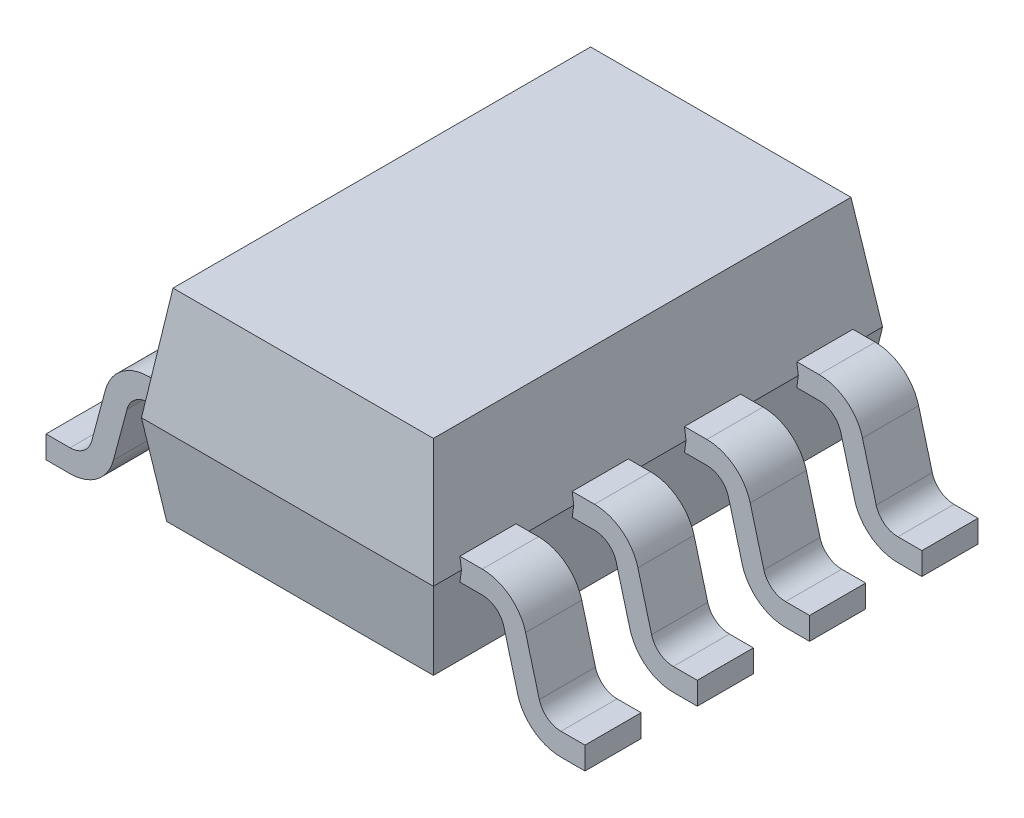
ISO-10303-21;
HEADER;
FILE_DESCRIPTION(('STEP AP214'),'2;1');
FILE_NAME('part.step','',(''),(''),'','','');
FILE_SCHEMA(('AUTOMOTIVE_DESIGN { 1 0 10303 214 1 1 1 1 }'));
ENDSEC;
DATA;
#1=APPLICATION_CONTEXT('core data for automotive mechanical design processes');
#2=APPLICATION_PROTOCOL_DEFINITION('international standard','automotive_design',2000,#1);
#3=PRODUCT_CONTEXT('',#1,'mechanical');
#4=PRODUCT('Part','Part','',(#3));
#5=PRODUCT_RELATED_PRODUCT_CATEGORY('part','',(#4));
#6=PRODUCT_DEFINITION_FORMATION('','',#4);
#7=PRODUCT_DEFINITION_CONTEXT('part definition',#1,'design');
#8=PRODUCT_DEFINITION('design','',#6,#7);
#9=PRODUCT_DEFINITION_SHAPE('','',#8);
#10=(LENGTH_UNIT() NAMED_UNIT(*) SI_UNIT(.MILLI.,.METRE.));
#11=(NAMED_UNIT(*) PLANE_ANGLE_UNIT() SI_UNIT($,.RADIAN.));
#12=(NAMED_UNIT(*) SI_UNIT($,.STERADIAN.) SOLID_ANGLE_UNIT());
#13=UNCERTAINTY_MEASURE_WITH_UNIT(LENGTH_MEASURE(1.E-05),#10,'distance_accuracy_value','');
#14=(GEOMETRIC_REPRESENTATION_CONTEXT(3) GLOBAL_UNCERTAINTY_ASSIGNED_CONTEXT((#13)) GLOBAL_UNIT_ASSIGNED_CONTEXT((#10,
#11,#12)) REPRESENTATION_CONTEXT('',''));
#15=CARTESIAN_POINT('',(0.,0.,0.));
#16=DIRECTION('',(0.,0.,1.));
#17=DIRECTION('',(1.,0.,0.));
#18=AXIS2_PLACEMENT_3D('',#15,#16,#17);
#19=CARTESIAN_POINT('',(0.357590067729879,0.55,0.125));
#20=DIRECTION('',(0.,1.,0.));
#21=DIRECTION('',(-1.,0.,0.));
#22=AXIS2_PLACEMENT_3D('',#19,#20,#21);
#23=PLANE('',#22);
#24=DIRECTION('',(1.,0.,0.));
#25=VECTOR('',#24,1.);
#26=CARTESIAN_POINT('',(0.357590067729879,0.55,0.125));
#27=LINE('',#26,#25);
#28=CARTESIAN_POINT('',(0.357590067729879,0.55,0.125));
#29=VERTEX_POINT('',#28);
#30=CARTESIAN_POINT('',(0.457027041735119,0.55,0.125));
#31=VERTEX_POINT('',#30);
#32=EDGE_CURVE('E1408',#29,#31,#27,.T.);
#33=ORIENTED_EDGE('',*,*,#32,.T.);
#34=DIRECTION('',(0.,0.,1.));
#35=VECTOR('',#34,1.);
#36=CARTESIAN_POINT('',(0.457027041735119,0.55,0.125));
#37=LINE('',#36,#35);
#38=CARTESIAN_POINT('',(0.45702704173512,0.55,-0.125));
#39=VERTEX_POINT('',#38);
#40=EDGE_CURVE('E1329',#31,#39,#37,.F.);
#41=ORIENTED_EDGE('',*,*,#40,.T.);
#42=DIRECTION('',(1.,0.,0.));
#43=VECTOR('',#42,1.);
#44=CARTESIAN_POINT('',(0.357590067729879,0.55,-0.125));
#45=LINE('',#44,#43);
#46=CARTESIAN_POINT('',(0.357590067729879,0.55,-0.125));
#47=VERTEX_POINT('',#46);
#48=EDGE_CURVE('E1354',#47,#39,#45,.T.);
#49=ORIENTED_EDGE('',*,*,#48,.F.);
#50=DIRECTION('',(0.,0.,-1.));
#51=VECTOR('',#50,1.);
#52=CARTESIAN_POINT('',(0.357590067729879,0.55,0.125));
#53=LINE('',#52,#51);
#54=EDGE_CURVE('E1478',#29,#47,#53,.T.);
#55=ORIENTED_EDGE('',*,*,#54,.F.);
#56=EDGE_LOOP('',(#33,#41,#49,#55));
#57=FACE_BOUND('',#56,.T.);
#58=ADVANCED_FACE('F30',(#57),#23,.T.);
#59=CARTESIAN_POINT('',(0.357590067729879,0.45,0.125));
#60=DIRECTION('',(0.,1.,0.));
#61=DIRECTION('',(-1.,0.,0.));
#62=AXIS2_PLACEMENT_3D('',#59,#60,#61);
#63=PLANE('',#62);
#64=DIRECTION('',(1.,0.,0.));
#65=VECTOR('',#64,1.);
#66=CARTESIAN_POINT('',(0.357590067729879,0.45,-0.125));
#67=LINE('',#66,#65);
#68=CARTESIAN_POINT('',(0.357590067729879,0.45,-0.125));
#69=VERTEX_POINT('',#68);
#70=CARTESIAN_POINT('',(0.457027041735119,0.45,-0.125));
#71=VERTEX_POINT('',#70);
#72=EDGE_CURVE('E1381',#69,#71,#67,.T.);
#73=ORIENTED_EDGE('',*,*,#72,.T.);
#74=DIRECTION('',(0.,0.,1.));
#75=VECTOR('',#74,1.);
#76=CARTESIAN_POINT('',(0.457027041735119,0.45,0.125));
#77=LINE('',#76,#75);
#78=CARTESIAN_POINT('',(0.457027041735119,0.45,0.125));
#79=VERTEX_POINT('',#78);
#80=EDGE_CURVE('E1318',#71,#79,#77,.T.);
#81=ORIENTED_EDGE('',*,*,#80,.T.);
#82=DIRECTION('',(1.,0.,0.));
#83=VECTOR('',#82,1.);
#84=CARTESIAN_POINT('',(0.357590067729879,0.45,0.125));
#85=LINE('',#84,#83);
#86=CARTESIAN_POINT('',(0.357590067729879,0.45,0.125));
#87=VERTEX_POINT('',#86);
#88=EDGE_CURVE('E1435',#87,#79,#85,.T.);
#89=ORIENTED_EDGE('',*,*,#88,.F.);
#90=DIRECTION('',(0.,0.,-1.));
#91=VECTOR('',#90,1.);
#92=CARTESIAN_POINT('',(0.357590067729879,0.45,0.125));
#93=LINE('',#92,#91);
#94=EDGE_CURVE('E1456',#87,#69,#93,.T.);
#95=ORIENTED_EDGE('',*,*,#94,.T.);
#96=EDGE_LOOP('',(#73,#81,#89,#95));
#97=FACE_BOUND('',#96,.T.);
#98=ADVANCED_FACE('F1591',(#97),#63,.F.);
#99=CARTESIAN_POINT('',(2.19318516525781,0.2,0.125));
#100=DIRECTION('',(0.,0.,1.));
#101=DIRECTION('',(1.,0.,0.));
#102=AXIS2_PLACEMENT_3D('',#99,#100,#101);
#103=PLANE('',#102);
#104=DIRECTION('',(0.139173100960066,-0.99026806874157,0.));
#105=VECTOR('',#104,1.);
#106=CARTESIAN_POINT('',(0.525109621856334,-0.0344327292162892,0.125));
#107=LINE('',#106,#105);
#108=CARTESIAN_POINT('',(0.45,0.5,0.125));
#109=VERTEX_POINT('',#108);
#110=EDGE_CURVE('E1321',#109,#79,#107,.T.);
#111=ORIENTED_EDGE('',*,*,#110,.F.);
#112=DIRECTION('',(-0.139173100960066,-0.99026806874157,0.));
#113=VECTOR('',#112,1.);
#114=CARTESIAN_POINT('',(0.442418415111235,0.446054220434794,0.125));
#115=LINE('',#114,#113);
#116=EDGE_CURVE('E1332',#109,#31,#115,.F.);
#117=ORIENTED_EDGE('',*,*,#116,.T.);
#118=ORIENTED_EDGE('',*,*,#32,.F.);
#119=CARTESIAN_POINT('',(0.357590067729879,0.35,0.125));
#120=DIRECTION('',(0.,0.,1.));
#121=DIRECTION('',(1.,0.,0.));
#122=AXIS2_PLACEMENT_3D('',#119,#120,#121);
#123=CIRCLE('',#122,0.2);
#124=CARTESIAN_POINT('',(0.164404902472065,0.401763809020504,0.125));
#125=VERTEX_POINT('',#124);
#126=EDGE_CURVE('E1411',#125,#29,#123,.F.);
#127=ORIENTED_EDGE('',*,*,#126,.F.);
#128=DIRECTION('',(0.258819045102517,0.965925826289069,0.));
#129=VECTOR('',#128,1.);
#130=CARTESIAN_POINT('',(0.103407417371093,0.174118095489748,0.125));
#131=LINE('',#130,#129);
#132=CARTESIAN_POINT('',(0.103407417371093,0.174118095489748,0.125));
#133=VERTEX_POINT('',#132);
#134=EDGE_CURVE('E1414',#133,#125,#131,.T.);
#135=ORIENTED_EDGE('',*,*,#134,.F.);
#136=CARTESIAN_POINT('',(0.00681483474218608,0.2,0.125));
#137=DIRECTION('',(0.,0.,1.));
#138=DIRECTION('',(1.,0.,0.));
#139=AXIS2_PLACEMENT_3D('',#136,#137,#138);
#140=CIRCLE('',#139,0.1);
#141=CARTESIAN_POINT('',(0.00681483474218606,0.1,0.125));
#142=VERTEX_POINT('',#141);
#143=EDGE_CURVE('E1417',#142,#133,#140,.T.);
#144=ORIENTED_EDGE('',*,*,#143,.F.);
#145=DIRECTION('',(1.,0.,0.));
#146=VECTOR('',#145,1.);
#147=CARTESIAN_POINT('',(-0.1,0.1,0.125));
#148=LINE('',#147,#146);
#149=CARTESIAN_POINT('',(-0.1,0.1,0.125));
#150=VERTEX_POINT('',#149);
#151=EDGE_CURVE('E1420',#150,#142,#148,.T.);
#152=ORIENTED_EDGE('',*,*,#151,.F.);
#153=DIRECTION('',(0.,1.,0.));
#154=VECTOR('',#153,1.);
#155=CARTESIAN_POINT('',(-0.1,0.,0.125));
#156=LINE('',#155,#154);
#157=CARTESIAN_POINT('',(-0.1,0.,0.125));
#158=VERTEX_POINT('',#157);
#159=EDGE_CURVE('E1423',#158,#150,#156,.T.);
#160=ORIENTED_EDGE('',*,*,#159,.F.);
#161=DIRECTION('',(1.,0.,0.));
#162=VECTOR('',#161,1.);
#163=CARTESIAN_POINT('',(-0.1,0.,0.125));
#164=LINE('',#163,#162);
#165=CARTESIAN_POINT('',(0.00681483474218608,0.,0.125));
#166=VERTEX_POINT('',#165);
#167=EDGE_CURVE('E1426',#158,#166,#164,.T.);
#168=ORIENTED_EDGE('',*,*,#167,.T.);
#169=CARTESIAN_POINT('',(0.00681483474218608,0.2,0.125));
#170=DIRECTION('',(0.,0.,1.));
#171=DIRECTION('',(1.,0.,0.));
#172=AXIS2_PLACEMENT_3D('',#169,#170,#171);
#173=CIRCLE('',#172,0.2);
#174=CARTESIAN_POINT('',(0.2,0.148236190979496,0.125));
#175=VERTEX_POINT('',#174);
#176=EDGE_CURVE('E1428',#166,#175,#173,.T.);
#177=ORIENTED_EDGE('',*,*,#176,.T.);
#178=DIRECTION('',(0.258819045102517,0.965925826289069,0.));
#179=VECTOR('',#178,1.);
#180=CARTESIAN_POINT('',(0.2,0.148236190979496,0.125));
#181=LINE('',#180,#179);
#182=CARTESIAN_POINT('',(0.260997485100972,0.375881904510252,0.125));
#183=VERTEX_POINT('',#182);
#184=EDGE_CURVE('E1430',#175,#183,#181,.T.);
#185=ORIENTED_EDGE('',*,*,#184,.T.);
#186=CARTESIAN_POINT('',(0.357590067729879,0.35,0.125));
#187=DIRECTION('',(0.,0.,-1.));
#188=DIRECTION('',(-1.,0.,0.));
#189=AXIS2_PLACEMENT_3D('',#186,#187,#188);
#190=CIRCLE('',#189,0.1);
#191=EDGE_CURVE('E1432',#183,#87,#190,.T.);
#192=ORIENTED_EDGE('',*,*,#191,.T.);
#193=ORIENTED_EDGE('',*,*,#88,.T.);
#194=EDGE_LOOP('',(#111,#117,#118,#127,#135,#144,#152,#160,#168,#177,#185,#192,#193));
#195=FACE_BOUND('',#194,.T.);
#196=ADVANCED_FACE('F1598',(#195),#103,.T.);
#197=CARTESIAN_POINT('',(2.19318516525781,0.2,-0.125));
#198=DIRECTION('',(0.,0.,1.));
#199=DIRECTION('',(1.,0.,0.));
#200=AXIS2_PLACEMENT_3D('',#197,#198,#199);
#201=PLANE('',#200);
#202=DIRECTION('',(-0.139173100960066,-0.99026806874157,0.));
#203=VECTOR('',#202,1.);
#204=CARTESIAN_POINT('',(0.442418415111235,0.446054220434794,-0.125));
#205=LINE('',#204,#203);
#206=CARTESIAN_POINT('',(0.45,0.5,-0.125));
#207=VERTEX_POINT('',#206);
#208=EDGE_CURVE('E1502',#207,#39,#205,.F.);
#209=ORIENTED_EDGE('',*,*,#208,.F.);
#210=DIRECTION('',(0.139173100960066,-0.99026806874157,0.));
#211=VECTOR('',#210,1.);
#212=CARTESIAN_POINT('',(0.525109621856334,-0.0344327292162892,-0.125));
#213=LINE('',#212,#211);
#214=EDGE_CURVE('E1499',#207,#71,#213,.T.);
#215=ORIENTED_EDGE('',*,*,#214,.T.);
#216=ORIENTED_EDGE('',*,*,#72,.F.);
#217=CARTESIAN_POINT('',(0.357590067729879,0.35,-0.125));
#218=DIRECTION('',(0.,0.,-1.));
#219=DIRECTION('',(-1.,0.,0.));
#220=AXIS2_PLACEMENT_3D('',#217,#218,#219);
#221=CIRCLE('',#220,0.1);
#222=CARTESIAN_POINT('',(0.260997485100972,0.375881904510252,-0.125));
#223=VERTEX_POINT('',#222);
#224=EDGE_CURVE('E1378',#223,#69,#221,.T.);
#225=ORIENTED_EDGE('',*,*,#224,.F.);
#226=DIRECTION('',(0.258819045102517,0.965925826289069,0.));
#227=VECTOR('',#226,1.);
#228=CARTESIAN_POINT('',(0.2,0.148236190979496,-0.125));
#229=LINE('',#228,#227);
#230=CARTESIAN_POINT('',(0.2,0.148236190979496,-0.125));
#231=VERTEX_POINT('',#230);
#232=EDGE_CURVE('E1376',#231,#223,#229,.T.);
#233=ORIENTED_EDGE('',*,*,#232,.F.);
#234=CARTESIAN_POINT('',(0.00681483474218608,0.2,-0.125));
#235=DIRECTION('',(0.,0.,1.));
#236=DIRECTION('',(1.,0.,0.));
#237=AXIS2_PLACEMENT_3D('',#234,#235,#236);
#238=CIRCLE('',#237,0.2);
#239=CARTESIAN_POINT('',(0.00681483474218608,0.,-0.125));
#240=VERTEX_POINT('',#239);
#241=EDGE_CURVE('E1374',#240,#231,#238,.T.);
#242=ORIENTED_EDGE('',*,*,#241,.F.);
#243=DIRECTION('',(1.,0.,0.));
#244=VECTOR('',#243,1.);
#245=CARTESIAN_POINT('',(-0.1,0.,-0.125));
#246=LINE('',#245,#244);
#247=CARTESIAN_POINT('',(-0.1,0.,-0.125));
#248=VERTEX_POINT('',#247);
#249=EDGE_CURVE('E1372',#248,#240,#246,.T.);
#250=ORIENTED_EDGE('',*,*,#249,.F.);
#251=DIRECTION('',(0.,1.,0.));
#252=VECTOR('',#251,1.);
#253=CARTESIAN_POINT('',(-0.1,0.,-0.125));
#254=LINE('',#253,#252);
#255=CARTESIAN_POINT('',(-0.1,0.1,-0.125));
#256=VERTEX_POINT('',#255);
#257=EDGE_CURVE('E1369',#248,#256,#254,.T.);
#258=ORIENTED_EDGE('',*,*,#257,.T.);
#259=DIRECTION('',(1.,0.,0.));
#260=VECTOR('',#259,1.);
#261=CARTESIAN_POINT('',(-0.1,0.1,-0.125));
#262=LINE('',#261,#260);
#263=CARTESIAN_POINT('',(0.00681483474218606,0.1,-0.125));
#264=VERTEX_POINT('',#263);
#265=EDGE_CURVE('E1366',#256,#264,#262,.T.);
#266=ORIENTED_EDGE('',*,*,#265,.T.);
#267=CARTESIAN_POINT('',(0.00681483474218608,0.2,-0.125));
#268=DIRECTION('',(0.,0.,1.));
#269=DIRECTION('',(1.,0.,0.));
#270=AXIS2_PLACEMENT_3D('',#267,#268,#269);
#271=CIRCLE('',#270,0.1);
#272=CARTESIAN_POINT('',(0.103407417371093,0.174118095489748,-0.125));
#273=VERTEX_POINT('',#272);
#274=EDGE_CURVE('E1363',#264,#273,#271,.T.);
#275=ORIENTED_EDGE('',*,*,#274,.T.);
#276=DIRECTION('',(0.258819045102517,0.965925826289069,0.));
#277=VECTOR('',#276,1.);
#278=CARTESIAN_POINT('',(0.103407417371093,0.174118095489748,-0.125));
#279=LINE('',#278,#277);
#280=CARTESIAN_POINT('',(0.164404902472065,0.401763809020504,-0.125));
#281=VERTEX_POINT('',#280);
#282=EDGE_CURVE('E1360',#273,#281,#279,.T.);
#283=ORIENTED_EDGE('',*,*,#282,.T.);
#284=CARTESIAN_POINT('',(0.357590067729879,0.35,-0.125));
#285=DIRECTION('',(0.,0.,1.));
#286=DIRECTION('',(1.,0.,0.));
#287=AXIS2_PLACEMENT_3D('',#284,#285,#286);
#288=CIRCLE('',#287,0.2);
#289=EDGE_CURVE('E1357',#281,#47,#288,.F.);
#290=ORIENTED_EDGE('',*,*,#289,.T.);
#291=ORIENTED_EDGE('',*,*,#48,.T.);
#292=EDGE_LOOP('',(#209,#215,#216,#225,#233,#242,#250,#258,#266,#275,#283,#290,#291));
#293=FACE_BOUND('',#292,.T.);
#294=ADVANCED_FACE('F1794',(#293),#201,.F.);
#295=CARTESIAN_POINT('',(0.357590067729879,0.35,0.125));
#296=DIRECTION('',(0.,0.,-1.));
#297=DIRECTION('',(-1.,0.,0.));
#298=AXIS2_PLACEMENT_3D('',#295,#296,#297);
#299=CYLINDRICAL_SURFACE('',#298,0.2);
#300=ORIENTED_EDGE('',*,*,#289,.F.);
#301=DIRECTION('',(0.,0.,-1.));
#302=VECTOR('',#301,1.);
#303=CARTESIAN_POINT('',(0.164404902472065,0.401763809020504,0.125));
#304=LINE('',#303,#302);
#305=EDGE_CURVE('E1476',#125,#281,#304,.T.);
#306=ORIENTED_EDGE('',*,*,#305,.F.);
#307=ORIENTED_EDGE('',*,*,#126,.T.);
#308=ORIENTED_EDGE('',*,*,#54,.T.);
#309=EDGE_LOOP('',(#300,#306,#307,#308));
#310=FACE_BOUND('',#309,.T.);
#311=ADVANCED_FACE('F1835',(#310),#299,.T.);
#312=CARTESIAN_POINT('',(0.103407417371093,0.174118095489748,0.125));
#313=DIRECTION('',(-0.965925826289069,0.258819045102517,0.));
#314=DIRECTION('',(-0.258819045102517,-0.965925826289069,0.));
#315=AXIS2_PLACEMENT_3D('',#312,#313,#314);
#316=PLANE('',#315);
#317=ORIENTED_EDGE('',*,*,#282,.F.);
#318=DIRECTION('',(0.,0.,-1.));
#319=VECTOR('',#318,1.);
#320=CARTESIAN_POINT('',(0.103407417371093,0.174118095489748,0.125));
#321=LINE('',#320,#319);
#322=EDGE_CURVE('E1474',#133,#273,#321,.T.);
#323=ORIENTED_EDGE('',*,*,#322,.F.);
#324=ORIENTED_EDGE('',*,*,#134,.T.);
#325=ORIENTED_EDGE('',*,*,#305,.T.);
#326=EDGE_LOOP('',(#317,#323,#324,#325));
#327=FACE_BOUND('',#326,.T.);
#328=ADVANCED_FACE('F1831',(#327),#316,.T.);
#329=CARTESIAN_POINT('',(0.00681483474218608,0.2,0.125));
#330=DIRECTION('',(0.,0.,-1.));
#331=DIRECTION('',(-1.,0.,0.));
#332=AXIS2_PLACEMENT_3D('',#329,#330,#331);
#333=CYLINDRICAL_SURFACE('',#332,0.1);
#334=ORIENTED_EDGE('',*,*,#274,.F.);
#335=DIRECTION('',(0.,0.,-1.));
#336=VECTOR('',#335,1.);
#337=CARTESIAN_POINT('',(0.00681483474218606,0.1,0.125));
#338=LINE('',#337,#336);
#339=EDGE_CURVE('E1472',#142,#264,#338,.T.);
#340=ORIENTED_EDGE('',*,*,#339,.F.);
#341=ORIENTED_EDGE('',*,*,#143,.T.);
#342=ORIENTED_EDGE('',*,*,#322,.T.);
#343=EDGE_LOOP('',(#334,#340,#341,#342));
#344=FACE_BOUND('',#343,.T.);
#345=ADVANCED_FACE('F1827',(#344),#333,.F.);
#346=CARTESIAN_POINT('',(-0.1,0.1,0.125));
#347=DIRECTION('',(0.,1.,0.));
#348=DIRECTION('',(0.,0.,1.));
#349=AXIS2_PLACEMENT_3D('',#346,#347,#348);
#350=PLANE('',#349);
#351=ORIENTED_EDGE('',*,*,#265,.F.);
#352=DIRECTION('',(0.,0.,-1.));
#353=VECTOR('',#352,1.);
#354=CARTESIAN_POINT('',(-0.1,0.1,0.125));
#355=LINE('',#354,#353);
#356=EDGE_CURVE('E1470',#150,#256,#355,.T.);
#357=ORIENTED_EDGE('',*,*,#356,.F.);
#358=ORIENTED_EDGE('',*,*,#151,.T.);
#359=ORIENTED_EDGE('',*,*,#339,.T.);
#360=EDGE_LOOP('',(#351,#357,#358,#359));
#361=FACE_BOUND('',#360,.T.);
#362=ADVANCED_FACE('F1823',(#361),#350,.T.);
#363=CARTESIAN_POINT('',(-0.1,0.,0.125));
#364=DIRECTION('',(-1.,0.,0.));
#365=DIRECTION('',(0.,0.,1.));
#366=AXIS2_PLACEMENT_3D('',#363,#364,#365);
#367=PLANE('',#366);
#368=ORIENTED_EDGE('',*,*,#257,.F.);
#369=DIRECTION('',(0.,0.,-1.));
#370=VECTOR('',#369,1.);
#371=CARTESIAN_POINT('',(-0.1,0.,0.125));
#372=LINE('',#371,#370);
#373=EDGE_CURVE('E1468',#158,#248,#372,.T.);
#374=ORIENTED_EDGE('',*,*,#373,.F.);
#375=ORIENTED_EDGE('',*,*,#159,.T.);
#376=ORIENTED_EDGE('',*,*,#356,.T.);
#377=EDGE_LOOP('',(#368,#374,#375,#376));
#378=FACE_BOUND('',#377,.T.);
#379=ADVANCED_FACE('F1819',(#378),#367,.T.);
#380=CARTESIAN_POINT('',(-0.1,0.,0.125));
#381=DIRECTION('',(0.,1.,0.));
#382=DIRECTION('',(0.,0.,1.));
#383=AXIS2_PLACEMENT_3D('',#380,#381,#382);
#384=PLANE('',#383);
#385=ORIENTED_EDGE('',*,*,#249,.T.);
#386=DIRECTION('',(0.,0.,-1.));
#387=VECTOR('',#386,1.);
#388=CARTESIAN_POINT('',(0.00681483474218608,0.,0.125));
#389=LINE('',#388,#387);
#390=EDGE_CURVE('E1465',#166,#240,#389,.T.);
#391=ORIENTED_EDGE('',*,*,#390,.F.);
#392=ORIENTED_EDGE('',*,*,#167,.F.);
#393=ORIENTED_EDGE('',*,*,#373,.T.);
#394=EDGE_LOOP('',(#385,#391,#392,#393));
#395=FACE_BOUND('',#394,.T.);
#396=ADVANCED_FACE('F1815',(#395),#384,.F.);
#397=CARTESIAN_POINT('',(0.00681483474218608,0.2,0.125));
#398=DIRECTION('',(0.,0.,-1.));
#399=DIRECTION('',(-1.,0.,0.));
#400=AXIS2_PLACEMENT_3D('',#397,#398,#399);
#401=CYLINDRICAL_SURFACE('',#400,0.2);
#402=ORIENTED_EDGE('',*,*,#241,.T.);
#403=DIRECTION('',(0.,0.,-1.));
#404=VECTOR('',#403,1.);
#405=CARTESIAN_POINT('',(0.2,0.148236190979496,0.125));
#406=LINE('',#405,#404);
#407=EDGE_CURVE('E1462',#175,#231,#406,.T.);
#408=ORIENTED_EDGE('',*,*,#407,.F.);
#409=ORIENTED_EDGE('',*,*,#176,.F.);
#410=ORIENTED_EDGE('',*,*,#390,.T.);
#411=EDGE_LOOP('',(#402,#408,#409,#410));
#412=FACE_BOUND('',#411,.T.);
#413=ADVANCED_FACE('F1811',(#412),#401,.T.);
#414=CARTESIAN_POINT('',(0.2,0.148236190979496,0.125));
#415=DIRECTION('',(-0.965925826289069,0.258819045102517,0.));
#416=DIRECTION('',(-0.258819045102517,-0.965925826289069,0.));
#417=AXIS2_PLACEMENT_3D('',#414,#415,#416);
#418=PLANE('',#417);
#419=ORIENTED_EDGE('',*,*,#232,.T.);
#420=DIRECTION('',(0.,0.,-1.));
#421=VECTOR('',#420,1.);
#422=CARTESIAN_POINT('',(0.260997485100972,0.375881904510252,0.125));
#423=LINE('',#422,#421);
#424=EDGE_CURVE('E1459',#183,#223,#423,.T.);
#425=ORIENTED_EDGE('',*,*,#424,.F.);
#426=ORIENTED_EDGE('',*,*,#184,.F.);
#427=ORIENTED_EDGE('',*,*,#407,.T.);
#428=EDGE_LOOP('',(#419,#425,#426,#427));
#429=FACE_BOUND('',#428,.T.);
#430=ADVANCED_FACE('F1806',(#429),#418,.F.);
#431=CARTESIAN_POINT('',(0.357590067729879,0.35,0.125));
#432=DIRECTION('',(0.,0.,-1.));
#433=DIRECTION('',(-1.,0.,0.));
#434=AXIS2_PLACEMENT_3D('',#431,#432,#433);
#435=CYLINDRICAL_SURFACE('',#434,0.1);
#436=ORIENTED_EDGE('',*,*,#224,.T.);
#437=ORIENTED_EDGE('',*,*,#94,.F.);
#438=ORIENTED_EDGE('',*,*,#191,.F.);
#439=ORIENTED_EDGE('',*,*,#424,.T.);
#440=EDGE_LOOP('',(#436,#437,#438,#439));
#441=FACE_BOUND('',#440,.T.);
#442=ADVANCED_FACE('F1800',(#441),#435,.F.);
#443=CARTESIAN_POINT('',(0.45,0.5,-0.25));
#444=DIRECTION('',(-0.99026806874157,0.139173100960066,0.));
#445=DIRECTION('',(-0.139173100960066,-0.99026806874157,0.));
#446=AXIS2_PLACEMENT_3D('',#443,#444,#445);
#447=PLANE('',#446);
#448=DIRECTION('',(0.,0.,-1.));
#449=VECTOR('',#448,1.);
#450=CARTESIAN_POINT('',(0.457027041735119,0.55,-0.25));
#451=LINE('',#450,#449);
#452=CARTESIAN_POINT('',(0.457027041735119,0.55,1.375));
#453=VERTEX_POINT('',#452);
#454=CARTESIAN_POINT('',(0.457027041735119,0.55,1.625));
#455=VERTEX_POINT('',#454);
#456=EDGE_CURVE('E891',#453,#455,#451,.F.);
#457=ORIENTED_EDGE('',*,*,#456,.T.);
#458=DIRECTION('',(0.139173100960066,0.99026806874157,0.));
#459=VECTOR('',#458,1.);
#460=CARTESIAN_POINT('',(0.45,0.5,1.625));
#461=LINE('',#460,#459);
#462=CARTESIAN_POINT('',(0.45,0.5,1.625));
#463=VERTEX_POINT('',#462);
#464=EDGE_CURVE('E885',#455,#463,#461,.F.);
#465=ORIENTED_EDGE('',*,*,#464,.T.);
#466=DIRECTION('',(0.,0.,1.));
#467=VECTOR('',#466,1.);
#468=CARTESIAN_POINT('',(0.45,0.5,-0.25));
#469=LINE('',#468,#467);
#470=CARTESIAN_POINT('',(0.45,0.5,1.75));
#471=VERTEX_POINT('',#470);
#472=EDGE_CURVE('E1255',#463,#471,#469,.T.);
#473=ORIENTED_EDGE('',*,*,#472,.T.);
#474=DIRECTION('',(-0.137844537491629,-0.980814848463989,0.137844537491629));
#475=VECTOR('',#474,1.);
#476=CARTESIAN_POINT('',(0.45,0.5,1.75));
#477=LINE('',#476,#475);
#478=CARTESIAN_POINT('',(0.520270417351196,1.,1.6797295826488));
#479=VERTEX_POINT('',#478);
#480=EDGE_CURVE('E1292',#479,#471,#477,.T.);
#481=ORIENTED_EDGE('',*,*,#480,.F.);
#482=DIRECTION('',(0.,0.,-1.));
#483=VECTOR('',#482,1.);
#484=CARTESIAN_POINT('',(0.520270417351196,1.,-0.25));
#485=LINE('',#484,#483);
#486=CARTESIAN_POINT('',(0.520270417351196,1.,-0.179729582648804));
#487=VERTEX_POINT('',#486);
#488=EDGE_CURVE('E1291',#487,#479,#485,.F.);
#489=ORIENTED_EDGE('',*,*,#488,.F.);
#490=DIRECTION('',(-0.137844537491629,-0.980814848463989,-0.137844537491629));
#491=VECTOR('',#490,1.);
#492=CARTESIAN_POINT('',(0.45,0.5,-0.25));
#493=LINE('',#492,#491);
#494=CARTESIAN_POINT('',(0.45,0.5,-0.25));
#495=VERTEX_POINT('',#494);
#496=EDGE_CURVE('E1297',#487,#495,#493,.T.);
#497=ORIENTED_EDGE('',*,*,#496,.T.);
#498=EDGE_CURVE('E1276',#495,#207,#469,.T.);
#499=ORIENTED_EDGE('',*,*,#498,.T.);
#500=ORIENTED_EDGE('',*,*,#208,.T.);
#501=ORIENTED_EDGE('',*,*,#40,.F.);
#502=ORIENTED_EDGE('',*,*,#116,.F.);
#503=CARTESIAN_POINT('',(0.45,0.5,0.375));
#504=VERTEX_POINT('',#503);
#505=EDGE_CURVE('E1280',#109,#504,#469,.T.);
#506=ORIENTED_EDGE('',*,*,#505,.T.);
#507=DIRECTION('',(0.139173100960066,0.99026806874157,0.));
#508=VECTOR('',#507,1.);
#509=CARTESIAN_POINT('',(0.45,0.5,0.375));
#510=LINE('',#509,#508);
#511=CARTESIAN_POINT('',(0.457027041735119,0.55,0.375));
#512=VERTEX_POINT('',#511);
#513=EDGE_CURVE('E1236',#512,#504,#510,.F.);
#514=ORIENTED_EDGE('',*,*,#513,.F.);
#515=DIRECTION('',(0.,0.,-1.));
#516=VECTOR('',#515,1.);
#517=CARTESIAN_POINT('',(0.457027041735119,0.55,-0.25));
#518=LINE('',#517,#516);
#519=CARTESIAN_POINT('',(0.457027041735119,0.55,0.625));
#520=VERTEX_POINT('',#519);
#521=EDGE_CURVE('E1249',#512,#520,#518,.F.);
#522=ORIENTED_EDGE('',*,*,#521,.T.);
#523=DIRECTION('',(0.139173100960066,0.99026806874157,0.));
#524=VECTOR('',#523,1.);
#525=CARTESIAN_POINT('',(0.45,0.5,0.625));
#526=LINE('',#525,#524);
#527=CARTESIAN_POINT('',(0.45,0.5,0.625));
#528=VERTEX_POINT('',#527);
#529=EDGE_CURVE('E1243',#520,#528,#526,.F.);
#530=ORIENTED_EDGE('',*,*,#529,.T.);
#531=CARTESIAN_POINT('',(0.45,0.5,0.875));
#532=VERTEX_POINT('',#531);
#533=EDGE_CURVE('E1760',#528,#532,#469,.T.);
#534=ORIENTED_EDGE('',*,*,#533,.T.);
#535=DIRECTION('',(0.139173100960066,0.99026806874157,0.));
#536=VECTOR('',#535,1.);
#537=CARTESIAN_POINT('',(0.45,0.5,0.875));
#538=LINE('',#537,#536);
#539=CARTESIAN_POINT('',(0.457027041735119,0.55,0.875));
#540=VERTEX_POINT('',#539);
#541=EDGE_CURVE('E1057',#540,#532,#538,.F.);
#542=ORIENTED_EDGE('',*,*,#541,.F.);
#543=DIRECTION('',(0.,0.,-1.));
#544=VECTOR('',#543,1.);
#545=CARTESIAN_POINT('',(0.457027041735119,0.55,-0.25));
#546=LINE('',#545,#544);
#547=CARTESIAN_POINT('',(0.457027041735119,0.55,1.125));
#548=VERTEX_POINT('',#547);
#549=EDGE_CURVE('E1070',#540,#548,#546,.F.);
#550=ORIENTED_EDGE('',*,*,#549,.T.);
#551=DIRECTION('',(0.139173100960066,0.99026806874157,0.));
#552=VECTOR('',#551,1.);
#553=CARTESIAN_POINT('',(0.45,0.5,1.125));
#554=LINE('',#553,#552);
#555=CARTESIAN_POINT('',(0.45,0.5,1.125));
#556=VERTEX_POINT('',#555);
#557=EDGE_CURVE('E1064',#548,#556,#554,.F.);
#558=ORIENTED_EDGE('',*,*,#557,.T.);
#559=CARTESIAN_POINT('',(0.45,0.5,1.375));
#560=VERTEX_POINT('',#559);
#561=EDGE_CURVE('E1762',#556,#560,#469,.T.);
#562=ORIENTED_EDGE('',*,*,#561,.T.);
#563=DIRECTION('',(0.139173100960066,0.99026806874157,0.));
#564=VECTOR('',#563,1.);
#565=CARTESIAN_POINT('',(0.45,0.5,1.375));
#566=LINE('',#565,#564);
#567=EDGE_CURVE('E45',#453,#560,#566,.F.);
#568=ORIENTED_EDGE('',*,*,#567,.F.);
#569=EDGE_LOOP('',(#457,#465,#473,#481,#489,#497,#499,#500,#501,#502,#506,#514,#522,#530,#534,
#542,#550,#558,#562,#568));
#570=FACE_BOUND('',#569,.T.);
#571=ADVANCED_FACE('F1756',(#570),#447,.T.);
#572=CARTESIAN_POINT('',(0.45,0.5,1.75));
#573=DIRECTION('',(0.,0.139173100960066,0.99026806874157));
#574=DIRECTION('',(0.,-0.99026806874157,0.139173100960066));
#575=AXIS2_PLACEMENT_3D('',#572,#573,#574);
#576=PLANE('',#575);
#577=DIRECTION('',(1.,0.,0.));
#578=VECTOR('',#577,1.);
#579=CARTESIAN_POINT('',(0.45,0.5,1.75));
#580=LINE('',#579,#578);
#581=CARTESIAN_POINT('',(1.75,0.5,1.75));
#582=VERTEX_POINT('',#581);
#583=EDGE_CURVE('E1279',#471,#582,#580,.T.);
#584=ORIENTED_EDGE('',*,*,#583,.T.);
#585=DIRECTION('',(0.137844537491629,-0.980814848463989,0.137844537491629));
#586=VECTOR('',#585,1.);
#587=CARTESIAN_POINT('',(1.71199776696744,0.770399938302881,1.71199776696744));
#588=LINE('',#587,#586);
#589=CARTESIAN_POINT('',(1.6797295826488,1.,1.6797295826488));
#590=VERTEX_POINT('',#589);
#591=EDGE_CURVE('E1296',#590,#582,#588,.T.);
#592=ORIENTED_EDGE('',*,*,#591,.F.);
#593=DIRECTION('',(-1.,0.,0.));
#594=VECTOR('',#593,1.);
#595=CARTESIAN_POINT('',(0.45,1.,1.6797295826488));
#596=LINE('',#595,#594);
#597=EDGE_CURVE('E1308',#479,#590,#596,.F.);
#598=ORIENTED_EDGE('',*,*,#597,.F.);
#599=ORIENTED_EDGE('',*,*,#480,.T.);
#600=EDGE_LOOP('',(#584,#592,#598,#599));
#601=FACE_BOUND('',#600,.T.);
#602=ADVANCED_FACE('F1779',(#601),#576,.T.);
#603=CARTESIAN_POINT('',(1.75,0.5,-0.25));
#604=DIRECTION('',(0.99026806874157,0.139173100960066,0.));
#605=DIRECTION('',(-0.139173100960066,0.99026806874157,0.));
#606=AXIS2_PLACEMENT_3D('',#603,#604,#605);
#607=PLANE('',#606);
#608=DIRECTION('',(0.,0.,-1.));
#609=VECTOR('',#608,1.);
#610=CARTESIAN_POINT('',(1.75,0.5,-0.25));
#611=LINE('',#610,#609);
#612=CARTESIAN_POINT('',(1.75,0.5,1.625));
#613=VERTEX_POINT('',#612);
#614=EDGE_CURVE('E1284',#582,#613,#611,.T.);
#615=ORIENTED_EDGE('',*,*,#614,.T.);
#616=DIRECTION('',(0.139173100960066,-0.99026806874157,0.));
#617=VECTOR('',#616,1.);
#618=CARTESIAN_POINT('',(1.75,0.5,1.625));
#619=LINE('',#618,#617);
#620=CARTESIAN_POINT('',(1.74297295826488,0.55,1.625));
#621=VERTEX_POINT('',#620);
#622=EDGE_CURVE('E880',#613,#621,#619,.F.);
#623=ORIENTED_EDGE('',*,*,#622,.T.);
#624=DIRECTION('',(0.,0.,1.));
#625=VECTOR('',#624,1.);
#626=CARTESIAN_POINT('',(1.74297295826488,0.55,-0.25));
#627=LINE('',#626,#625);
#628=CARTESIAN_POINT('',(1.74297295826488,0.55,1.375));
#629=VERTEX_POINT('',#628);
#630=EDGE_CURVE('E11',#621,#629,#627,.F.);
#631=ORIENTED_EDGE('',*,*,#630,.T.);
#632=DIRECTION('',(0.139173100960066,-0.99026806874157,0.));
#633=VECTOR('',#632,1.);
#634=CARTESIAN_POINT('',(1.75,0.5,1.375));
#635=LINE('',#634,#633);
#636=CARTESIAN_POINT('',(1.75,0.5,1.375));
#637=VERTEX_POINT('',#636);
#638=EDGE_CURVE('E719',#637,#629,#635,.F.);
#639=ORIENTED_EDGE('',*,*,#638,.F.);
#640=CARTESIAN_POINT('',(1.75,0.5,1.125));
#641=VERTEX_POINT('',#640);
#642=EDGE_CURVE('E1288',#637,#641,#611,.T.);
#643=ORIENTED_EDGE('',*,*,#642,.T.);
#644=DIRECTION('',(0.139173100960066,-0.99026806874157,0.));
#645=VECTOR('',#644,1.);
#646=CARTESIAN_POINT('',(1.75,0.5,1.125));
#647=LINE('',#646,#645);
#648=CARTESIAN_POINT('',(1.74297295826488,0.55,1.125));
#649=VERTEX_POINT('',#648);
#650=EDGE_CURVE('E1059',#641,#649,#647,.F.);
#651=ORIENTED_EDGE('',*,*,#650,.T.);
#652=DIRECTION('',(0.,0.,1.));
#653=VECTOR('',#652,1.);
#654=CARTESIAN_POINT('',(1.74297295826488,0.55,-0.25));
#655=LINE('',#654,#653);
#656=CARTESIAN_POINT('',(1.74297295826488,0.55,0.875));
#657=VERTEX_POINT('',#656);
#658=EDGE_CURVE('E1523',#649,#657,#655,.F.);
#659=ORIENTED_EDGE('',*,*,#658,.T.);
#660=DIRECTION('',(0.139173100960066,-0.99026806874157,0.));
#661=VECTOR('',#660,1.);
#662=CARTESIAN_POINT('',(1.75,0.5,0.875));
#663=LINE('',#662,#661);
#664=CARTESIAN_POINT('',(1.75,0.5,0.875));
#665=VERTEX_POINT('',#664);
#666=EDGE_CURVE('E1052',#665,#657,#663,.F.);
#667=ORIENTED_EDGE('',*,*,#666,.F.);
#668=CARTESIAN_POINT('',(1.75,0.5,0.625));
#669=VERTEX_POINT('',#668);
#670=EDGE_CURVE('E1671',#665,#669,#611,.T.);
#671=ORIENTED_EDGE('',*,*,#670,.T.);
#672=DIRECTION('',(0.139173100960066,-0.99026806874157,0.));
#673=VECTOR('',#672,1.);
#674=CARTESIAN_POINT('',(1.75,0.5,0.625));
#675=LINE('',#674,#673);
#676=CARTESIAN_POINT('',(1.74297295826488,0.55,0.625));
#677=VERTEX_POINT('',#676);
#678=EDGE_CURVE('E1238',#669,#677,#675,.F.);
#679=ORIENTED_EDGE('',*,*,#678,.T.);
#680=DIRECTION('',(0.,0.,1.));
#681=VECTOR('',#680,1.);
#682=CARTESIAN_POINT('',(1.74297295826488,0.55,-0.25));
#683=LINE('',#682,#681);
#684=CARTESIAN_POINT('',(1.74297295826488,0.55,0.375));
#685=VERTEX_POINT('',#684);
#686=EDGE_CURVE('E1512',#677,#685,#683,.F.);
#687=ORIENTED_EDGE('',*,*,#686,.T.);
#688=DIRECTION('',(0.139173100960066,-0.99026806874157,0.));
#689=VECTOR('',#688,1.);
#690=CARTESIAN_POINT('',(1.75,0.5,0.375));
#691=LINE('',#690,#689);
#692=CARTESIAN_POINT('',(1.75,0.5,0.375));
#693=VERTEX_POINT('',#692);
#694=EDGE_CURVE('E1231',#693,#685,#691,.F.);
#695=ORIENTED_EDGE('',*,*,#694,.F.);
#696=CARTESIAN_POINT('',(1.75,0.5,0.125));
#697=VERTEX_POINT('',#696);
#698=EDGE_CURVE('E1627',#693,#697,#611,.T.);
#699=ORIENTED_EDGE('',*,*,#698,.T.);
#700=DIRECTION('',(-0.139173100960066,0.99026806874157,0.));
#701=VECTOR('',#700,1.);
#702=CARTESIAN_POINT('',(1.79992972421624,0.144731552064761,0.125));
#703=LINE('',#702,#701);
#704=CARTESIAN_POINT('',(1.74297295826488,0.55,0.125));
#705=VERTEX_POINT('',#704);
#706=EDGE_CURVE('E1326',#705,#697,#703,.F.);
#707=ORIENTED_EDGE('',*,*,#706,.F.);
#708=DIRECTION('',(0.,0.,-1.));
#709=VECTOR('',#708,1.);
#710=CARTESIAN_POINT('',(1.74297295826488,0.55,0.125));
#711=LINE('',#710,#709);
#712=CARTESIAN_POINT('',(1.74297295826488,0.55,-0.125));
#713=VERTEX_POINT('',#712);
#714=EDGE_CURVE('E1323',#713,#705,#711,.F.);
#715=ORIENTED_EDGE('',*,*,#714,.F.);
#716=DIRECTION('',(-0.139173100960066,0.99026806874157,0.));
#717=VECTOR('',#716,1.);
#718=CARTESIAN_POINT('',(1.79992972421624,0.144731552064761,-0.125));
#719=LINE('',#718,#717);
#720=CARTESIAN_POINT('',(1.75,0.5,-0.125));
#721=VERTEX_POINT('',#720);
#722=EDGE_CURVE('E1496',#713,#721,#719,.F.);
#723=ORIENTED_EDGE('',*,*,#722,.T.);
#724=CARTESIAN_POINT('',(1.75,0.5,-0.25));
#725=VERTEX_POINT('',#724);
#726=EDGE_CURVE('E1283',#721,#725,#611,.T.);
#727=ORIENTED_EDGE('',*,*,#726,.T.);
#728=DIRECTION('',(0.137844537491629,-0.980814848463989,-0.137844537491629));
#729=VECTOR('',#728,1.);
#730=CARTESIAN_POINT('',(1.72529854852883,0.675759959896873,-0.225298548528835));
#731=LINE('',#730,#729);
#732=CARTESIAN_POINT('',(1.6797295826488,1.,-0.179729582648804));
#733=VERTEX_POINT('',#732);
#734=EDGE_CURVE('E1300',#733,#725,#731,.T.);
#735=ORIENTED_EDGE('',*,*,#734,.F.);
#736=DIRECTION('',(0.,0.,1.));
#737=VECTOR('',#736,1.);
#738=CARTESIAN_POINT('',(1.6797295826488,1.,-0.25));
#739=LINE('',#738,#737);
#740=EDGE_CURVE('E1310',#590,#733,#739,.F.);
#741=ORIENTED_EDGE('',*,*,#740,.F.);
#742=ORIENTED_EDGE('',*,*,#591,.T.);
#743=EDGE_LOOP('',(#615,#623,#631,#639,#643,#651,#659,#667,#671,#679,#687,#695,#699,#707,#715,
#723,#727,#735,#741,#742));
#744=FACE_BOUND('',#743,.T.);
#745=ADVANCED_FACE('F1547',(#744),#607,.T.);
#746=CARTESIAN_POINT('',(0.45,0.5,-0.25));
#747=DIRECTION('',(0.,0.139173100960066,-0.99026806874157));
#748=DIRECTION('',(0.,0.99026806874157,0.139173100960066));
#749=AXIS2_PLACEMENT_3D('',#746,#747,#748);
#750=PLANE('',#749);
#751=DIRECTION('',(-1.,0.,0.));
#752=VECTOR('',#751,1.);
#753=CARTESIAN_POINT('',(0.45,0.5,-0.25));
#754=LINE('',#753,#752);
#755=EDGE_CURVE('E1287',#725,#495,#754,.T.);
#756=ORIENTED_EDGE('',*,*,#755,.T.);
#757=ORIENTED_EDGE('',*,*,#496,.F.);
#758=DIRECTION('',(1.,0.,0.));
#759=VECTOR('',#758,1.);
#760=CARTESIAN_POINT('',(0.45,1.,-0.179729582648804));
#761=LINE('',#760,#759);
#762=EDGE_CURVE('E1301',#733,#487,#761,.F.);
#763=ORIENTED_EDGE('',*,*,#762,.F.);
#764=ORIENTED_EDGE('',*,*,#734,.T.);
#765=EDGE_LOOP('',(#756,#757,#763,#764));
#766=FACE_BOUND('',#765,.T.);
#767=ADVANCED_FACE('F1788',(#766),#750,.T.);
#768=CARTESIAN_POINT('',(0.45,1.,-0.25));
#769=DIRECTION('',(0.,1.,0.));
#770=DIRECTION('',(0.,0.,1.));
#771=AXIS2_PLACEMENT_3D('',#768,#769,#770);
#772=PLANE('',#771);
#773=ORIENTED_EDGE('',*,*,#488,.T.);
#774=ORIENTED_EDGE('',*,*,#597,.T.);
#775=ORIENTED_EDGE('',*,*,#740,.T.);
#776=ORIENTED_EDGE('',*,*,#762,.T.);
#777=EDGE_LOOP('',(#773,#774,#775,#776));
#778=FACE_BOUND('',#777,.T.);
#779=ADVANCED_FACE('F1782',(#778),#772,.T.);
#780=CARTESIAN_POINT('',(0.45,0.5,-0.25));
#781=DIRECTION('',(-0.99026806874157,-0.139173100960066,0.));
#782=DIRECTION('',(0.139173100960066,-0.99026806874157,0.));
#783=AXIS2_PLACEMENT_3D('',#780,#781,#782);
#784=PLANE('',#783);
#785=DIRECTION('',(-0.139173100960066,0.99026806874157,0.));
#786=VECTOR('',#785,1.);
#787=CARTESIAN_POINT('',(0.45,0.5,1.625));
#788=LINE('',#787,#786);
#789=CARTESIAN_POINT('',(0.457027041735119,0.45,1.625));
#790=VERTEX_POINT('',#789);
#791=EDGE_CURVE('E883',#790,#463,#788,.T.);
#792=ORIENTED_EDGE('',*,*,#791,.F.);
#793=DIRECTION('',(0.,0.,-1.));
#794=VECTOR('',#793,1.);
#795=CARTESIAN_POINT('',(0.457027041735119,0.45,-0.25));
#796=LINE('',#795,#794);
#797=CARTESIAN_POINT('',(0.457027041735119,0.45,1.375));
#798=VERTEX_POINT('',#797);
#799=EDGE_CURVE('E888',#790,#798,#796,.T.);
#800=ORIENTED_EDGE('',*,*,#799,.T.);
#801=DIRECTION('',(-0.139173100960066,0.99026806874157,0.));
#802=VECTOR('',#801,1.);
#803=CARTESIAN_POINT('',(0.45,0.5,1.375));
#804=LINE('',#803,#802);
#805=EDGE_CURVE('E877',#798,#560,#804,.T.);
#806=ORIENTED_EDGE('',*,*,#805,.T.);
#807=ORIENTED_EDGE('',*,*,#561,.F.);
#808=DIRECTION('',(-0.139173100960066,0.99026806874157,0.));
#809=VECTOR('',#808,1.);
#810=CARTESIAN_POINT('',(0.45,0.5,1.125));
#811=LINE('',#810,#809);
#812=CARTESIAN_POINT('',(0.457027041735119,0.45,1.125));
#813=VERTEX_POINT('',#812);
#814=EDGE_CURVE('E1062',#813,#556,#811,.T.);
#815=ORIENTED_EDGE('',*,*,#814,.F.);
#816=DIRECTION('',(0.,0.,-1.));
#817=VECTOR('',#816,1.);
#818=CARTESIAN_POINT('',(0.457027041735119,0.45,-0.25));
#819=LINE('',#818,#817);
#820=CARTESIAN_POINT('',(0.457027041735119,0.45,0.875));
#821=VERTEX_POINT('',#820);
#822=EDGE_CURVE('E1067',#813,#821,#819,.T.);
#823=ORIENTED_EDGE('',*,*,#822,.T.);
#824=DIRECTION('',(-0.139173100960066,0.99026806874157,0.));
#825=VECTOR('',#824,1.);
#826=CARTESIAN_POINT('',(0.45,0.5,0.875));
#827=LINE('',#826,#825);
#828=EDGE_CURVE('E1054',#821,#532,#827,.T.);
#829=ORIENTED_EDGE('',*,*,#828,.T.);
#830=ORIENTED_EDGE('',*,*,#533,.F.);
#831=DIRECTION('',(-0.139173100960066,0.99026806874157,0.));
#832=VECTOR('',#831,1.);
#833=CARTESIAN_POINT('',(0.45,0.5,0.625));
#834=LINE('',#833,#832);
#835=CARTESIAN_POINT('',(0.457027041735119,0.45,0.625));
#836=VERTEX_POINT('',#835);
#837=EDGE_CURVE('E1241',#836,#528,#834,.T.);
#838=ORIENTED_EDGE('',*,*,#837,.F.);
#839=DIRECTION('',(0.,0.,-1.));
#840=VECTOR('',#839,1.);
#841=CARTESIAN_POINT('',(0.457027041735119,0.45,-0.25));
#842=LINE('',#841,#840);
#843=CARTESIAN_POINT('',(0.457027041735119,0.45,0.375));
#844=VERTEX_POINT('',#843);
#845=EDGE_CURVE('E1246',#836,#844,#842,.T.);
#846=ORIENTED_EDGE('',*,*,#845,.T.);
#847=DIRECTION('',(-0.139173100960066,0.99026806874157,0.));
#848=VECTOR('',#847,1.);
#849=CARTESIAN_POINT('',(0.45,0.5,0.375));
#850=LINE('',#849,#848);
#851=EDGE_CURVE('E1233',#844,#504,#850,.T.);
#852=ORIENTED_EDGE('',*,*,#851,.T.);
#853=ORIENTED_EDGE('',*,*,#505,.F.);
#854=ORIENTED_EDGE('',*,*,#110,.T.);
#855=ORIENTED_EDGE('',*,*,#80,.F.);
#856=ORIENTED_EDGE('',*,*,#214,.F.);
#857=ORIENTED_EDGE('',*,*,#498,.F.);
#858=DIRECTION('',(-0.137844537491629,0.980814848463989,-0.137844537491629));
#859=VECTOR('',#858,1.);
#860=CARTESIAN_POINT('',(0.45,0.5,-0.25));
#861=LINE('',#860,#859);
#862=CARTESIAN_POINT('',(0.506216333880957,0.1,-0.193783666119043));
#863=VERTEX_POINT('',#862);
#864=EDGE_CURVE('E1253',#863,#495,#861,.T.);
#865=ORIENTED_EDGE('',*,*,#864,.F.);
#866=DIRECTION('',(0.,0.,1.));
#867=VECTOR('',#866,1.);
#868=CARTESIAN_POINT('',(0.506216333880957,0.1,-0.25));
#869=LINE('',#868,#867);
#870=CARTESIAN_POINT('',(0.506216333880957,0.1,1.69378366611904));
#871=VERTEX_POINT('',#870);
#872=EDGE_CURVE('E1252',#863,#871,#869,.T.);
#873=ORIENTED_EDGE('',*,*,#872,.T.);
#874=DIRECTION('',(-0.137844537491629,0.980814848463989,0.137844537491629));
#875=VECTOR('',#874,1.);
#876=CARTESIAN_POINT('',(0.488002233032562,0.229600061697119,1.71199776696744));
#877=LINE('',#876,#875);
#878=EDGE_CURVE('E1257',#871,#471,#877,.T.);
#879=ORIENTED_EDGE('',*,*,#878,.T.);
#880=ORIENTED_EDGE('',*,*,#472,.F.);
#881=EDGE_LOOP('',(#792,#800,#806,#807,#815,#823,#829,#830,#838,#846,#852,#853,#854,#855,#856,
#857,#865,#873,#879,#880));
#882=FACE_BOUND('',#881,.T.);
#883=ADVANCED_FACE('F1772',(#882),#784,.T.);
#884=CARTESIAN_POINT('',(0.45,0.5,-0.25));
#885=DIRECTION('',(0.,-0.139173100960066,-0.99026806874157));
#886=DIRECTION('',(0.,0.99026806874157,-0.139173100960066));
#887=AXIS2_PLACEMENT_3D('',#884,#885,#886);
#888=PLANE('',#887);
#889=ORIENTED_EDGE('',*,*,#755,.F.);
#890=DIRECTION('',(0.137844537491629,0.980814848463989,-0.137844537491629));
#891=VECTOR('',#890,1.);
#892=CARTESIAN_POINT('',(1.75,0.5,-0.25));
#893=LINE('',#892,#891);
#894=CARTESIAN_POINT('',(1.69378366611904,0.1,-0.193783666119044));
#895=VERTEX_POINT('',#894);
#896=EDGE_CURVE('E1256',#895,#725,#893,.T.);
#897=ORIENTED_EDGE('',*,*,#896,.F.);
#898=DIRECTION('',(-1.,0.,0.));
#899=VECTOR('',#898,1.);
#900=CARTESIAN_POINT('',(0.45,0.1,-0.193783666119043));
#901=LINE('',#900,#899);
#902=EDGE_CURVE('E1261',#895,#863,#901,.T.);
#903=ORIENTED_EDGE('',*,*,#902,.T.);
#904=ORIENTED_EDGE('',*,*,#864,.T.);
#905=EDGE_LOOP('',(#889,#897,#903,#904));
#906=FACE_BOUND('',#905,.T.);
#907=ADVANCED_FACE('F1790',(#906),#888,.T.);
#908=CARTESIAN_POINT('',(1.75,0.5,-0.25));
#909=DIRECTION('',(0.99026806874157,-0.139173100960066,0.));
#910=DIRECTION('',(0.139173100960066,0.99026806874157,0.));
#911=AXIS2_PLACEMENT_3D('',#908,#909,#910);
#912=PLANE('',#911);
#913=DIRECTION('',(-0.139173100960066,-0.99026806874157,0.));
#914=VECTOR('',#913,1.);
#915=CARTESIAN_POINT('',(1.75,0.5,1.625));
#916=LINE('',#915,#914);
#917=CARTESIAN_POINT('',(1.74297295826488,0.45,1.625));
#918=VERTEX_POINT('',#917);
#919=EDGE_CURVE('E38',#613,#918,#916,.T.);
#920=ORIENTED_EDGE('',*,*,#919,.F.);
#921=ORIENTED_EDGE('',*,*,#614,.F.);
#922=DIRECTION('',(0.137844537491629,0.980814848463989,0.137844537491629));
#923=VECTOR('',#922,1.);
#924=CARTESIAN_POINT('',(1.72529854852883,0.324240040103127,1.72529854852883));
#925=LINE('',#924,#923);
#926=CARTESIAN_POINT('',(1.69378366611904,0.1,1.69378366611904));
#927=VERTEX_POINT('',#926);
#928=EDGE_CURVE('E1260',#927,#582,#925,.T.);
#929=ORIENTED_EDGE('',*,*,#928,.F.);
#930=DIRECTION('',(0.,0.,-1.));
#931=VECTOR('',#930,1.);
#932=CARTESIAN_POINT('',(1.69378366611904,0.1,-0.25));
#933=LINE('',#932,#931);
#934=EDGE_CURVE('E1271',#927,#895,#933,.T.);
#935=ORIENTED_EDGE('',*,*,#934,.T.);
#936=ORIENTED_EDGE('',*,*,#896,.T.);
#937=ORIENTED_EDGE('',*,*,#726,.F.);
#938=DIRECTION('',(0.139173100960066,0.99026806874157,0.));
#939=VECTOR('',#938,1.);
#940=CARTESIAN_POINT('',(1.71723851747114,0.266889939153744,-0.125));
#941=LINE('',#940,#939);
#942=CARTESIAN_POINT('',(1.74297295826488,0.45,-0.125));
#943=VERTEX_POINT('',#942);
#944=EDGE_CURVE('E1493',#943,#721,#941,.T.);
#945=ORIENTED_EDGE('',*,*,#944,.F.);
#946=DIRECTION('',(0.,0.,-1.));
#947=VECTOR('',#946,1.);
#948=CARTESIAN_POINT('',(1.74297295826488,0.45,0.125));
#949=LINE('',#948,#947);
#950=CARTESIAN_POINT('',(1.74297295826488,0.45,0.125));
#951=VERTEX_POINT('',#950);
#952=EDGE_CURVE('E1295',#951,#943,#949,.T.);
#953=ORIENTED_EDGE('',*,*,#952,.F.);
#954=DIRECTION('',(0.139173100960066,0.99026806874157,0.));
#955=VECTOR('',#954,1.);
#956=CARTESIAN_POINT('',(1.71723851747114,0.266889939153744,0.125));
#957=LINE('',#956,#955);
#958=EDGE_CURVE('E1315',#951,#697,#957,.T.);
#959=ORIENTED_EDGE('',*,*,#958,.T.);
#960=ORIENTED_EDGE('',*,*,#698,.F.);
#961=DIRECTION('',(-0.139173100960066,-0.99026806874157,0.));
#962=VECTOR('',#961,1.);
#963=CARTESIAN_POINT('',(1.75,0.5,0.375));
#964=LINE('',#963,#962);
#965=CARTESIAN_POINT('',(1.74297295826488,0.45,0.375));
#966=VERTEX_POINT('',#965);
#967=EDGE_CURVE('E1504',#693,#966,#964,.T.);
#968=ORIENTED_EDGE('',*,*,#967,.T.);
#969=DIRECTION('',(0.,0.,1.));
#970=VECTOR('',#969,1.);
#971=CARTESIAN_POINT('',(1.74297295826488,0.45,-0.25));
#972=LINE('',#971,#970);
#973=CARTESIAN_POINT('',(1.74297295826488,0.45,0.625));
#974=VERTEX_POINT('',#973);
#975=EDGE_CURVE('E1507',#966,#974,#972,.T.);
#976=ORIENTED_EDGE('',*,*,#975,.T.);
#977=DIRECTION('',(-0.139173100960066,-0.99026806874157,0.));
#978=VECTOR('',#977,1.);
#979=CARTESIAN_POINT('',(1.75,0.5,0.625));
#980=LINE('',#979,#978);
#981=EDGE_CURVE('E1510',#669,#974,#980,.T.);
#982=ORIENTED_EDGE('',*,*,#981,.F.);
#983=ORIENTED_EDGE('',*,*,#670,.F.);
#984=DIRECTION('',(-0.139173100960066,-0.99026806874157,0.));
#985=VECTOR('',#984,1.);
#986=CARTESIAN_POINT('',(1.75,0.5,0.875));
#987=LINE('',#986,#985);
#988=CARTESIAN_POINT('',(1.74297295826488,0.45,0.875));
#989=VERTEX_POINT('',#988);
#990=EDGE_CURVE('E1515',#665,#989,#987,.T.);
#991=ORIENTED_EDGE('',*,*,#990,.T.);
#992=DIRECTION('',(0.,0.,1.));
#993=VECTOR('',#992,1.);
#994=CARTESIAN_POINT('',(1.74297295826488,0.45,-0.25));
#995=LINE('',#994,#993);
#996=CARTESIAN_POINT('',(1.74297295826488,0.45,1.125));
#997=VERTEX_POINT('',#996);
#998=EDGE_CURVE('E1518',#989,#997,#995,.T.);
#999=ORIENTED_EDGE('',*,*,#998,.T.);
#1000=DIRECTION('',(-0.139173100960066,-0.99026806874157,0.));
#1001=VECTOR('',#1000,1.);
#1002=CARTESIAN_POINT('',(1.75,0.5,1.125));
#1003=LINE('',#1002,#1001);
#1004=EDGE_CURVE('E1521',#641,#997,#1003,.T.);
#1005=ORIENTED_EDGE('',*,*,#1004,.F.);
#1006=ORIENTED_EDGE('',*,*,#642,.F.);
#1007=DIRECTION('',(-0.139173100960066,-0.99026806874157,0.));
#1008=VECTOR('',#1007,1.);
#1009=CARTESIAN_POINT('',(1.75,0.5,1.375));
#1010=LINE('',#1009,#1008);
#1011=CARTESIAN_POINT('',(1.74297295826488,0.45,1.375));
#1012=VERTEX_POINT('',#1011);
#1013=EDGE_CURVE('E1526',#637,#1012,#1010,.T.);
#1014=ORIENTED_EDGE('',*,*,#1013,.T.);
#1015=DIRECTION('',(0.,0.,1.));
#1016=VECTOR('',#1015,1.);
#1017=CARTESIAN_POINT('',(1.74297295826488,0.45,-0.25));
#1018=LINE('',#1017,#1016);
#1019=EDGE_CURVE('E1529',#1012,#918,#1018,.T.);
#1020=ORIENTED_EDGE('',*,*,#1019,.T.);
#1021=EDGE_LOOP('',(#920,#921,#929,#935,#936,#937,#945,#953,#959,#960,#968,#976,#982,#983,#991,
#999,#1005,#1006,#1014,#1020));
#1022=FACE_BOUND('',#1021,.T.);
#1023=ADVANCED_FACE('F1541',(#1022),#912,.T.);
#1024=CARTESIAN_POINT('',(0.45,0.5,1.75));
#1025=DIRECTION('',(0.,-0.139173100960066,0.99026806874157));
#1026=DIRECTION('',(0.,-0.99026806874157,-0.139173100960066));
#1027=AXIS2_PLACEMENT_3D('',#1024,#1025,#1026);
#1028=PLANE('',#1027);
#1029=ORIENTED_EDGE('',*,*,#583,.F.);
#1030=ORIENTED_EDGE('',*,*,#878,.F.);
#1031=DIRECTION('',(1.,0.,0.));
#1032=VECTOR('',#1031,1.);
#1033=CARTESIAN_POINT('',(0.45,0.1,1.69378366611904));
#1034=LINE('',#1033,#1032);
#1035=EDGE_CURVE('E1268',#871,#927,#1034,.T.);
#1036=ORIENTED_EDGE('',*,*,#1035,.T.);
#1037=ORIENTED_EDGE('',*,*,#928,.T.);
#1038=EDGE_LOOP('',(#1029,#1030,#1036,#1037));
#1039=FACE_BOUND('',#1038,.T.);
#1040=ADVANCED_FACE('F1776',(#1039),#1028,.T.);
#1041=CARTESIAN_POINT('',(0.45,0.1,-0.25));
#1042=DIRECTION('',(0.,1.,0.));
#1043=DIRECTION('',(0.,0.,1.));
#1044=AXIS2_PLACEMENT_3D('',#1041,#1042,#1043);
#1045=PLANE('',#1044);
#1046=ORIENTED_EDGE('',*,*,#872,.F.);
#1047=ORIENTED_EDGE('',*,*,#902,.F.);
#1048=ORIENTED_EDGE('',*,*,#934,.F.);
#1049=ORIENTED_EDGE('',*,*,#1035,.F.);
#1050=EDGE_LOOP('',(#1046,#1047,#1048,#1049));
#1051=FACE_BOUND('',#1050,.T.);
#1052=ADVANCED_FACE('F1870',(#1051),#1045,.F.);
#1053=CARTESIAN_POINT('',(1.84240993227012,0.35,0.125));
#1054=DIRECTION('',(0.,0.,-1.));
#1055=DIRECTION('',(-1.,0.,0.));
#1056=AXIS2_PLACEMENT_3D('',#1053,#1054,#1055);
#1057=CYLINDRICAL_SURFACE('',#1056,0.1);
#1058=CARTESIAN_POINT('',(1.84240993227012,0.35,-0.125));
#1059=DIRECTION('',(0.,0.,-1.));
#1060=DIRECTION('',(1.,0.,0.));
#1061=AXIS2_PLACEMENT_3D('',#1058,#1059,#1060);
#1062=CIRCLE('',#1061,0.1);
#1063=CARTESIAN_POINT('',(1.84240993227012,0.45,-0.125));
#1064=VERTEX_POINT('',#1063);
#1065=CARTESIAN_POINT('',(1.93900251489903,0.375881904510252,-0.125));
#1066=VERTEX_POINT('',#1065);
#1067=EDGE_CURVE('E1384',#1064,#1066,#1062,.T.);
#1068=ORIENTED_EDGE('',*,*,#1067,.T.);
#1069=DIRECTION('',(0.,0.,-1.));
#1070=VECTOR('',#1069,1.);
#1071=CARTESIAN_POINT('',(1.93900251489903,0.375881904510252,0.125));
#1072=LINE('',#1071,#1070);
#1073=CARTESIAN_POINT('',(1.93900251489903,0.375881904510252,0.125));
#1074=VERTEX_POINT('',#1073);
#1075=EDGE_CURVE('E1450',#1074,#1066,#1072,.T.);
#1076=ORIENTED_EDGE('',*,*,#1075,.F.);
#1077=CARTESIAN_POINT('',(1.84240993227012,0.35,0.125));
#1078=DIRECTION('',(0.,0.,-1.));
#1079=DIRECTION('',(1.,0.,0.));
#1080=AXIS2_PLACEMENT_3D('',#1077,#1078,#1079);
#1081=CIRCLE('',#1080,0.1);
#1082=CARTESIAN_POINT('',(1.84240993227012,0.45,0.125));
#1083=VERTEX_POINT('',#1082);
#1084=EDGE_CURVE('E1438',#1083,#1074,#1081,.T.);
#1085=ORIENTED_EDGE('',*,*,#1084,.F.);
#1086=DIRECTION('',(0.,0.,-1.));
#1087=VECTOR('',#1086,1.);
#1088=CARTESIAN_POINT('',(1.84240993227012,0.45,0.125));
#1089=LINE('',#1088,#1087);
#1090=EDGE_CURVE('E1453',#1083,#1064,#1089,.T.);
#1091=ORIENTED_EDGE('',*,*,#1090,.T.);
#1092=EDGE_LOOP('',(#1068,#1076,#1085,#1091));
#1093=FACE_BOUND('',#1092,.T.);
#1094=ADVANCED_FACE('F1667',(#1093),#1057,.F.);
#1095=CARTESIAN_POINT('',(2.,0.148236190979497,0.125));
#1096=DIRECTION('',(0.965925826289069,0.258819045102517,0.));
#1097=DIRECTION('',(-0.258819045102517,0.965925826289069,0.));
#1098=AXIS2_PLACEMENT_3D('',#1095,#1096,#1097);
#1099=PLANE('',#1098);
#1100=DIRECTION('',(0.258819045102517,-0.965925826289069,0.));
#1101=VECTOR('',#1100,1.);
#1102=CARTESIAN_POINT('',(2.,0.148236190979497,-0.125));
#1103=LINE('',#1102,#1101);
#1104=CARTESIAN_POINT('',(2.,0.148236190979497,-0.125));
#1105=VERTEX_POINT('',#1104);
#1106=EDGE_CURVE('E1386',#1066,#1105,#1103,.T.);
#1107=ORIENTED_EDGE('',*,*,#1106,.T.);
#1108=DIRECTION('',(0.,0.,-1.));
#1109=VECTOR('',#1108,1.);
#1110=CARTESIAN_POINT('',(2.,0.148236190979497,0.125));
#1111=LINE('',#1110,#1109);
#1112=CARTESIAN_POINT('',(2.,0.148236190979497,0.125));
#1113=VERTEX_POINT('',#1112);
#1114=EDGE_CURVE('E1447',#1113,#1105,#1111,.T.);
#1115=ORIENTED_EDGE('',*,*,#1114,.F.);
#1116=DIRECTION('',(0.258819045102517,-0.965925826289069,0.));
#1117=VECTOR('',#1116,1.);
#1118=CARTESIAN_POINT('',(2.,0.148236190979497,0.125));
#1119=LINE('',#1118,#1117);
#1120=EDGE_CURVE('E1440',#1074,#1113,#1119,.T.);
#1121=ORIENTED_EDGE('',*,*,#1120,.F.);
#1122=ORIENTED_EDGE('',*,*,#1075,.T.);
#1123=EDGE_LOOP('',(#1107,#1115,#1121,#1122));
#1124=FACE_BOUND('',#1123,.T.);
#1125=ADVANCED_FACE('F1663',(#1124),#1099,.F.);
#1126=CARTESIAN_POINT('',(2.19318516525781,0.2,0.125));
#1127=DIRECTION('',(0.,0.,-1.));
#1128=DIRECTION('',(-1.,0.,0.));
#1129=AXIS2_PLACEMENT_3D('',#1126,#1127,#1128);
#1130=CYLINDRICAL_SURFACE('',#1129,0.2);
#1131=CARTESIAN_POINT('',(2.19318516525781,0.2,-0.125));
#1132=DIRECTION('',(0.,0.,1.));
#1133=DIRECTION('',(-1.,0.,0.));
#1134=AXIS2_PLACEMENT_3D('',#1131,#1132,#1133);
#1135=CIRCLE('',#1134,0.2);
#1136=CARTESIAN_POINT('',(2.19318516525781,0.,-0.125));
#1137=VERTEX_POINT('',#1136);
#1138=EDGE_CURVE('E1388',#1105,#1137,#1135,.T.);
#1139=ORIENTED_EDGE('',*,*,#1138,.T.);
#1140=DIRECTION('',(0.,0.,-1.));
#1141=VECTOR('',#1140,1.);
#1142=CARTESIAN_POINT('',(2.19318516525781,0.,0.125));
#1143=LINE('',#1142,#1141);
#1144=CARTESIAN_POINT('',(2.19318516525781,0.,0.125));
#1145=VERTEX_POINT('',#1144);
#1146=EDGE_CURVE('E1444',#1145,#1137,#1143,.T.);
#1147=ORIENTED_EDGE('',*,*,#1146,.F.);
#1148=CARTESIAN_POINT('',(2.19318516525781,0.2,0.125));
#1149=DIRECTION('',(0.,0.,1.));
#1150=DIRECTION('',(-1.,0.,0.));
#1151=AXIS2_PLACEMENT_3D('',#1148,#1149,#1150);
#1152=CIRCLE('',#1151,0.2);
#1153=EDGE_CURVE('E1442',#1113,#1145,#1152,.T.);
#1154=ORIENTED_EDGE('',*,*,#1153,.F.);
#1155=ORIENTED_EDGE('',*,*,#1114,.T.);
#1156=EDGE_LOOP('',(#1139,#1147,#1154,#1155));
#1157=FACE_BOUND('',#1156,.T.);
#1158=ADVANCED_FACE('F1659',(#1157),#1130,.T.);
#1159=CARTESIAN_POINT('',(2.3,0.,0.125));
#1160=DIRECTION('',(0.,1.,0.));
#1161=DIRECTION('',(-1.,0.,0.));
#1162=AXIS2_PLACEMENT_3D('',#1159,#1160,#1161);
#1163=PLANE('',#1162);
#1164=DIRECTION('',(1.,0.,0.));
#1165=VECTOR('',#1164,1.);
#1166=CARTESIAN_POINT('',(2.3,0.,-0.125));
#1167=LINE('',#1166,#1165);
#1168=CARTESIAN_POINT('',(2.3,0.,-0.125));
#1169=VERTEX_POINT('',#1168);
#1170=EDGE_CURVE('E1335',#1137,#1169,#1167,.T.);
#1171=ORIENTED_EDGE('',*,*,#1170,.T.);
#1172=DIRECTION('',(0.,0.,-1.));
#1173=VECTOR('',#1172,1.);
#1174=CARTESIAN_POINT('',(2.3,0.,0.125));
#1175=LINE('',#1174,#1173);
#1176=CARTESIAN_POINT('',(2.3,0.,0.125));
#1177=VERTEX_POINT('',#1176);
#1178=EDGE_CURVE('E1491',#1177,#1169,#1175,.T.);
#1179=ORIENTED_EDGE('',*,*,#1178,.F.);
#1180=DIRECTION('',(1.,0.,0.));
#1181=VECTOR('',#1180,1.);
#1182=CARTESIAN_POINT('',(2.3,0.,0.125));
#1183=LINE('',#1182,#1181);
#1184=EDGE_CURVE('E1390',#1145,#1177,#1183,.T.);
#1185=ORIENTED_EDGE('',*,*,#1184,.F.);
#1186=ORIENTED_EDGE('',*,*,#1146,.T.);
#1187=EDGE_LOOP('',(#1171,#1179,#1185,#1186));
#1188=FACE_BOUND('',#1187,.T.);
#1189=ADVANCED_FACE('F32',(#1188),#1163,.F.);
#1190=CARTESIAN_POINT('',(2.3,0.1,0.125));
#1191=DIRECTION('',(1.,0.,0.));
#1192=DIRECTION('',(0.,0.,-1.));
#1193=AXIS2_PLACEMENT_3D('',#1190,#1191,#1192);
#1194=PLANE('',#1193);
#1195=DIRECTION('',(0.,-1.,0.));
#1196=VECTOR('',#1195,1.);
#1197=CARTESIAN_POINT('',(2.3,0.1,-0.125));
#1198=LINE('',#1197,#1196);
#1199=CARTESIAN_POINT('',(2.3,0.1,-0.125));
#1200=VERTEX_POINT('',#1199);
#1201=EDGE_CURVE('E1338',#1200,#1169,#1198,.T.);
#1202=ORIENTED_EDGE('',*,*,#1201,.F.);
#1203=DIRECTION('',(0.,0.,-1.));
#1204=VECTOR('',#1203,1.);
#1205=CARTESIAN_POINT('',(2.3,0.1,0.125));
#1206=LINE('',#1205,#1204);
#1207=CARTESIAN_POINT('',(2.3,0.1,0.125));
#1208=VERTEX_POINT('',#1207);
#1209=EDGE_CURVE('E1489',#1208,#1200,#1206,.T.);
#1210=ORIENTED_EDGE('',*,*,#1209,.F.);
#1211=DIRECTION('',(0.,-1.,0.));
#1212=VECTOR('',#1211,1.);
#1213=CARTESIAN_POINT('',(2.3,0.1,0.125));
#1214=LINE('',#1213,#1212);
#1215=EDGE_CURVE('E1392',#1208,#1177,#1214,.T.);
#1216=ORIENTED_EDGE('',*,*,#1215,.T.);
#1217=ORIENTED_EDGE('',*,*,#1178,.T.);
#1218=EDGE_LOOP('',(#1202,#1210,#1216,#1217));
#1219=FACE_BOUND('',#1218,.T.);
#1220=ADVANCED_FACE('F1649',(#1219),#1194,.T.);
#1221=CARTESIAN_POINT('',(2.3,0.1,0.125));
#1222=DIRECTION('',(0.,1.,0.));
#1223=DIRECTION('',(-1.,0.,0.));
#1224=AXIS2_PLACEMENT_3D('',#1221,#1222,#1223);
#1225=PLANE('',#1224);
#1226=DIRECTION('',(1.,0.,0.));
#1227=VECTOR('',#1226,1.);
#1228=CARTESIAN_POINT('',(2.3,0.1,-0.125));
#1229=LINE('',#1228,#1227);
#1230=CARTESIAN_POINT('',(2.19318516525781,0.1,-0.125));
#1231=VERTEX_POINT('',#1230);
#1232=EDGE_CURVE('E1341',#1231,#1200,#1229,.T.);
#1233=ORIENTED_EDGE('',*,*,#1232,.F.);
#1234=DIRECTION('',(0.,0.,-1.));
#1235=VECTOR('',#1234,1.);
#1236=CARTESIAN_POINT('',(2.19318516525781,0.1,0.125));
#1237=LINE('',#1236,#1235);
#1238=CARTESIAN_POINT('',(2.19318516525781,0.1,0.125));
#1239=VERTEX_POINT('',#1238);
#1240=EDGE_CURVE('E1487',#1239,#1231,#1237,.T.);
#1241=ORIENTED_EDGE('',*,*,#1240,.F.);
#1242=DIRECTION('',(1.,0.,0.));
#1243=VECTOR('',#1242,1.);
#1244=CARTESIAN_POINT('',(2.3,0.1,0.125));
#1245=LINE('',#1244,#1243);
#1246=EDGE_CURVE('E1395',#1239,#1208,#1245,.T.);
#1247=ORIENTED_EDGE('',*,*,#1246,.T.);
#1248=ORIENTED_EDGE('',*,*,#1209,.T.);
#1249=EDGE_LOOP('',(#1233,#1241,#1247,#1248));
#1250=FACE_BOUND('',#1249,.T.);
#1251=ADVANCED_FACE('F1645',(#1250),#1225,.T.);
#1252=CARTESIAN_POINT('',(2.19318516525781,0.2,0.125));
#1253=DIRECTION('',(0.,0.,-1.));
#1254=DIRECTION('',(-1.,0.,0.));
#1255=AXIS2_PLACEMENT_3D('',#1252,#1253,#1254);
#1256=CYLINDRICAL_SURFACE('',#1255,0.1);
#1257=CARTESIAN_POINT('',(2.19318516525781,0.2,-0.125));
#1258=DIRECTION('',(0.,0.,1.));
#1259=DIRECTION('',(1.,0.,0.));
#1260=AXIS2_PLACEMENT_3D('',#1257,#1258,#1259);
#1261=CIRCLE('',#1260,0.1);
#1262=CARTESIAN_POINT('',(2.09659258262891,0.174118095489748,-0.125));
#1263=VERTEX_POINT('',#1262);
#1264=EDGE_CURVE('E1344',#1263,#1231,#1261,.T.);
#1265=ORIENTED_EDGE('',*,*,#1264,.F.);
#1266=DIRECTION('',(0.,0.,-1.));
#1267=VECTOR('',#1266,1.);
#1268=CARTESIAN_POINT('',(2.09659258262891,0.174118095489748,0.125));
#1269=LINE('',#1268,#1267);
#1270=CARTESIAN_POINT('',(2.09659258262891,0.174118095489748,0.125));
#1271=VERTEX_POINT('',#1270);
#1272=EDGE_CURVE('E1485',#1271,#1263,#1269,.T.);
#1273=ORIENTED_EDGE('',*,*,#1272,.F.);
#1274=CARTESIAN_POINT('',(2.19318516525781,0.2,0.125));
#1275=DIRECTION('',(0.,0.,1.));
#1276=DIRECTION('',(1.,0.,0.));
#1277=AXIS2_PLACEMENT_3D('',#1274,#1275,#1276);
#1278=CIRCLE('',#1277,0.1);
#1279=EDGE_CURVE('E1398',#1271,#1239,#1278,.T.);
#1280=ORIENTED_EDGE('',*,*,#1279,.T.);
#1281=ORIENTED_EDGE('',*,*,#1240,.T.);
#1282=EDGE_LOOP('',(#1265,#1273,#1280,#1281));
#1283=FACE_BOUND('',#1282,.T.);
#1284=ADVANCED_FACE('F1641',(#1283),#1256,.F.);
#1285=CARTESIAN_POINT('',(2.09659258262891,0.174118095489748,0.125));
#1286=DIRECTION('',(0.965925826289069,0.258819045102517,0.));
#1287=DIRECTION('',(-0.258819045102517,0.965925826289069,0.));
#1288=AXIS2_PLACEMENT_3D('',#1285,#1286,#1287);
#1289=PLANE('',#1288);
#1290=DIRECTION('',(0.258819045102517,-0.965925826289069,0.));
#1291=VECTOR('',#1290,1.);
#1292=CARTESIAN_POINT('',(2.09659258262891,0.174118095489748,-0.125));
#1293=LINE('',#1292,#1291);
#1294=CARTESIAN_POINT('',(2.03559509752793,0.401763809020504,-0.125));
#1295=VERTEX_POINT('',#1294);
#1296=EDGE_CURVE('E1347',#1295,#1263,#1293,.T.);
#1297=ORIENTED_EDGE('',*,*,#1296,.F.);
#1298=DIRECTION('',(0.,0.,-1.));
#1299=VECTOR('',#1298,1.);
#1300=CARTESIAN_POINT('',(2.03559509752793,0.401763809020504,0.125));
#1301=LINE('',#1300,#1299);
#1302=CARTESIAN_POINT('',(2.03559509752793,0.401763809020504,0.125));
#1303=VERTEX_POINT('',#1302);
#1304=EDGE_CURVE('E1483',#1303,#1295,#1301,.T.);
#1305=ORIENTED_EDGE('',*,*,#1304,.F.);
#1306=DIRECTION('',(0.258819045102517,-0.965925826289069,0.));
#1307=VECTOR('',#1306,1.);
#1308=CARTESIAN_POINT('',(2.09659258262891,0.174118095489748,0.125));
#1309=LINE('',#1308,#1307);
#1310=EDGE_CURVE('E1401',#1303,#1271,#1309,.T.);
#1311=ORIENTED_EDGE('',*,*,#1310,.T.);
#1312=ORIENTED_EDGE('',*,*,#1272,.T.);
#1313=EDGE_LOOP('',(#1297,#1305,#1311,#1312));
#1314=FACE_BOUND('',#1313,.T.);
#1315=ADVANCED_FACE('F1637',(#1314),#1289,.T.);
#1316=CARTESIAN_POINT('',(1.84240993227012,0.35,0.125));
#1317=DIRECTION('',(0.,0.,-1.));
#1318=DIRECTION('',(-1.,0.,0.));
#1319=AXIS2_PLACEMENT_3D('',#1316,#1317,#1318);
#1320=CYLINDRICAL_SURFACE('',#1319,0.2);
#1321=CARTESIAN_POINT('',(1.84240993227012,0.35,-0.125));
#1322=DIRECTION('',(0.,0.,1.));
#1323=DIRECTION('',(1.,0.,0.));
#1324=AXIS2_PLACEMENT_3D('',#1321,#1322,#1323);
#1325=CIRCLE('',#1324,0.2);
#1326=CARTESIAN_POINT('',(1.84240993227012,0.55,-0.125));
#1327=VERTEX_POINT('',#1326);
#1328=EDGE_CURVE('E1350',#1327,#1295,#1325,.F.);
#1329=ORIENTED_EDGE('',*,*,#1328,.F.);
#1330=DIRECTION('',(0.,0.,-1.));
#1331=VECTOR('',#1330,1.);
#1332=CARTESIAN_POINT('',(1.84240993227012,0.55,0.125));
#1333=LINE('',#1332,#1331);
#1334=CARTESIAN_POINT('',(1.84240993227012,0.55,0.125));
#1335=VERTEX_POINT('',#1334);
#1336=EDGE_CURVE('E1480',#1335,#1327,#1333,.T.);
#1337=ORIENTED_EDGE('',*,*,#1336,.F.);
#1338=CARTESIAN_POINT('',(1.84240993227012,0.35,0.125));
#1339=DIRECTION('',(0.,0.,1.));
#1340=DIRECTION('',(1.,0.,0.));
#1341=AXIS2_PLACEMENT_3D('',#1338,#1339,#1340);
#1342=CIRCLE('',#1341,0.2);
#1343=EDGE_CURVE('E1404',#1335,#1303,#1342,.F.);
#1344=ORIENTED_EDGE('',*,*,#1343,.T.);
#1345=ORIENTED_EDGE('',*,*,#1304,.T.);
#1346=EDGE_LOOP('',(#1329,#1337,#1344,#1345));
#1347=FACE_BOUND('',#1346,.T.);
#1348=ADVANCED_FACE('F1634',(#1347),#1320,.T.);
#1349=ORIENTED_EDGE('',*,*,#722,.F.);
#1350=EDGE_CURVE('E1353',#713,#1327,#45,.T.);
#1351=ORIENTED_EDGE('',*,*,#1350,.T.);
#1352=ORIENTED_EDGE('',*,*,#1328,.T.);
#1353=ORIENTED_EDGE('',*,*,#1296,.T.);
#1354=ORIENTED_EDGE('',*,*,#1264,.T.);
#1355=ORIENTED_EDGE('',*,*,#1232,.T.);
#1356=ORIENTED_EDGE('',*,*,#1201,.T.);
#1357=ORIENTED_EDGE('',*,*,#1170,.F.);
#1358=ORIENTED_EDGE('',*,*,#1138,.F.);
#1359=ORIENTED_EDGE('',*,*,#1106,.F.);
#1360=ORIENTED_EDGE('',*,*,#1067,.F.);
#1361=EDGE_CURVE('E1380',#943,#1064,#67,.T.);
#1362=ORIENTED_EDGE('',*,*,#1361,.F.);
#1363=ORIENTED_EDGE('',*,*,#944,.T.);
#1364=EDGE_LOOP('',(#1349,#1351,#1352,#1353,#1354,#1355,#1356,#1357,#1358,#1359,#1360,#1362,#1363));
#1365=FACE_BOUND('',#1364,.T.);
#1366=ADVANCED_FACE('F1622',(#1365),#201,.F.);
#1367=EDGE_CURVE('E1407',#705,#1335,#27,.T.);
#1368=ORIENTED_EDGE('',*,*,#1367,.F.);
#1369=ORIENTED_EDGE('',*,*,#706,.T.);
#1370=ORIENTED_EDGE('',*,*,#958,.F.);
#1371=EDGE_CURVE('E1434',#951,#1083,#85,.T.);
#1372=ORIENTED_EDGE('',*,*,#1371,.T.);
#1373=ORIENTED_EDGE('',*,*,#1084,.T.);
#1374=ORIENTED_EDGE('',*,*,#1120,.T.);
#1375=ORIENTED_EDGE('',*,*,#1153,.T.);
#1376=ORIENTED_EDGE('',*,*,#1184,.T.);
#1377=ORIENTED_EDGE('',*,*,#1215,.F.);
#1378=ORIENTED_EDGE('',*,*,#1246,.F.);
#1379=ORIENTED_EDGE('',*,*,#1279,.F.);
#1380=ORIENTED_EDGE('',*,*,#1310,.F.);
#1381=ORIENTED_EDGE('',*,*,#1343,.F.);
#1382=EDGE_LOOP('',(#1368,#1369,#1370,#1372,#1373,#1374,#1375,#1376,#1377,#1378,#1379,#1380,#1381));
#1383=FACE_BOUND('',#1382,.T.);
#1384=ADVANCED_FACE('F1614',(#1383),#103,.T.);
#1385=ORIENTED_EDGE('',*,*,#1371,.F.);
#1386=ORIENTED_EDGE('',*,*,#952,.T.);
#1387=ORIENTED_EDGE('',*,*,#1361,.T.);
#1388=ORIENTED_EDGE('',*,*,#1090,.F.);
#1389=EDGE_LOOP('',(#1385,#1386,#1387,#1388));
#1390=FACE_BOUND('',#1389,.T.);
#1391=ADVANCED_FACE('F1601',(#1390),#63,.F.);
#1392=ORIENTED_EDGE('',*,*,#1350,.F.);
#1393=ORIENTED_EDGE('',*,*,#714,.T.);
#1394=ORIENTED_EDGE('',*,*,#1367,.T.);
#1395=ORIENTED_EDGE('',*,*,#1336,.T.);
#1396=EDGE_LOOP('',(#1392,#1393,#1394,#1395));
#1397=FACE_BOUND('',#1396,.T.);
#1398=ADVANCED_FACE('F1594',(#1397),#23,.T.);
#1399=CARTESIAN_POINT('',(1.84240993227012,0.35,0.625));
#1400=DIRECTION('',(0.,0.,-1.));
#1401=DIRECTION('',(-1.,0.,0.));
#1402=AXIS2_PLACEMENT_3D('',#1399,#1400,#1401);
#1403=CYLINDRICAL_SURFACE('',#1402,0.1);
#1404=CARTESIAN_POINT('',(1.84240993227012,0.35,0.375));
#1405=DIRECTION('',(0.,0.,-1.));
#1406=DIRECTION('',(1.,0.,0.));
#1407=AXIS2_PLACEMENT_3D('',#1404,#1405,#1406);
#1408=CIRCLE('',#1407,0.1);
#1409=CARTESIAN_POINT('',(1.84240993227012,0.45,0.375));
#1410=VERTEX_POINT('',#1409);
#1411=CARTESIAN_POINT('',(1.93900251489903,0.375881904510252,0.375));
#1412=VERTEX_POINT('',#1411);
#1413=EDGE_CURVE('E1122',#1410,#1412,#1408,.T.);
#1414=ORIENTED_EDGE('',*,*,#1413,.T.);
#1415=DIRECTION('',(0.,0.,-1.));
#1416=VECTOR('',#1415,1.);
#1417=CARTESIAN_POINT('',(1.93900251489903,0.375881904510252,0.625));
#1418=LINE('',#1417,#1416);
#1419=CARTESIAN_POINT('',(1.93900251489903,0.375881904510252,0.625));
#1420=VERTEX_POINT('',#1419);
#1421=EDGE_CURVE('E1188',#1420,#1412,#1418,.T.);
#1422=ORIENTED_EDGE('',*,*,#1421,.F.);
#1423=CARTESIAN_POINT('',(1.84240993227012,0.35,0.625));
#1424=DIRECTION('',(0.,0.,-1.));
#1425=DIRECTION('',(1.,0.,0.));
#1426=AXIS2_PLACEMENT_3D('',#1423,#1424,#1425);
#1427=CIRCLE('',#1426,0.1);
#1428=CARTESIAN_POINT('',(1.84240993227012,0.45,0.625));
#1429=VERTEX_POINT('',#1428);
#1430=EDGE_CURVE('E1176',#1429,#1420,#1427,.T.);
#1431=ORIENTED_EDGE('',*,*,#1430,.F.);
#1432=DIRECTION('',(0.,0.,-1.));
#1433=VECTOR('',#1432,1.);
#1434=CARTESIAN_POINT('',(1.84240993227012,0.45,0.625));
#1435=LINE('',#1434,#1433);
#1436=EDGE_CURVE('E1191',#1429,#1410,#1435,.T.);
#1437=ORIENTED_EDGE('',*,*,#1436,.T.);
#1438=EDGE_LOOP('',(#1414,#1422,#1431,#1437));
#1439=FACE_BOUND('',#1438,.T.);
#1440=ADVANCED_FACE('F1605',(#1439),#1403,.F.);
#1441=CARTESIAN_POINT('',(2.,0.148236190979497,0.625));
#1442=DIRECTION('',(0.965925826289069,0.258819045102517,0.));
#1443=DIRECTION('',(-0.258819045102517,0.965925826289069,0.));
#1444=AXIS2_PLACEMENT_3D('',#1441,#1442,#1443);
#1445=PLANE('',#1444);
#1446=DIRECTION('',(0.258819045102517,-0.965925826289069,0.));
#1447=VECTOR('',#1446,1.);
#1448=CARTESIAN_POINT('',(2.,0.148236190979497,0.375));
#1449=LINE('',#1448,#1447);
#1450=CARTESIAN_POINT('',(2.,0.148236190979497,0.375));
#1451=VERTEX_POINT('',#1450);
#1452=EDGE_CURVE('E1124',#1412,#1451,#1449,.T.);
#1453=ORIENTED_EDGE('',*,*,#1452,.T.);
#1454=DIRECTION('',(0.,0.,-1.));
#1455=VECTOR('',#1454,1.);
#1456=CARTESIAN_POINT('',(2.,0.148236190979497,0.625));
#1457=LINE('',#1456,#1455);
#1458=CARTESIAN_POINT('',(2.,0.148236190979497,0.625));
#1459=VERTEX_POINT('',#1458);
#1460=EDGE_CURVE('E1185',#1459,#1451,#1457,.T.);
#1461=ORIENTED_EDGE('',*,*,#1460,.F.);
#1462=DIRECTION('',(0.258819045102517,-0.965925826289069,0.));
#1463=VECTOR('',#1462,1.);
#1464=CARTESIAN_POINT('',(2.,0.148236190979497,0.625));
#1465=LINE('',#1464,#1463);
#1466=EDGE_CURVE('E1178',#1420,#1459,#1465,.T.);
#1467=ORIENTED_EDGE('',*,*,#1466,.F.);
#1468=ORIENTED_EDGE('',*,*,#1421,.T.);
#1469=EDGE_LOOP('',(#1453,#1461,#1467,#1468));
#1470=FACE_BOUND('',#1469,.T.);
#1471=ADVANCED_FACE('F1611',(#1470),#1445,.F.);
#1472=CARTESIAN_POINT('',(2.19318516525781,0.2,0.625));
#1473=DIRECTION('',(0.,0.,-1.));
#1474=DIRECTION('',(-1.,0.,0.));
#1475=AXIS2_PLACEMENT_3D('',#1472,#1473,#1474);
#1476=CYLINDRICAL_SURFACE('',#1475,0.2);
#1477=CARTESIAN_POINT('',(2.19318516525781,0.2,0.375));
#1478=DIRECTION('',(0.,0.,1.));
#1479=DIRECTION('',(-1.,0.,0.));
#1480=AXIS2_PLACEMENT_3D('',#1477,#1478,#1479);
#1481=CIRCLE('',#1480,0.2);
#1482=CARTESIAN_POINT('',(2.19318516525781,0.,0.375));
#1483=VERTEX_POINT('',#1482);
#1484=EDGE_CURVE('E1126',#1451,#1483,#1481,.T.);
#1485=ORIENTED_EDGE('',*,*,#1484,.T.);
#1486=DIRECTION('',(0.,0.,-1.));
#1487=VECTOR('',#1486,1.);
#1488=CARTESIAN_POINT('',(2.19318516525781,0.,0.625));
#1489=LINE('',#1488,#1487);
#1490=CARTESIAN_POINT('',(2.19318516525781,0.,0.625));
#1491=VERTEX_POINT('',#1490);
#1492=EDGE_CURVE('E1182',#1491,#1483,#1489,.T.);
#1493=ORIENTED_EDGE('',*,*,#1492,.F.);
#1494=CARTESIAN_POINT('',(2.19318516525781,0.2,0.625));
#1495=DIRECTION('',(0.,0.,1.));
#1496=DIRECTION('',(-1.,0.,0.));
#1497=AXIS2_PLACEMENT_3D('',#1494,#1495,#1496);
#1498=CIRCLE('',#1497,0.2);
#1499=EDGE_CURVE('E1180',#1459,#1491,#1498,.T.);
#1500=ORIENTED_EDGE('',*,*,#1499,.F.);
#1501=ORIENTED_EDGE('',*,*,#1460,.T.);
#1502=EDGE_LOOP('',(#1485,#1493,#1500,#1501));
#1503=FACE_BOUND('',#1502,.T.);
#1504=ADVANCED_FACE('F1696',(#1503),#1476,.T.);
#1505=CARTESIAN_POINT('',(2.3,0.,0.625));
#1506=DIRECTION('',(0.,1.,0.));
#1507=DIRECTION('',(-1.,0.,0.));
#1508=AXIS2_PLACEMENT_3D('',#1505,#1506,#1507);
#1509=PLANE('',#1508);
#1510=DIRECTION('',(1.,0.,0.));
#1511=VECTOR('',#1510,1.);
#1512=CARTESIAN_POINT('',(2.3,0.,0.375));
#1513=LINE('',#1512,#1511);
#1514=CARTESIAN_POINT('',(2.3,0.,0.375));
#1515=VERTEX_POINT('',#1514);
#1516=EDGE_CURVE('E1073',#1483,#1515,#1513,.T.);
#1517=ORIENTED_EDGE('',*,*,#1516,.T.);
#1518=DIRECTION('',(0.,0.,-1.));
#1519=VECTOR('',#1518,1.);
#1520=CARTESIAN_POINT('',(2.3,0.,0.625));
#1521=LINE('',#1520,#1519);
#1522=CARTESIAN_POINT('',(2.3,0.,0.625));
#1523=VERTEX_POINT('',#1522);
#1524=EDGE_CURVE('E1229',#1523,#1515,#1521,.T.);
#1525=ORIENTED_EDGE('',*,*,#1524,.F.);
#1526=DIRECTION('',(1.,0.,0.));
#1527=VECTOR('',#1526,1.);
#1528=CARTESIAN_POINT('',(2.3,0.,0.625));
#1529=LINE('',#1528,#1527);
#1530=EDGE_CURVE('E1128',#1491,#1523,#1529,.T.);
#1531=ORIENTED_EDGE('',*,*,#1530,.F.);
#1532=ORIENTED_EDGE('',*,*,#1492,.T.);
#1533=EDGE_LOOP('',(#1517,#1525,#1531,#1532));
#1534=FACE_BOUND('',#1533,.T.);
#1535=ADVANCED_FACE('F1702',(#1534),#1509,.F.);
#1536=CARTESIAN_POINT('',(2.3,0.1,0.625));
#1537=DIRECTION('',(1.,0.,0.));
#1538=DIRECTION('',(0.,0.,-1.));
#1539=AXIS2_PLACEMENT_3D('',#1536,#1537,#1538);
#1540=PLANE('',#1539);
#1541=DIRECTION('',(0.,-1.,0.));
#1542=VECTOR('',#1541,1.);
#1543=CARTESIAN_POINT('',(2.3,0.1,0.375));
#1544=LINE('',#1543,#1542);
#1545=CARTESIAN_POINT('',(2.3,0.1,0.375));
#1546=VERTEX_POINT('',#1545);
#1547=EDGE_CURVE('E1076',#1546,#1515,#1544,.T.);
#1548=ORIENTED_EDGE('',*,*,#1547,.F.);
#1549=DIRECTION('',(0.,0.,-1.));
#1550=VECTOR('',#1549,1.);
#1551=CARTESIAN_POINT('',(2.3,0.1,0.625));
#1552=LINE('',#1551,#1550);
#1553=CARTESIAN_POINT('',(2.3,0.1,0.625));
#1554=VERTEX_POINT('',#1553);
#1555=EDGE_CURVE('E1227',#1554,#1546,#1552,.T.);
#1556=ORIENTED_EDGE('',*,*,#1555,.F.);
#1557=DIRECTION('',(0.,-1.,0.));
#1558=VECTOR('',#1557,1.);
#1559=CARTESIAN_POINT('',(2.3,0.1,0.625));
#1560=LINE('',#1559,#1558);
#1561=EDGE_CURVE('E1130',#1554,#1523,#1560,.T.);
#1562=ORIENTED_EDGE('',*,*,#1561,.T.);
#1563=ORIENTED_EDGE('',*,*,#1524,.T.);
#1564=EDGE_LOOP('',(#1548,#1556,#1562,#1563));
#1565=FACE_BOUND('',#1564,.T.);
#1566=ADVANCED_FACE('F1706',(#1565),#1540,.T.);
#1567=CARTESIAN_POINT('',(2.3,0.1,0.625));
#1568=DIRECTION('',(0.,1.,0.));
#1569=DIRECTION('',(-1.,0.,0.));
#1570=AXIS2_PLACEMENT_3D('',#1567,#1568,#1569);
#1571=PLANE('',#1570);
#1572=DIRECTION('',(1.,0.,0.));
#1573=VECTOR('',#1572,1.);
#1574=CARTESIAN_POINT('',(2.3,0.1,0.375));
#1575=LINE('',#1574,#1573);
#1576=CARTESIAN_POINT('',(2.19318516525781,0.1,0.375));
#1577=VERTEX_POINT('',#1576);
#1578=EDGE_CURVE('E1079',#1577,#1546,#1575,.T.);
#1579=ORIENTED_EDGE('',*,*,#1578,.F.);
#1580=DIRECTION('',(0.,0.,-1.));
#1581=VECTOR('',#1580,1.);
#1582=CARTESIAN_POINT('',(2.19318516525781,0.1,0.625));
#1583=LINE('',#1582,#1581);
#1584=CARTESIAN_POINT('',(2.19318516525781,0.1,0.625));
#1585=VERTEX_POINT('',#1584);
#1586=EDGE_CURVE('E1225',#1585,#1577,#1583,.T.);
#1587=ORIENTED_EDGE('',*,*,#1586,.F.);
#1588=DIRECTION('',(1.,0.,0.));
#1589=VECTOR('',#1588,1.);
#1590=CARTESIAN_POINT('',(2.3,0.1,0.625));
#1591=LINE('',#1590,#1589);
#1592=EDGE_CURVE('E1133',#1585,#1554,#1591,.T.);
#1593=ORIENTED_EDGE('',*,*,#1592,.T.);
#1594=ORIENTED_EDGE('',*,*,#1555,.T.);
#1595=EDGE_LOOP('',(#1579,#1587,#1593,#1594));
#1596=FACE_BOUND('',#1595,.T.);
#1597=ADVANCED_FACE('F1709',(#1596),#1571,.T.);
#1598=CARTESIAN_POINT('',(2.19318516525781,0.2,0.625));
#1599=DIRECTION('',(0.,0.,-1.));
#1600=DIRECTION('',(-1.,0.,0.));
#1601=AXIS2_PLACEMENT_3D('',#1598,#1599,#1600);
#1602=CYLINDRICAL_SURFACE('',#1601,0.1);
#1603=CARTESIAN_POINT('',(2.19318516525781,0.2,0.375));
#1604=DIRECTION('',(0.,0.,1.));
#1605=DIRECTION('',(1.,0.,0.));
#1606=AXIS2_PLACEMENT_3D('',#1603,#1604,#1605);
#1607=CIRCLE('',#1606,0.1);
#1608=CARTESIAN_POINT('',(2.09659258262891,0.174118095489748,0.375));
#1609=VERTEX_POINT('',#1608);
#1610=EDGE_CURVE('E1082',#1609,#1577,#1607,.T.);
#1611=ORIENTED_EDGE('',*,*,#1610,.F.);
#1612=DIRECTION('',(0.,0.,-1.));
#1613=VECTOR('',#1612,1.);
#1614=CARTESIAN_POINT('',(2.09659258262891,0.174118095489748,0.625));
#1615=LINE('',#1614,#1613);
#1616=CARTESIAN_POINT('',(2.09659258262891,0.174118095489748,0.625));
#1617=VERTEX_POINT('',#1616);
#1618=EDGE_CURVE('E1223',#1617,#1609,#1615,.T.);
#1619=ORIENTED_EDGE('',*,*,#1618,.F.);
#1620=CARTESIAN_POINT('',(2.19318516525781,0.2,0.625));
#1621=DIRECTION('',(0.,0.,1.));
#1622=DIRECTION('',(1.,0.,0.));
#1623=AXIS2_PLACEMENT_3D('',#1620,#1621,#1622);
#1624=CIRCLE('',#1623,0.1);
#1625=EDGE_CURVE('E1136',#1617,#1585,#1624,.T.);
#1626=ORIENTED_EDGE('',*,*,#1625,.T.);
#1627=ORIENTED_EDGE('',*,*,#1586,.T.);
#1628=EDGE_LOOP('',(#1611,#1619,#1626,#1627));
#1629=FACE_BOUND('',#1628,.T.);
#1630=ADVANCED_FACE('F1714',(#1629),#1602,.F.);
#1631=CARTESIAN_POINT('',(2.09659258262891,0.174118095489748,0.625));
#1632=DIRECTION('',(0.965925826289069,0.258819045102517,0.));
#1633=DIRECTION('',(-0.258819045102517,0.965925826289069,0.));
#1634=AXIS2_PLACEMENT_3D('',#1631,#1632,#1633);
#1635=PLANE('',#1634);
#1636=DIRECTION('',(0.258819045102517,-0.965925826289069,0.));
#1637=VECTOR('',#1636,1.);
#1638=CARTESIAN_POINT('',(2.09659258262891,0.174118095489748,0.375));
#1639=LINE('',#1638,#1637);
#1640=CARTESIAN_POINT('',(2.03559509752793,0.401763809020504,0.375));
#1641=VERTEX_POINT('',#1640);
#1642=EDGE_CURVE('E1085',#1641,#1609,#1639,.T.);
#1643=ORIENTED_EDGE('',*,*,#1642,.F.);
#1644=DIRECTION('',(0.,0.,-1.));
#1645=VECTOR('',#1644,1.);
#1646=CARTESIAN_POINT('',(2.03559509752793,0.401763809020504,0.625));
#1647=LINE('',#1646,#1645);
#1648=CARTESIAN_POINT('',(2.03559509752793,0.401763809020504,0.625));
#1649=VERTEX_POINT('',#1648);
#1650=EDGE_CURVE('E1221',#1649,#1641,#1647,.T.);
#1651=ORIENTED_EDGE('',*,*,#1650,.F.);
#1652=DIRECTION('',(0.258819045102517,-0.965925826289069,0.));
#1653=VECTOR('',#1652,1.);
#1654=CARTESIAN_POINT('',(2.09659258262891,0.174118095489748,0.625));
#1655=LINE('',#1654,#1653);
#1656=EDGE_CURVE('E1139',#1649,#1617,#1655,.T.);
#1657=ORIENTED_EDGE('',*,*,#1656,.T.);
#1658=ORIENTED_EDGE('',*,*,#1618,.T.);
#1659=EDGE_LOOP('',(#1643,#1651,#1657,#1658));
#1660=FACE_BOUND('',#1659,.T.);
#1661=ADVANCED_FACE('F1717',(#1660),#1635,.T.);
#1662=CARTESIAN_POINT('',(1.84240993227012,0.35,0.625));
#1663=DIRECTION('',(0.,0.,-1.));
#1664=DIRECTION('',(-1.,0.,0.));
#1665=AXIS2_PLACEMENT_3D('',#1662,#1663,#1664);
#1666=CYLINDRICAL_SURFACE('',#1665,0.2);
#1667=CARTESIAN_POINT('',(1.84240993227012,0.35,0.375));
#1668=DIRECTION('',(0.,0.,1.));
#1669=DIRECTION('',(1.,0.,0.));
#1670=AXIS2_PLACEMENT_3D('',#1667,#1668,#1669);
#1671=CIRCLE('',#1670,0.2);
#1672=CARTESIAN_POINT('',(1.84240993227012,0.55,0.375));
#1673=VERTEX_POINT('',#1672);
#1674=EDGE_CURVE('E1088',#1673,#1641,#1671,.F.);
#1675=ORIENTED_EDGE('',*,*,#1674,.F.);
#1676=DIRECTION('',(0.,0.,-1.));
#1677=VECTOR('',#1676,1.);
#1678=CARTESIAN_POINT('',(1.84240993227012,0.55,0.625));
#1679=LINE('',#1678,#1677);
#1680=CARTESIAN_POINT('',(1.84240993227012,0.55,0.625));
#1681=VERTEX_POINT('',#1680);
#1682=EDGE_CURVE('E1218',#1681,#1673,#1679,.T.);
#1683=ORIENTED_EDGE('',*,*,#1682,.F.);
#1684=CARTESIAN_POINT('',(1.84240993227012,0.35,0.625));
#1685=DIRECTION('',(0.,0.,1.));
#1686=DIRECTION('',(1.,0.,0.));
#1687=AXIS2_PLACEMENT_3D('',#1684,#1685,#1686);
#1688=CIRCLE('',#1687,0.2);
#1689=EDGE_CURVE('E1142',#1681,#1649,#1688,.F.);
#1690=ORIENTED_EDGE('',*,*,#1689,.T.);
#1691=ORIENTED_EDGE('',*,*,#1650,.T.);
#1692=EDGE_LOOP('',(#1675,#1683,#1690,#1691));
#1693=FACE_BOUND('',#1692,.T.);
#1694=ADVANCED_FACE('F1721',(#1693),#1666,.T.);
#1695=CARTESIAN_POINT('',(2.19318516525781,0.2,0.625));
#1696=DIRECTION('',(0.,0.,1.));
#1697=DIRECTION('',(1.,0.,0.));
#1698=AXIS2_PLACEMENT_3D('',#1695,#1696,#1697);
#1699=PLANE('',#1698);
#1700=ORIENTED_EDGE('',*,*,#678,.F.);
#1701=ORIENTED_EDGE('',*,*,#981,.T.);
#1702=DIRECTION('',(1.,0.,0.));
#1703=VECTOR('',#1702,1.);
#1704=CARTESIAN_POINT('',(0.357590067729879,0.45,0.625));
#1705=LINE('',#1704,#1703);
#1706=EDGE_CURVE('E1172',#974,#1429,#1705,.T.);
#1707=ORIENTED_EDGE('',*,*,#1706,.T.);
#1708=ORIENTED_EDGE('',*,*,#1430,.T.);
#1709=ORIENTED_EDGE('',*,*,#1466,.T.);
#1710=ORIENTED_EDGE('',*,*,#1499,.T.);
#1711=ORIENTED_EDGE('',*,*,#1530,.T.);
#1712=ORIENTED_EDGE('',*,*,#1561,.F.);
#1713=ORIENTED_EDGE('',*,*,#1592,.F.);
#1714=ORIENTED_EDGE('',*,*,#1625,.F.);
#1715=ORIENTED_EDGE('',*,*,#1656,.F.);
#1716=ORIENTED_EDGE('',*,*,#1689,.F.);
#1717=DIRECTION('',(1.,0.,0.));
#1718=VECTOR('',#1717,1.);
#1719=CARTESIAN_POINT('',(0.357590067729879,0.55,0.625));
#1720=LINE('',#1719,#1718);
#1721=EDGE_CURVE('E1145',#677,#1681,#1720,.T.);
#1722=ORIENTED_EDGE('',*,*,#1721,.F.);
#1723=EDGE_LOOP('',(#1700,#1701,#1707,#1708,#1709,#1710,#1711,#1712,#1713,#1714,#1715,#1716,#1722));
#1724=FACE_BOUND('',#1723,.T.);
#1725=ADVANCED_FACE('F1678',(#1724),#1699,.T.);
#1726=CARTESIAN_POINT('',(2.19318516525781,0.2,0.375));
#1727=DIRECTION('',(0.,0.,1.));
#1728=DIRECTION('',(1.,0.,0.));
#1729=AXIS2_PLACEMENT_3D('',#1726,#1727,#1728);
#1730=PLANE('',#1729);
#1731=ORIENTED_EDGE('',*,*,#967,.F.);
#1732=ORIENTED_EDGE('',*,*,#694,.T.);
#1733=DIRECTION('',(1.,0.,0.));
#1734=VECTOR('',#1733,1.);
#1735=CARTESIAN_POINT('',(0.357590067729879,0.55,0.375));
#1736=LINE('',#1735,#1734);
#1737=EDGE_CURVE('E1091',#685,#1673,#1736,.T.);
#1738=ORIENTED_EDGE('',*,*,#1737,.T.);
#1739=ORIENTED_EDGE('',*,*,#1674,.T.);
#1740=ORIENTED_EDGE('',*,*,#1642,.T.);
#1741=ORIENTED_EDGE('',*,*,#1610,.T.);
#1742=ORIENTED_EDGE('',*,*,#1578,.T.);
#1743=ORIENTED_EDGE('',*,*,#1547,.T.);
#1744=ORIENTED_EDGE('',*,*,#1516,.F.);
#1745=ORIENTED_EDGE('',*,*,#1484,.F.);
#1746=ORIENTED_EDGE('',*,*,#1452,.F.);
#1747=ORIENTED_EDGE('',*,*,#1413,.F.);
#1748=DIRECTION('',(1.,0.,0.));
#1749=VECTOR('',#1748,1.);
#1750=CARTESIAN_POINT('',(0.357590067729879,0.45,0.375));
#1751=LINE('',#1750,#1749);
#1752=EDGE_CURVE('E1118',#966,#1410,#1751,.T.);
#1753=ORIENTED_EDGE('',*,*,#1752,.F.);
#1754=EDGE_LOOP('',(#1731,#1732,#1738,#1739,#1740,#1741,#1742,#1743,#1744,#1745,#1746,#1747,#1753));
#1755=FACE_BOUND('',#1754,.T.);
#1756=ADVANCED_FACE('F1726',(#1755),#1730,.F.);
#1757=CARTESIAN_POINT('',(0.357590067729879,0.45,0.625));
#1758=DIRECTION('',(0.,1.,0.));
#1759=DIRECTION('',(-1.,0.,0.));
#1760=AXIS2_PLACEMENT_3D('',#1757,#1758,#1759);
#1761=PLANE('',#1760);
#1762=ORIENTED_EDGE('',*,*,#975,.F.);
#1763=ORIENTED_EDGE('',*,*,#1752,.T.);
#1764=ORIENTED_EDGE('',*,*,#1436,.F.);
#1765=ORIENTED_EDGE('',*,*,#1706,.F.);
#1766=EDGE_LOOP('',(#1762,#1763,#1764,#1765));
#1767=FACE_BOUND('',#1766,.T.);
#1768=ADVANCED_FACE('F1683',(#1767),#1761,.F.);
#1769=CARTESIAN_POINT('',(0.357590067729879,0.55,0.625));
#1770=DIRECTION('',(0.,1.,0.));
#1771=DIRECTION('',(-1.,0.,0.));
#1772=AXIS2_PLACEMENT_3D('',#1769,#1770,#1771);
#1773=PLANE('',#1772);
#1774=ORIENTED_EDGE('',*,*,#686,.F.);
#1775=ORIENTED_EDGE('',*,*,#1721,.T.);
#1776=ORIENTED_EDGE('',*,*,#1682,.T.);
#1777=ORIENTED_EDGE('',*,*,#1737,.F.);
#1778=EDGE_LOOP('',(#1774,#1775,#1776,#1777));
#1779=FACE_BOUND('',#1778,.T.);
#1780=ADVANCED_FACE('F1724',(#1779),#1773,.T.);
#1781=ORIENTED_EDGE('',*,*,#521,.F.);
#1782=CARTESIAN_POINT('',(0.357590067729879,0.55,0.375));
#1783=VERTEX_POINT('',#1782);
#1784=EDGE_CURVE('E1092',#1783,#512,#1736,.T.);
#1785=ORIENTED_EDGE('',*,*,#1784,.F.);
#1786=DIRECTION('',(0.,0.,-1.));
#1787=VECTOR('',#1786,1.);
#1788=CARTESIAN_POINT('',(0.357590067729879,0.55,0.625));
#1789=LINE('',#1788,#1787);
#1790=CARTESIAN_POINT('',(0.357590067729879,0.55,0.625));
#1791=VERTEX_POINT('',#1790);
#1792=EDGE_CURVE('E1216',#1791,#1783,#1789,.T.);
#1793=ORIENTED_EDGE('',*,*,#1792,.F.);
#1794=EDGE_CURVE('E1146',#1791,#520,#1720,.T.);
#1795=ORIENTED_EDGE('',*,*,#1794,.T.);
#1796=EDGE_LOOP('',(#1781,#1785,#1793,#1795));
#1797=FACE_BOUND('',#1796,.T.);
#1798=ADVANCED_FACE('F1888',(#1797),#1773,.T.);
#1799=ORIENTED_EDGE('',*,*,#845,.F.);
#1800=CARTESIAN_POINT('',(0.357590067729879,0.45,0.625));
#1801=VERTEX_POINT('',#1800);
#1802=EDGE_CURVE('E1173',#1801,#836,#1705,.T.);
#1803=ORIENTED_EDGE('',*,*,#1802,.F.);
#1804=DIRECTION('',(0.,0.,-1.));
#1805=VECTOR('',#1804,1.);
#1806=CARTESIAN_POINT('',(0.357590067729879,0.45,0.625));
#1807=LINE('',#1806,#1805);
#1808=CARTESIAN_POINT('',(0.357590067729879,0.45,0.375));
#1809=VERTEX_POINT('',#1808);
#1810=EDGE_CURVE('E1194',#1801,#1809,#1807,.T.);
#1811=ORIENTED_EDGE('',*,*,#1810,.T.);
#1812=EDGE_CURVE('E1119',#1809,#844,#1751,.T.);
#1813=ORIENTED_EDGE('',*,*,#1812,.T.);
#1814=EDGE_LOOP('',(#1799,#1803,#1811,#1813));
#1815=FACE_BOUND('',#1814,.T.);
#1816=ADVANCED_FACE('F1735',(#1815),#1761,.F.);
#1817=ORIENTED_EDGE('',*,*,#529,.F.);
#1818=ORIENTED_EDGE('',*,*,#1794,.F.);
#1819=CARTESIAN_POINT('',(0.357590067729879,0.35,0.625));
#1820=DIRECTION('',(0.,0.,1.));
#1821=DIRECTION('',(1.,0.,0.));
#1822=AXIS2_PLACEMENT_3D('',#1819,#1820,#1821);
#1823=CIRCLE('',#1822,0.2);
#1824=CARTESIAN_POINT('',(0.164404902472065,0.401763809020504,0.625));
#1825=VERTEX_POINT('',#1824);
#1826=EDGE_CURVE('E1149',#1825,#1791,#1823,.F.);
#1827=ORIENTED_EDGE('',*,*,#1826,.F.);
#1828=DIRECTION('',(0.258819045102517,0.965925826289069,0.));
#1829=VECTOR('',#1828,1.);
#1830=CARTESIAN_POINT('',(0.103407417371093,0.174118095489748,0.625));
#1831=LINE('',#1830,#1829);
#1832=CARTESIAN_POINT('',(0.103407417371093,0.174118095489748,0.625));
#1833=VERTEX_POINT('',#1832);
#1834=EDGE_CURVE('E1152',#1833,#1825,#1831,.T.);
#1835=ORIENTED_EDGE('',*,*,#1834,.F.);
#1836=CARTESIAN_POINT('',(0.00681483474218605,0.2,0.625));
#1837=DIRECTION('',(0.,0.,1.));
#1838=DIRECTION('',(1.,0.,0.));
#1839=AXIS2_PLACEMENT_3D('',#1836,#1837,#1838);
#1840=CIRCLE('',#1839,0.1);
#1841=CARTESIAN_POINT('',(0.00681483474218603,0.1,0.625));
#1842=VERTEX_POINT('',#1841);
#1843=EDGE_CURVE('E1155',#1842,#1833,#1840,.T.);
#1844=ORIENTED_EDGE('',*,*,#1843,.F.);
#1845=DIRECTION('',(1.,0.,0.));
#1846=VECTOR('',#1845,1.);
#1847=CARTESIAN_POINT('',(-0.1,0.1,0.625));
#1848=LINE('',#1847,#1846);
#1849=CARTESIAN_POINT('',(-0.1,0.1,0.625));
#1850=VERTEX_POINT('',#1849);
#1851=EDGE_CURVE('E1158',#1850,#1842,#1848,.T.);
#1852=ORIENTED_EDGE('',*,*,#1851,.F.);
#1853=DIRECTION('',(0.,1.,0.));
#1854=VECTOR('',#1853,1.);
#1855=CARTESIAN_POINT('',(-0.1,0.,0.625));
#1856=LINE('',#1855,#1854);
#1857=CARTESIAN_POINT('',(-0.1,0.,0.625));
#1858=VERTEX_POINT('',#1857);
#1859=EDGE_CURVE('E1161',#1858,#1850,#1856,.T.);
#1860=ORIENTED_EDGE('',*,*,#1859,.F.);
#1861=DIRECTION('',(1.,0.,0.));
#1862=VECTOR('',#1861,1.);
#1863=CARTESIAN_POINT('',(-0.1,0.,0.625));
#1864=LINE('',#1863,#1862);
#1865=CARTESIAN_POINT('',(0.00681483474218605,0.,0.625));
#1866=VERTEX_POINT('',#1865);
#1867=EDGE_CURVE('E1164',#1858,#1866,#1864,.T.);
#1868=ORIENTED_EDGE('',*,*,#1867,.T.);
#1869=CARTESIAN_POINT('',(0.00681483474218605,0.2,0.625));
#1870=DIRECTION('',(0.,0.,1.));
#1871=DIRECTION('',(1.,0.,0.));
#1872=AXIS2_PLACEMENT_3D('',#1869,#1870,#1871);
#1873=CIRCLE('',#1872,0.2);
#1874=CARTESIAN_POINT('',(0.2,0.148236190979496,0.625));
#1875=VERTEX_POINT('',#1874);
#1876=EDGE_CURVE('E1166',#1866,#1875,#1873,.T.);
#1877=ORIENTED_EDGE('',*,*,#1876,.T.);
#1878=DIRECTION('',(0.258819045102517,0.965925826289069,0.));
#1879=VECTOR('',#1878,1.);
#1880=CARTESIAN_POINT('',(0.2,0.148236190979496,0.625));
#1881=LINE('',#1880,#1879);
#1882=CARTESIAN_POINT('',(0.260997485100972,0.375881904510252,0.625));
#1883=VERTEX_POINT('',#1882);
#1884=EDGE_CURVE('E1168',#1875,#1883,#1881,.T.);
#1885=ORIENTED_EDGE('',*,*,#1884,.T.);
#1886=CARTESIAN_POINT('',(0.357590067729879,0.35,0.625));
#1887=DIRECTION('',(0.,0.,-1.));
#1888=DIRECTION('',(-1.,0.,0.));
#1889=AXIS2_PLACEMENT_3D('',#1886,#1887,#1888);
#1890=CIRCLE('',#1889,0.1);
#1891=EDGE_CURVE('E1170',#1883,#1801,#1890,.T.);
#1892=ORIENTED_EDGE('',*,*,#1891,.T.);
#1893=ORIENTED_EDGE('',*,*,#1802,.T.);
#1894=ORIENTED_EDGE('',*,*,#837,.T.);
#1895=EDGE_LOOP('',(#1817,#1818,#1827,#1835,#1844,#1852,#1860,#1868,#1877,#1885,#1892,#1893,#1894));
#1896=FACE_BOUND('',#1895,.T.);
#1897=ADVANCED_FACE('F1737',(#1896),#1699,.T.);
#1898=ORIENTED_EDGE('',*,*,#1784,.T.);
#1899=ORIENTED_EDGE('',*,*,#513,.T.);
#1900=ORIENTED_EDGE('',*,*,#851,.F.);
#1901=ORIENTED_EDGE('',*,*,#1812,.F.);
#1902=CARTESIAN_POINT('',(0.357590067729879,0.35,0.375));
#1903=DIRECTION('',(0.,0.,-1.));
#1904=DIRECTION('',(-1.,0.,0.));
#1905=AXIS2_PLACEMENT_3D('',#1902,#1903,#1904);
#1906=CIRCLE('',#1905,0.1);
#1907=CARTESIAN_POINT('',(0.260997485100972,0.375881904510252,0.375));
#1908=VERTEX_POINT('',#1907);
#1909=EDGE_CURVE('E1116',#1908,#1809,#1906,.T.);
#1910=ORIENTED_EDGE('',*,*,#1909,.F.);
#1911=DIRECTION('',(0.258819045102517,0.965925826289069,0.));
#1912=VECTOR('',#1911,1.);
#1913=CARTESIAN_POINT('',(0.2,0.148236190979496,0.375));
#1914=LINE('',#1913,#1912);
#1915=CARTESIAN_POINT('',(0.2,0.148236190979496,0.375));
#1916=VERTEX_POINT('',#1915);
#1917=EDGE_CURVE('E1114',#1916,#1908,#1914,.T.);
#1918=ORIENTED_EDGE('',*,*,#1917,.F.);
#1919=CARTESIAN_POINT('',(0.00681483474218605,0.2,0.375));
#1920=DIRECTION('',(0.,0.,1.));
#1921=DIRECTION('',(1.,0.,0.));
#1922=AXIS2_PLACEMENT_3D('',#1919,#1920,#1921);
#1923=CIRCLE('',#1922,0.2);
#1924=CARTESIAN_POINT('',(0.00681483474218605,0.,0.375));
#1925=VERTEX_POINT('',#1924);
#1926=EDGE_CURVE('E1112',#1925,#1916,#1923,.T.);
#1927=ORIENTED_EDGE('',*,*,#1926,.F.);
#1928=DIRECTION('',(1.,0.,0.));
#1929=VECTOR('',#1928,1.);
#1930=CARTESIAN_POINT('',(-0.1,0.,0.375));
#1931=LINE('',#1930,#1929);
#1932=CARTESIAN_POINT('',(-0.1,0.,0.375));
#1933=VERTEX_POINT('',#1932);
#1934=EDGE_CURVE('E1110',#1933,#1925,#1931,.T.);
#1935=ORIENTED_EDGE('',*,*,#1934,.F.);
#1936=DIRECTION('',(0.,1.,0.));
#1937=VECTOR('',#1936,1.);
#1938=CARTESIAN_POINT('',(-0.1,0.,0.375));
#1939=LINE('',#1938,#1937);
#1940=CARTESIAN_POINT('',(-0.1,0.1,0.375));
#1941=VERTEX_POINT('',#1940);
#1942=EDGE_CURVE('E1107',#1933,#1941,#1939,.T.);
#1943=ORIENTED_EDGE('',*,*,#1942,.T.);
#1944=DIRECTION('',(1.,0.,0.));
#1945=VECTOR('',#1944,1.);
#1946=CARTESIAN_POINT('',(-0.1,0.1,0.375));
#1947=LINE('',#1946,#1945);
#1948=CARTESIAN_POINT('',(0.00681483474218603,0.1,0.375));
#1949=VERTEX_POINT('',#1948);
#1950=EDGE_CURVE('E1104',#1941,#1949,#1947,.T.);
#1951=ORIENTED_EDGE('',*,*,#1950,.T.);
#1952=CARTESIAN_POINT('',(0.00681483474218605,0.2,0.375));
#1953=DIRECTION('',(0.,0.,1.));
#1954=DIRECTION('',(1.,0.,0.));
#1955=AXIS2_PLACEMENT_3D('',#1952,#1953,#1954);
#1956=CIRCLE('',#1955,0.1);
#1957=CARTESIAN_POINT('',(0.103407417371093,0.174118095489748,0.375));
#1958=VERTEX_POINT('',#1957);
#1959=EDGE_CURVE('E1101',#1949,#1958,#1956,.T.);
#1960=ORIENTED_EDGE('',*,*,#1959,.T.);
#1961=DIRECTION('',(0.258819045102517,0.965925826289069,0.));
#1962=VECTOR('',#1961,1.);
#1963=CARTESIAN_POINT('',(0.103407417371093,0.174118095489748,0.375));
#1964=LINE('',#1963,#1962);
#1965=CARTESIAN_POINT('',(0.164404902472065,0.401763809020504,0.375));
#1966=VERTEX_POINT('',#1965);
#1967=EDGE_CURVE('E1098',#1958,#1966,#1964,.T.);
#1968=ORIENTED_EDGE('',*,*,#1967,.T.);
#1969=CARTESIAN_POINT('',(0.357590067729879,0.35,0.375));
#1970=DIRECTION('',(0.,0.,1.));
#1971=DIRECTION('',(1.,0.,0.));
#1972=AXIS2_PLACEMENT_3D('',#1969,#1970,#1971);
#1973=CIRCLE('',#1972,0.2);
#1974=EDGE_CURVE('E1095',#1966,#1783,#1973,.F.);
#1975=ORIENTED_EDGE('',*,*,#1974,.T.);
#1976=EDGE_LOOP('',(#1898,#1899,#1900,#1901,#1910,#1918,#1927,#1935,#1943,#1951,#1960,#1968,#1975));
#1977=FACE_BOUND('',#1976,.T.);
#1978=ADVANCED_FACE('F1729',(#1977),#1730,.F.);
#1979=CARTESIAN_POINT('',(0.357590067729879,0.35,0.625));
#1980=DIRECTION('',(0.,0.,-1.));
#1981=DIRECTION('',(-1.,0.,0.));
#1982=AXIS2_PLACEMENT_3D('',#1979,#1980,#1981);
#1983=CYLINDRICAL_SURFACE('',#1982,0.2);
#1984=ORIENTED_EDGE('',*,*,#1974,.F.);
#1985=DIRECTION('',(0.,0.,-1.));
#1986=VECTOR('',#1985,1.);
#1987=CARTESIAN_POINT('',(0.164404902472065,0.401763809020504,0.625));
#1988=LINE('',#1987,#1986);
#1989=EDGE_CURVE('E1214',#1825,#1966,#1988,.T.);
#1990=ORIENTED_EDGE('',*,*,#1989,.F.);
#1991=ORIENTED_EDGE('',*,*,#1826,.T.);
#1992=ORIENTED_EDGE('',*,*,#1792,.T.);
#1993=EDGE_LOOP('',(#1984,#1990,#1991,#1992));
#1994=FACE_BOUND('',#1993,.T.);
#1995=ADVANCED_FACE('F1740',(#1994),#1983,.T.);
#1996=CARTESIAN_POINT('',(0.103407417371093,0.174118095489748,0.625));
#1997=DIRECTION('',(-0.965925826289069,0.258819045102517,0.));
#1998=DIRECTION('',(-0.258819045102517,-0.965925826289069,0.));
#1999=AXIS2_PLACEMENT_3D('',#1996,#1997,#1998);
#2000=PLANE('',#1999);
#2001=ORIENTED_EDGE('',*,*,#1967,.F.);
#2002=DIRECTION('',(0.,0.,-1.));
#2003=VECTOR('',#2002,1.);
#2004=CARTESIAN_POINT('',(0.103407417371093,0.174118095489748,0.625));
#2005=LINE('',#2004,#2003);
#2006=EDGE_CURVE('E1212',#1833,#1958,#2005,.T.);
#2007=ORIENTED_EDGE('',*,*,#2006,.F.);
#2008=ORIENTED_EDGE('',*,*,#1834,.T.);
#2009=ORIENTED_EDGE('',*,*,#1989,.T.);
#2010=EDGE_LOOP('',(#2001,#2007,#2008,#2009));
#2011=FACE_BOUND('',#2010,.T.);
#2012=ADVANCED_FACE('F1746',(#2011),#2000,.T.);
#2013=CARTESIAN_POINT('',(0.00681483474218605,0.2,0.625));
#2014=DIRECTION('',(0.,0.,-1.));
#2015=DIRECTION('',(-1.,0.,0.));
#2016=AXIS2_PLACEMENT_3D('',#2013,#2014,#2015);
#2017=CYLINDRICAL_SURFACE('',#2016,0.1);
#2018=ORIENTED_EDGE('',*,*,#1959,.F.);
#2019=DIRECTION('',(0.,0.,-1.));
#2020=VECTOR('',#2019,1.);
#2021=CARTESIAN_POINT('',(0.00681483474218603,0.1,0.625));
#2022=LINE('',#2021,#2020);
#2023=EDGE_CURVE('E1210',#1842,#1949,#2022,.T.);
#2024=ORIENTED_EDGE('',*,*,#2023,.F.);
#2025=ORIENTED_EDGE('',*,*,#1843,.T.);
#2026=ORIENTED_EDGE('',*,*,#2006,.T.);
#2027=EDGE_LOOP('',(#2018,#2024,#2025,#2026));
#2028=FACE_BOUND('',#2027,.T.);
#2029=ADVANCED_FACE('F1893',(#2028),#2017,.F.);
#2030=CARTESIAN_POINT('',(-0.1,0.1,0.625));
#2031=DIRECTION('',(0.,1.,0.));
#2032=DIRECTION('',(0.,0.,1.));
#2033=AXIS2_PLACEMENT_3D('',#2030,#2031,#2032);
#2034=PLANE('',#2033);
#2035=ORIENTED_EDGE('',*,*,#1950,.F.);
#2036=DIRECTION('',(0.,0.,-1.));
#2037=VECTOR('',#2036,1.);
#2038=CARTESIAN_POINT('',(-0.1,0.1,0.625));
#2039=LINE('',#2038,#2037);
#2040=EDGE_CURVE('E1208',#1850,#1941,#2039,.T.);
#2041=ORIENTED_EDGE('',*,*,#2040,.F.);
#2042=ORIENTED_EDGE('',*,*,#1851,.T.);
#2043=ORIENTED_EDGE('',*,*,#2023,.T.);
#2044=EDGE_LOOP('',(#2035,#2041,#2042,#2043));
#2045=FACE_BOUND('',#2044,.T.);
#2046=ADVANCED_FACE('F1897',(#2045),#2034,.T.);
#2047=CARTESIAN_POINT('',(-0.1,0.,0.625));
#2048=DIRECTION('',(-1.,0.,0.));
#2049=DIRECTION('',(0.,0.,1.));
#2050=AXIS2_PLACEMENT_3D('',#2047,#2048,#2049);
#2051=PLANE('',#2050);
#2052=ORIENTED_EDGE('',*,*,#1942,.F.);
#2053=DIRECTION('',(0.,0.,-1.));
#2054=VECTOR('',#2053,1.);
#2055=CARTESIAN_POINT('',(-0.1,0.,0.625));
#2056=LINE('',#2055,#2054);
#2057=EDGE_CURVE('E1206',#1858,#1933,#2056,.T.);
#2058=ORIENTED_EDGE('',*,*,#2057,.F.);
#2059=ORIENTED_EDGE('',*,*,#1859,.T.);
#2060=ORIENTED_EDGE('',*,*,#2040,.T.);
#2061=EDGE_LOOP('',(#2052,#2058,#2059,#2060));
#2062=FACE_BOUND('',#2061,.T.);
#2063=ADVANCED_FACE('F1901',(#2062),#2051,.T.);
#2064=CARTESIAN_POINT('',(-0.1,0.,0.625));
#2065=DIRECTION('',(0.,1.,0.));
#2066=DIRECTION('',(0.,0.,1.));
#2067=AXIS2_PLACEMENT_3D('',#2064,#2065,#2066);
#2068=PLANE('',#2067);
#2069=ORIENTED_EDGE('',*,*,#1934,.T.);
#2070=DIRECTION('',(0.,0.,-1.));
#2071=VECTOR('',#2070,1.);
#2072=CARTESIAN_POINT('',(0.00681483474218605,0.,0.625));
#2073=LINE('',#2072,#2071);
#2074=EDGE_CURVE('E1203',#1866,#1925,#2073,.T.);
#2075=ORIENTED_EDGE('',*,*,#2074,.F.);
#2076=ORIENTED_EDGE('',*,*,#1867,.F.);
#2077=ORIENTED_EDGE('',*,*,#2057,.T.);
#2078=EDGE_LOOP('',(#2069,#2075,#2076,#2077));
#2079=FACE_BOUND('',#2078,.T.);
#2080=ADVANCED_FACE('F1905',(#2079),#2068,.F.);
#2081=CARTESIAN_POINT('',(0.00681483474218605,0.2,0.625));
#2082=DIRECTION('',(0.,0.,-1.));
#2083=DIRECTION('',(-1.,0.,0.));
#2084=AXIS2_PLACEMENT_3D('',#2081,#2082,#2083);
#2085=CYLINDRICAL_SURFACE('',#2084,0.2);
#2086=ORIENTED_EDGE('',*,*,#1926,.T.);
#2087=DIRECTION('',(0.,0.,-1.));
#2088=VECTOR('',#2087,1.);
#2089=CARTESIAN_POINT('',(0.2,0.148236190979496,0.625));
#2090=LINE('',#2089,#2088);
#2091=EDGE_CURVE('E1200',#1875,#1916,#2090,.T.);
#2092=ORIENTED_EDGE('',*,*,#2091,.F.);
#2093=ORIENTED_EDGE('',*,*,#1876,.F.);
#2094=ORIENTED_EDGE('',*,*,#2074,.T.);
#2095=EDGE_LOOP('',(#2086,#2092,#2093,#2094));
#2096=FACE_BOUND('',#2095,.T.);
#2097=ADVANCED_FACE('F1909',(#2096),#2085,.T.);
#2098=CARTESIAN_POINT('',(0.2,0.148236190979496,0.625));
#2099=DIRECTION('',(-0.965925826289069,0.258819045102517,0.));
#2100=DIRECTION('',(-0.258819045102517,-0.965925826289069,0.));
#2101=AXIS2_PLACEMENT_3D('',#2098,#2099,#2100);
#2102=PLANE('',#2101);
#2103=ORIENTED_EDGE('',*,*,#1917,.T.);
#2104=DIRECTION('',(0.,0.,-1.));
#2105=VECTOR('',#2104,1.);
#2106=CARTESIAN_POINT('',(0.260997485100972,0.375881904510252,0.625));
#2107=LINE('',#2106,#2105);
#2108=EDGE_CURVE('E1197',#1883,#1908,#2107,.T.);
#2109=ORIENTED_EDGE('',*,*,#2108,.F.);
#2110=ORIENTED_EDGE('',*,*,#1884,.F.);
#2111=ORIENTED_EDGE('',*,*,#2091,.T.);
#2112=EDGE_LOOP('',(#2103,#2109,#2110,#2111));
#2113=FACE_BOUND('',#2112,.T.);
#2114=ADVANCED_FACE('F1913',(#2113),#2102,.F.);
#2115=CARTESIAN_POINT('',(0.357590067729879,0.35,0.625));
#2116=DIRECTION('',(0.,0.,-1.));
#2117=DIRECTION('',(-1.,0.,0.));
#2118=AXIS2_PLACEMENT_3D('',#2115,#2116,#2117);
#2119=CYLINDRICAL_SURFACE('',#2118,0.1);
#2120=ORIENTED_EDGE('',*,*,#1909,.T.);
#2121=ORIENTED_EDGE('',*,*,#1810,.F.);
#2122=ORIENTED_EDGE('',*,*,#1891,.F.);
#2123=ORIENTED_EDGE('',*,*,#2108,.T.);
#2124=EDGE_LOOP('',(#2120,#2121,#2122,#2123));
#2125=FACE_BOUND('',#2124,.T.);
#2126=ADVANCED_FACE('F1917',(#2125),#2119,.F.);
#2127=CARTESIAN_POINT('',(1.84240993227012,0.35,1.125));
#2128=DIRECTION('',(0.,0.,-1.));
#2129=DIRECTION('',(-1.,0.,0.));
#2130=AXIS2_PLACEMENT_3D('',#2127,#2128,#2129);
#2131=CYLINDRICAL_SURFACE('',#2130,0.1);
#2132=CARTESIAN_POINT('',(1.84240993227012,0.35,0.875));
#2133=DIRECTION('',(0.,0.,-1.));
#2134=DIRECTION('',(1.,0.,0.));
#2135=AXIS2_PLACEMENT_3D('',#2132,#2133,#2134);
#2136=CIRCLE('',#2135,0.1);
#2137=CARTESIAN_POINT('',(1.84240993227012,0.45,0.875));
#2138=VERTEX_POINT('',#2137);
#2139=CARTESIAN_POINT('',(1.93900251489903,0.375881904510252,0.875));
#2140=VERTEX_POINT('',#2139);
#2141=EDGE_CURVE('E943',#2138,#2140,#2136,.T.);
#2142=ORIENTED_EDGE('',*,*,#2141,.T.);
#2143=DIRECTION('',(0.,0.,-1.));
#2144=VECTOR('',#2143,1.);
#2145=CARTESIAN_POINT('',(1.93900251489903,0.375881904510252,1.125));
#2146=LINE('',#2145,#2144);
#2147=CARTESIAN_POINT('',(1.93900251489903,0.375881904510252,1.125));
#2148=VERTEX_POINT('',#2147);
#2149=EDGE_CURVE('E1009',#2148,#2140,#2146,.T.);
#2150=ORIENTED_EDGE('',*,*,#2149,.F.);
#2151=CARTESIAN_POINT('',(1.84240993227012,0.35,1.125));
#2152=DIRECTION('',(0.,0.,-1.));
#2153=DIRECTION('',(1.,0.,0.));
#2154=AXIS2_PLACEMENT_3D('',#2151,#2152,#2153);
#2155=CIRCLE('',#2154,0.1);
#2156=CARTESIAN_POINT('',(1.84240993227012,0.45,1.125));
#2157=VERTEX_POINT('',#2156);
#2158=EDGE_CURVE('E997',#2157,#2148,#2155,.T.);
#2159=ORIENTED_EDGE('',*,*,#2158,.F.);
#2160=DIRECTION('',(0.,0.,-1.));
#2161=VECTOR('',#2160,1.);
#2162=CARTESIAN_POINT('',(1.84240993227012,0.45,1.125));
#2163=LINE('',#2162,#2161);
#2164=EDGE_CURVE('E1012',#2157,#2138,#2163,.T.);
#2165=ORIENTED_EDGE('',*,*,#2164,.T.);
#2166=EDGE_LOOP('',(#2142,#2150,#2159,#2165));
#2167=FACE_BOUND('',#2166,.T.);
#2168=ADVANCED_FACE('F1920',(#2167),#2131,.F.);
#2169=CARTESIAN_POINT('',(2.,0.148236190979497,1.125));
#2170=DIRECTION('',(0.965925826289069,0.258819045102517,0.));
#2171=DIRECTION('',(-0.258819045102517,0.965925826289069,0.));
#2172=AXIS2_PLACEMENT_3D('',#2169,#2170,#2171);
#2173=PLANE('',#2172);
#2174=DIRECTION('',(0.258819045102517,-0.965925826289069,0.));
#2175=VECTOR('',#2174,1.);
#2176=CARTESIAN_POINT('',(2.,0.148236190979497,0.875));
#2177=LINE('',#2176,#2175);
#2178=CARTESIAN_POINT('',(2.,0.148236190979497,0.875));
#2179=VERTEX_POINT('',#2178);
#2180=EDGE_CURVE('E945',#2140,#2179,#2177,.T.);
#2181=ORIENTED_EDGE('',*,*,#2180,.T.);
#2182=DIRECTION('',(0.,0.,-1.));
#2183=VECTOR('',#2182,1.);
#2184=CARTESIAN_POINT('',(2.,0.148236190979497,1.125));
#2185=LINE('',#2184,#2183);
#2186=CARTESIAN_POINT('',(2.,0.148236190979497,1.125));
#2187=VERTEX_POINT('',#2186);
#2188=EDGE_CURVE('E1006',#2187,#2179,#2185,.T.);
#2189=ORIENTED_EDGE('',*,*,#2188,.F.);
#2190=DIRECTION('',(0.258819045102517,-0.965925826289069,0.));
#2191=VECTOR('',#2190,1.);
#2192=CARTESIAN_POINT('',(2.,0.148236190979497,1.125));
#2193=LINE('',#2192,#2191);
#2194=EDGE_CURVE('E999',#2148,#2187,#2193,.T.);
#2195=ORIENTED_EDGE('',*,*,#2194,.F.);
#2196=ORIENTED_EDGE('',*,*,#2149,.T.);
#2197=EDGE_LOOP('',(#2181,#2189,#2195,#2196));
#2198=FACE_BOUND('',#2197,.T.);
#2199=ADVANCED_FACE('F2062',(#2198),#2173,.F.);
#2200=CARTESIAN_POINT('',(2.19318516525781,0.2,1.125));
#2201=DIRECTION('',(0.,0.,-1.));
#2202=DIRECTION('',(-1.,0.,0.));
#2203=AXIS2_PLACEMENT_3D('',#2200,#2201,#2202);
#2204=CYLINDRICAL_SURFACE('',#2203,0.2);
#2205=CARTESIAN_POINT('',(2.19318516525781,0.2,0.875));
#2206=DIRECTION('',(0.,0.,1.));
#2207=DIRECTION('',(-1.,0.,0.));
#2208=AXIS2_PLACEMENT_3D('',#2205,#2206,#2207);
#2209=CIRCLE('',#2208,0.2);
#2210=CARTESIAN_POINT('',(2.19318516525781,0.,0.875));
#2211=VERTEX_POINT('',#2210);
#2212=EDGE_CURVE('E947',#2179,#2211,#2209,.T.);
#2213=ORIENTED_EDGE('',*,*,#2212,.T.);
#2214=DIRECTION('',(0.,0.,-1.));
#2215=VECTOR('',#2214,1.);
#2216=CARTESIAN_POINT('',(2.19318516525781,0.,1.125));
#2217=LINE('',#2216,#2215);
#2218=CARTESIAN_POINT('',(2.19318516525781,0.,1.125));
#2219=VERTEX_POINT('',#2218);
#2220=EDGE_CURVE('E1003',#2219,#2211,#2217,.T.);
#2221=ORIENTED_EDGE('',*,*,#2220,.F.);
#2222=CARTESIAN_POINT('',(2.19318516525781,0.2,1.125));
#2223=DIRECTION('',(0.,0.,1.));
#2224=DIRECTION('',(-1.,0.,0.));
#2225=AXIS2_PLACEMENT_3D('',#2222,#2223,#2224);
#2226=CIRCLE('',#2225,0.2);
#2227=EDGE_CURVE('E1001',#2187,#2219,#2226,.T.);
#2228=ORIENTED_EDGE('',*,*,#2227,.F.);
#2229=ORIENTED_EDGE('',*,*,#2188,.T.);
#2230=EDGE_LOOP('',(#2213,#2221,#2228,#2229));
#2231=FACE_BOUND('',#2230,.T.);
#2232=ADVANCED_FACE('F2072',(#2231),#2204,.T.);
#2233=CARTESIAN_POINT('',(2.3,0.,1.125));
#2234=DIRECTION('',(0.,1.,0.));
#2235=DIRECTION('',(-1.,0.,0.));
#2236=AXIS2_PLACEMENT_3D('',#2233,#2234,#2235);
#2237=PLANE('',#2236);
#2238=DIRECTION('',(1.,0.,0.));
#2239=VECTOR('',#2238,1.);
#2240=CARTESIAN_POINT('',(2.3,0.,0.875));
#2241=LINE('',#2240,#2239);
#2242=CARTESIAN_POINT('',(2.3,0.,0.875));
#2243=VERTEX_POINT('',#2242);
#2244=EDGE_CURVE('E894',#2211,#2243,#2241,.T.);
#2245=ORIENTED_EDGE('',*,*,#2244,.T.);
#2246=DIRECTION('',(0.,0.,-1.));
#2247=VECTOR('',#2246,1.);
#2248=CARTESIAN_POINT('',(2.3,0.,1.125));
#2249=LINE('',#2248,#2247);
#2250=CARTESIAN_POINT('',(2.3,0.,1.125));
#2251=VERTEX_POINT('',#2250);
#2252=EDGE_CURVE('E1050',#2251,#2243,#2249,.T.);
#2253=ORIENTED_EDGE('',*,*,#2252,.F.);
#2254=DIRECTION('',(1.,0.,0.));
#2255=VECTOR('',#2254,1.);
#2256=CARTESIAN_POINT('',(2.3,0.,1.125));
#2257=LINE('',#2256,#2255);
#2258=EDGE_CURVE('E949',#2219,#2251,#2257,.T.);
#2259=ORIENTED_EDGE('',*,*,#2258,.F.);
#2260=ORIENTED_EDGE('',*,*,#2220,.T.);
#2261=EDGE_LOOP('',(#2245,#2253,#2259,#2260));
#2262=FACE_BOUND('',#2261,.T.);
#2263=ADVANCED_FACE('F2082',(#2262),#2237,.F.);
#2264=CARTESIAN_POINT('',(2.3,0.1,1.125));
#2265=DIRECTION('',(1.,0.,0.));
#2266=DIRECTION('',(0.,0.,-1.));
#2267=AXIS2_PLACEMENT_3D('',#2264,#2265,#2266);
#2268=PLANE('',#2267);
#2269=DIRECTION('',(0.,-1.,0.));
#2270=VECTOR('',#2269,1.);
#2271=CARTESIAN_POINT('',(2.3,0.1,0.875));
#2272=LINE('',#2271,#2270);
#2273=CARTESIAN_POINT('',(2.3,0.1,0.875));
#2274=VERTEX_POINT('',#2273);
#2275=EDGE_CURVE('E897',#2274,#2243,#2272,.T.);
#2276=ORIENTED_EDGE('',*,*,#2275,.F.);
#2277=DIRECTION('',(0.,0.,-1.));
#2278=VECTOR('',#2277,1.);
#2279=CARTESIAN_POINT('',(2.3,0.1,1.125));
#2280=LINE('',#2279,#2278);
#2281=CARTESIAN_POINT('',(2.3,0.1,1.125));
#2282=VERTEX_POINT('',#2281);
#2283=EDGE_CURVE('E1048',#2282,#2274,#2280,.T.);
#2284=ORIENTED_EDGE('',*,*,#2283,.F.);
#2285=DIRECTION('',(0.,-1.,0.));
#2286=VECTOR('',#2285,1.);
#2287=CARTESIAN_POINT('',(2.3,0.1,1.125));
#2288=LINE('',#2287,#2286);
#2289=EDGE_CURVE('E951',#2282,#2251,#2288,.T.);
#2290=ORIENTED_EDGE('',*,*,#2289,.T.);
#2291=ORIENTED_EDGE('',*,*,#2252,.T.);
#2292=EDGE_LOOP('',(#2276,#2284,#2290,#2291));
#2293=FACE_BOUND('',#2292,.T.);
#2294=ADVANCED_FACE('F2092',(#2293),#2268,.T.);
#2295=CARTESIAN_POINT('',(2.3,0.1,1.125));
#2296=DIRECTION('',(0.,1.,0.));
#2297=DIRECTION('',(-1.,0.,0.));
#2298=AXIS2_PLACEMENT_3D('',#2295,#2296,#2297);
#2299=PLANE('',#2298);
#2300=DIRECTION('',(1.,0.,0.));
#2301=VECTOR('',#2300,1.);
#2302=CARTESIAN_POINT('',(2.3,0.1,0.875));
#2303=LINE('',#2302,#2301);
#2304=CARTESIAN_POINT('',(2.19318516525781,0.1,0.875));
#2305=VERTEX_POINT('',#2304);
#2306=EDGE_CURVE('E900',#2305,#2274,#2303,.T.);
#2307=ORIENTED_EDGE('',*,*,#2306,.F.);
#2308=DIRECTION('',(0.,0.,-1.));
#2309=VECTOR('',#2308,1.);
#2310=CARTESIAN_POINT('',(2.19318516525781,0.1,1.125));
#2311=LINE('',#2310,#2309);
#2312=CARTESIAN_POINT('',(2.19318516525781,0.1,1.125));
#2313=VERTEX_POINT('',#2312);
#2314=EDGE_CURVE('E1046',#2313,#2305,#2311,.T.);
#2315=ORIENTED_EDGE('',*,*,#2314,.F.);
#2316=DIRECTION('',(1.,0.,0.));
#2317=VECTOR('',#2316,1.);
#2318=CARTESIAN_POINT('',(2.3,0.1,1.125));
#2319=LINE('',#2318,#2317);
#2320=EDGE_CURVE('E954',#2313,#2282,#2319,.T.);
#2321=ORIENTED_EDGE('',*,*,#2320,.T.);
#2322=ORIENTED_EDGE('',*,*,#2283,.T.);
#2323=EDGE_LOOP('',(#2307,#2315,#2321,#2322));
#2324=FACE_BOUND('',#2323,.T.);
#2325=ADVANCED_FACE('F2101',(#2324),#2299,.T.);
#2326=CARTESIAN_POINT('',(2.19318516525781,0.2,1.125));
#2327=DIRECTION('',(0.,0.,-1.));
#2328=DIRECTION('',(-1.,0.,0.));
#2329=AXIS2_PLACEMENT_3D('',#2326,#2327,#2328);
#2330=CYLINDRICAL_SURFACE('',#2329,0.1);
#2331=CARTESIAN_POINT('',(2.19318516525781,0.2,0.875));
#2332=DIRECTION('',(0.,0.,1.));
#2333=DIRECTION('',(1.,0.,0.));
#2334=AXIS2_PLACEMENT_3D('',#2331,#2332,#2333);
#2335=CIRCLE('',#2334,0.1);
#2336=CARTESIAN_POINT('',(2.09659258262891,0.174118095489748,0.875));
#2337=VERTEX_POINT('',#2336);
#2338=EDGE_CURVE('E903',#2337,#2305,#2335,.T.);
#2339=ORIENTED_EDGE('',*,*,#2338,.F.);
#2340=DIRECTION('',(0.,0.,-1.));
#2341=VECTOR('',#2340,1.);
#2342=CARTESIAN_POINT('',(2.09659258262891,0.174118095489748,1.125));
#2343=LINE('',#2342,#2341);
#2344=CARTESIAN_POINT('',(2.09659258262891,0.174118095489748,1.125));
#2345=VERTEX_POINT('',#2344);
#2346=EDGE_CURVE('E1044',#2345,#2337,#2343,.T.);
#2347=ORIENTED_EDGE('',*,*,#2346,.F.);
#2348=CARTESIAN_POINT('',(2.19318516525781,0.2,1.125));
#2349=DIRECTION('',(0.,0.,1.));
#2350=DIRECTION('',(1.,0.,0.));
#2351=AXIS2_PLACEMENT_3D('',#2348,#2349,#2350);
#2352=CIRCLE('',#2351,0.1);
#2353=EDGE_CURVE('E957',#2345,#2313,#2352,.T.);
#2354=ORIENTED_EDGE('',*,*,#2353,.T.);
#2355=ORIENTED_EDGE('',*,*,#2314,.T.);
#2356=EDGE_LOOP('',(#2339,#2347,#2354,#2355));
#2357=FACE_BOUND('',#2356,.T.);
#2358=ADVANCED_FACE('F2111',(#2357),#2330,.F.);
#2359=CARTESIAN_POINT('',(2.09659258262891,0.174118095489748,1.125));
#2360=DIRECTION('',(0.965925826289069,0.258819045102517,0.));
#2361=DIRECTION('',(-0.258819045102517,0.965925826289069,0.));
#2362=AXIS2_PLACEMENT_3D('',#2359,#2360,#2361);
#2363=PLANE('',#2362);
#2364=DIRECTION('',(0.258819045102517,-0.965925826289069,0.));
#2365=VECTOR('',#2364,1.);
#2366=CARTESIAN_POINT('',(2.09659258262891,0.174118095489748,0.875));
#2367=LINE('',#2366,#2365);
#2368=CARTESIAN_POINT('',(2.03559509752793,0.401763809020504,0.875));
#2369=VERTEX_POINT('',#2368);
#2370=EDGE_CURVE('E906',#2369,#2337,#2367,.T.);
#2371=ORIENTED_EDGE('',*,*,#2370,.F.);
#2372=DIRECTION('',(0.,0.,-1.));
#2373=VECTOR('',#2372,1.);
#2374=CARTESIAN_POINT('',(2.03559509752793,0.401763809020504,1.125));
#2375=LINE('',#2374,#2373);
#2376=CARTESIAN_POINT('',(2.03559509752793,0.401763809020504,1.125));
#2377=VERTEX_POINT('',#2376);
#2378=EDGE_CURVE('E1042',#2377,#2369,#2375,.T.);
#2379=ORIENTED_EDGE('',*,*,#2378,.F.);
#2380=DIRECTION('',(0.258819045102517,-0.965925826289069,0.));
#2381=VECTOR('',#2380,1.);
#2382=CARTESIAN_POINT('',(2.09659258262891,0.174118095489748,1.125));
#2383=LINE('',#2382,#2381);
#2384=EDGE_CURVE('E960',#2377,#2345,#2383,.T.);
#2385=ORIENTED_EDGE('',*,*,#2384,.T.);
#2386=ORIENTED_EDGE('',*,*,#2346,.T.);
#2387=EDGE_LOOP('',(#2371,#2379,#2385,#2386));
#2388=FACE_BOUND('',#2387,.T.);
#2389=ADVANCED_FACE('F2121',(#2388),#2363,.T.);
#2390=CARTESIAN_POINT('',(1.84240993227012,0.35,1.125));
#2391=DIRECTION('',(0.,0.,-1.));
#2392=DIRECTION('',(-1.,0.,0.));
#2393=AXIS2_PLACEMENT_3D('',#2390,#2391,#2392);
#2394=CYLINDRICAL_SURFACE('',#2393,0.2);
#2395=CARTESIAN_POINT('',(1.84240993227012,0.35,0.875));
#2396=DIRECTION('',(0.,0.,1.));
#2397=DIRECTION('',(1.,0.,0.));
#2398=AXIS2_PLACEMENT_3D('',#2395,#2396,#2397);
#2399=CIRCLE('',#2398,0.2);
#2400=CARTESIAN_POINT('',(1.84240993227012,0.55,0.875));
#2401=VERTEX_POINT('',#2400);
#2402=EDGE_CURVE('E909',#2401,#2369,#2399,.F.);
#2403=ORIENTED_EDGE('',*,*,#2402,.F.);
#2404=DIRECTION('',(0.,0.,-1.));
#2405=VECTOR('',#2404,1.);
#2406=CARTESIAN_POINT('',(1.84240993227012,0.55,1.125));
#2407=LINE('',#2406,#2405);
#2408=CARTESIAN_POINT('',(1.84240993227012,0.55,1.125));
#2409=VERTEX_POINT('',#2408);
#2410=EDGE_CURVE('E1039',#2409,#2401,#2407,.T.);
#2411=ORIENTED_EDGE('',*,*,#2410,.F.);
#2412=CARTESIAN_POINT('',(1.84240993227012,0.35,1.125));
#2413=DIRECTION('',(0.,0.,1.));
#2414=DIRECTION('',(1.,0.,0.));
#2415=AXIS2_PLACEMENT_3D('',#2412,#2413,#2414);
#2416=CIRCLE('',#2415,0.2);
#2417=EDGE_CURVE('E963',#2409,#2377,#2416,.F.);
#2418=ORIENTED_EDGE('',*,*,#2417,.T.);
#2419=ORIENTED_EDGE('',*,*,#2378,.T.);
#2420=EDGE_LOOP('',(#2403,#2411,#2418,#2419));
#2421=FACE_BOUND('',#2420,.T.);
#2422=ADVANCED_FACE('F2131',(#2421),#2394,.T.);
#2423=CARTESIAN_POINT('',(2.19318516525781,0.2,1.125));
#2424=DIRECTION('',(0.,0.,1.));
#2425=DIRECTION('',(1.,0.,0.));
#2426=AXIS2_PLACEMENT_3D('',#2423,#2424,#2425);
#2427=PLANE('',#2426);
#2428=ORIENTED_EDGE('',*,*,#650,.F.);
#2429=ORIENTED_EDGE('',*,*,#1004,.T.);
#2430=DIRECTION('',(1.,0.,0.));
#2431=VECTOR('',#2430,1.);
#2432=CARTESIAN_POINT('',(0.357590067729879,0.45,1.125));
#2433=LINE('',#2432,#2431);
#2434=EDGE_CURVE('E993',#997,#2157,#2433,.T.);
#2435=ORIENTED_EDGE('',*,*,#2434,.T.);
#2436=ORIENTED_EDGE('',*,*,#2158,.T.);
#2437=ORIENTED_EDGE('',*,*,#2194,.T.);
#2438=ORIENTED_EDGE('',*,*,#2227,.T.);
#2439=ORIENTED_EDGE('',*,*,#2258,.T.);
#2440=ORIENTED_EDGE('',*,*,#2289,.F.);
#2441=ORIENTED_EDGE('',*,*,#2320,.F.);
#2442=ORIENTED_EDGE('',*,*,#2353,.F.);
#2443=ORIENTED_EDGE('',*,*,#2384,.F.);
#2444=ORIENTED_EDGE('',*,*,#2417,.F.);
#2445=DIRECTION('',(1.,0.,0.));
#2446=VECTOR('',#2445,1.);
#2447=CARTESIAN_POINT('',(0.357590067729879,0.55,1.125));
#2448=LINE('',#2447,#2446);
#2449=EDGE_CURVE('E966',#649,#2409,#2448,.T.);
#2450=ORIENTED_EDGE('',*,*,#2449,.F.);
#2451=EDGE_LOOP('',(#2428,#2429,#2435,#2436,#2437,#2438,#2439,#2440,#2441,#2442,#2443,#2444,#2450));
#2452=FACE_BOUND('',#2451,.T.);
#2453=ADVANCED_FACE('F2141',(#2452),#2427,.T.);
#2454=CARTESIAN_POINT('',(2.19318516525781,0.2,0.875));
#2455=DIRECTION('',(0.,0.,1.));
#2456=DIRECTION('',(1.,0.,0.));
#2457=AXIS2_PLACEMENT_3D('',#2454,#2455,#2456);
#2458=PLANE('',#2457);
#2459=ORIENTED_EDGE('',*,*,#990,.F.);
#2460=ORIENTED_EDGE('',*,*,#666,.T.);
#2461=DIRECTION('',(1.,0.,0.));
#2462=VECTOR('',#2461,1.);
#2463=CARTESIAN_POINT('',(0.357590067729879,0.55,0.875));
#2464=LINE('',#2463,#2462);
#2465=EDGE_CURVE('E912',#657,#2401,#2464,.T.);
#2466=ORIENTED_EDGE('',*,*,#2465,.T.);
#2467=ORIENTED_EDGE('',*,*,#2402,.T.);
#2468=ORIENTED_EDGE('',*,*,#2370,.T.);
#2469=ORIENTED_EDGE('',*,*,#2338,.T.);
#2470=ORIENTED_EDGE('',*,*,#2306,.T.);
#2471=ORIENTED_EDGE('',*,*,#2275,.T.);
#2472=ORIENTED_EDGE('',*,*,#2244,.F.);
#2473=ORIENTED_EDGE('',*,*,#2212,.F.);
#2474=ORIENTED_EDGE('',*,*,#2180,.F.);
#2475=ORIENTED_EDGE('',*,*,#2141,.F.);
#2476=DIRECTION('',(1.,0.,0.));
#2477=VECTOR('',#2476,1.);
#2478=CARTESIAN_POINT('',(0.357590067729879,0.45,0.875));
#2479=LINE('',#2478,#2477);
#2480=EDGE_CURVE('E939',#989,#2138,#2479,.T.);
#2481=ORIENTED_EDGE('',*,*,#2480,.F.);
#2482=EDGE_LOOP('',(#2459,#2460,#2466,#2467,#2468,#2469,#2470,#2471,#2472,#2473,#2474,#2475,#2481));
#2483=FACE_BOUND('',#2482,.T.);
#2484=ADVANCED_FACE('F2151',(#2483),#2458,.F.);
#2485=CARTESIAN_POINT('',(0.357590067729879,0.45,1.125));
#2486=DIRECTION('',(0.,1.,0.));
#2487=DIRECTION('',(-1.,0.,0.));
#2488=AXIS2_PLACEMENT_3D('',#2485,#2486,#2487);
#2489=PLANE('',#2488);
#2490=ORIENTED_EDGE('',*,*,#998,.F.);
#2491=ORIENTED_EDGE('',*,*,#2480,.T.);
#2492=ORIENTED_EDGE('',*,*,#2164,.F.);
#2493=ORIENTED_EDGE('',*,*,#2434,.F.);
#2494=EDGE_LOOP('',(#2490,#2491,#2492,#2493));
#2495=FACE_BOUND('',#2494,.T.);
#2496=ADVANCED_FACE('F2162',(#2495),#2489,.F.);
#2497=CARTESIAN_POINT('',(0.357590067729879,0.55,1.125));
#2498=DIRECTION('',(0.,1.,0.));
#2499=DIRECTION('',(-1.,0.,0.));
#2500=AXIS2_PLACEMENT_3D('',#2497,#2498,#2499);
#2501=PLANE('',#2500);
#2502=ORIENTED_EDGE('',*,*,#658,.F.);
#2503=ORIENTED_EDGE('',*,*,#2449,.T.);
#2504=ORIENTED_EDGE('',*,*,#2410,.T.);
#2505=ORIENTED_EDGE('',*,*,#2465,.F.);
#2506=EDGE_LOOP('',(#2502,#2503,#2504,#2505));
#2507=FACE_BOUND('',#2506,.T.);
#2508=ADVANCED_FACE('F2173',(#2507),#2501,.T.);
#2509=ORIENTED_EDGE('',*,*,#549,.F.);
#2510=CARTESIAN_POINT('',(0.357590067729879,0.55,0.875));
#2511=VERTEX_POINT('',#2510);
#2512=EDGE_CURVE('E913',#2511,#540,#2464,.T.);
#2513=ORIENTED_EDGE('',*,*,#2512,.F.);
#2514=DIRECTION('',(0.,0.,-1.));
#2515=VECTOR('',#2514,1.);
#2516=CARTESIAN_POINT('',(0.357590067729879,0.55,1.125));
#2517=LINE('',#2516,#2515);
#2518=CARTESIAN_POINT('',(0.357590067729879,0.55,1.125));
#2519=VERTEX_POINT('',#2518);
#2520=EDGE_CURVE('E1037',#2519,#2511,#2517,.T.);
#2521=ORIENTED_EDGE('',*,*,#2520,.F.);
#2522=EDGE_CURVE('E967',#2519,#548,#2448,.T.);
#2523=ORIENTED_EDGE('',*,*,#2522,.T.);
#2524=EDGE_LOOP('',(#2509,#2513,#2521,#2523));
#2525=FACE_BOUND('',#2524,.T.);
#2526=ADVANCED_FACE('F2184',(#2525),#2501,.T.);
#2527=ORIENTED_EDGE('',*,*,#822,.F.);
#2528=CARTESIAN_POINT('',(0.357590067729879,0.45,1.125));
#2529=VERTEX_POINT('',#2528);
#2530=EDGE_CURVE('E994',#2529,#813,#2433,.T.);
#2531=ORIENTED_EDGE('',*,*,#2530,.F.);
#2532=DIRECTION('',(0.,0.,-1.));
#2533=VECTOR('',#2532,1.);
#2534=CARTESIAN_POINT('',(0.357590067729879,0.45,1.125));
#2535=LINE('',#2534,#2533);
#2536=CARTESIAN_POINT('',(0.357590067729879,0.45,0.875));
#2537=VERTEX_POINT('',#2536);
#2538=EDGE_CURVE('E1015',#2529,#2537,#2535,.T.);
#2539=ORIENTED_EDGE('',*,*,#2538,.T.);
#2540=EDGE_CURVE('E940',#2537,#821,#2479,.T.);
#2541=ORIENTED_EDGE('',*,*,#2540,.T.);
#2542=EDGE_LOOP('',(#2527,#2531,#2539,#2541));
#2543=FACE_BOUND('',#2542,.T.);
#2544=ADVANCED_FACE('F2176',(#2543),#2489,.F.);
#2545=ORIENTED_EDGE('',*,*,#557,.F.);
#2546=ORIENTED_EDGE('',*,*,#2522,.F.);
#2547=CARTESIAN_POINT('',(0.357590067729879,0.35,1.125));
#2548=DIRECTION('',(0.,0.,1.));
#2549=DIRECTION('',(1.,0.,0.));
#2550=AXIS2_PLACEMENT_3D('',#2547,#2548,#2549);
#2551=CIRCLE('',#2550,0.2);
#2552=CARTESIAN_POINT('',(0.164404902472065,0.401763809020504,1.125));
#2553=VERTEX_POINT('',#2552);
#2554=EDGE_CURVE('E970',#2553,#2519,#2551,.F.);
#2555=ORIENTED_EDGE('',*,*,#2554,.F.);
#2556=DIRECTION('',(0.258819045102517,0.965925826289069,0.));
#2557=VECTOR('',#2556,1.);
#2558=CARTESIAN_POINT('',(0.103407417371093,0.174118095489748,1.125));
#2559=LINE('',#2558,#2557);
#2560=CARTESIAN_POINT('',(0.103407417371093,0.174118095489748,1.125));
#2561=VERTEX_POINT('',#2560);
#2562=EDGE_CURVE('E973',#2561,#2553,#2559,.T.);
#2563=ORIENTED_EDGE('',*,*,#2562,.F.);
#2564=CARTESIAN_POINT('',(0.00681483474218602,0.2,1.125));
#2565=DIRECTION('',(0.,0.,1.));
#2566=DIRECTION('',(1.,0.,0.));
#2567=AXIS2_PLACEMENT_3D('',#2564,#2565,#2566);
#2568=CIRCLE('',#2567,0.1);
#2569=CARTESIAN_POINT('',(0.006814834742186,0.1,1.125));
#2570=VERTEX_POINT('',#2569);
#2571=EDGE_CURVE('E976',#2570,#2561,#2568,.T.);
#2572=ORIENTED_EDGE('',*,*,#2571,.F.);
#2573=DIRECTION('',(1.,0.,0.));
#2574=VECTOR('',#2573,1.);
#2575=CARTESIAN_POINT('',(-0.1,0.1,1.125));
#2576=LINE('',#2575,#2574);
#2577=CARTESIAN_POINT('',(-0.1,0.1,1.125));
#2578=VERTEX_POINT('',#2577);
#2579=EDGE_CURVE('E979',#2578,#2570,#2576,.T.);
#2580=ORIENTED_EDGE('',*,*,#2579,.F.);
#2581=DIRECTION('',(0.,1.,0.));
#2582=VECTOR('',#2581,1.);
#2583=CARTESIAN_POINT('',(-0.1,0.,1.125));
#2584=LINE('',#2583,#2582);
#2585=CARTESIAN_POINT('',(-0.1,0.,1.125));
#2586=VERTEX_POINT('',#2585);
#2587=EDGE_CURVE('E982',#2586,#2578,#2584,.T.);
#2588=ORIENTED_EDGE('',*,*,#2587,.F.);
#2589=DIRECTION('',(1.,0.,0.));
#2590=VECTOR('',#2589,1.);
#2591=CARTESIAN_POINT('',(-0.1,0.,1.125));
#2592=LINE('',#2591,#2590);
#2593=CARTESIAN_POINT('',(0.00681483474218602,0.,1.125));
#2594=VERTEX_POINT('',#2593);
#2595=EDGE_CURVE('E985',#2586,#2594,#2592,.T.);
#2596=ORIENTED_EDGE('',*,*,#2595,.T.);
#2597=CARTESIAN_POINT('',(0.00681483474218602,0.2,1.125));
#2598=DIRECTION('',(0.,0.,1.));
#2599=DIRECTION('',(1.,0.,0.));
#2600=AXIS2_PLACEMENT_3D('',#2597,#2598,#2599);
#2601=CIRCLE('',#2600,0.2);
#2602=CARTESIAN_POINT('',(0.2,0.148236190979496,1.125));
#2603=VERTEX_POINT('',#2602);
#2604=EDGE_CURVE('E987',#2594,#2603,#2601,.T.);
#2605=ORIENTED_EDGE('',*,*,#2604,.T.);
#2606=DIRECTION('',(0.258819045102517,0.965925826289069,0.));
#2607=VECTOR('',#2606,1.);
#2608=CARTESIAN_POINT('',(0.2,0.148236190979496,1.125));
#2609=LINE('',#2608,#2607);
#2610=CARTESIAN_POINT('',(0.260997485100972,0.375881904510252,1.125));
#2611=VERTEX_POINT('',#2610);
#2612=EDGE_CURVE('E989',#2603,#2611,#2609,.T.);
#2613=ORIENTED_EDGE('',*,*,#2612,.T.);
#2614=CARTESIAN_POINT('',(0.357590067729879,0.35,1.125));
#2615=DIRECTION('',(0.,0.,-1.));
#2616=DIRECTION('',(-1.,0.,0.));
#2617=AXIS2_PLACEMENT_3D('',#2614,#2615,#2616);
#2618=CIRCLE('',#2617,0.1);
#2619=EDGE_CURVE('E991',#2611,#2529,#2618,.T.);
#2620=ORIENTED_EDGE('',*,*,#2619,.T.);
#2621=ORIENTED_EDGE('',*,*,#2530,.T.);
#2622=ORIENTED_EDGE('',*,*,#814,.T.);
#2623=EDGE_LOOP('',(#2545,#2546,#2555,#2563,#2572,#2580,#2588,#2596,#2605,#2613,#2620,#2621,#2622));
#2624=FACE_BOUND('',#2623,.T.);
#2625=ADVANCED_FACE('F2154',(#2624),#2427,.T.);
#2626=ORIENTED_EDGE('',*,*,#2512,.T.);
#2627=ORIENTED_EDGE('',*,*,#541,.T.);
#2628=ORIENTED_EDGE('',*,*,#828,.F.);
#2629=ORIENTED_EDGE('',*,*,#2540,.F.);
#2630=CARTESIAN_POINT('',(0.357590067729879,0.35,0.875));
#2631=DIRECTION('',(0.,0.,-1.));
#2632=DIRECTION('',(-1.,0.,0.));
#2633=AXIS2_PLACEMENT_3D('',#2630,#2631,#2632);
#2634=CIRCLE('',#2633,0.1);
#2635=CARTESIAN_POINT('',(0.260997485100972,0.375881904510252,0.875));
#2636=VERTEX_POINT('',#2635);
#2637=EDGE_CURVE('E937',#2636,#2537,#2634,.T.);
#2638=ORIENTED_EDGE('',*,*,#2637,.F.);
#2639=DIRECTION('',(0.258819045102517,0.965925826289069,0.));
#2640=VECTOR('',#2639,1.);
#2641=CARTESIAN_POINT('',(0.2,0.148236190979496,0.875));
#2642=LINE('',#2641,#2640);
#2643=CARTESIAN_POINT('',(0.2,0.148236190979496,0.875));
#2644=VERTEX_POINT('',#2643);
#2645=EDGE_CURVE('E935',#2644,#2636,#2642,.T.);
#2646=ORIENTED_EDGE('',*,*,#2645,.F.);
#2647=CARTESIAN_POINT('',(0.00681483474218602,0.2,0.875));
#2648=DIRECTION('',(0.,0.,1.));
#2649=DIRECTION('',(1.,0.,0.));
#2650=AXIS2_PLACEMENT_3D('',#2647,#2648,#2649);
#2651=CIRCLE('',#2650,0.2);
#2652=CARTESIAN_POINT('',(0.00681483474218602,0.,0.875));
#2653=VERTEX_POINT('',#2652);
#2654=EDGE_CURVE('E933',#2653,#2644,#2651,.T.);
#2655=ORIENTED_EDGE('',*,*,#2654,.F.);
#2656=DIRECTION('',(1.,0.,0.));
#2657=VECTOR('',#2656,1.);
#2658=CARTESIAN_POINT('',(-0.1,0.,0.875));
#2659=LINE('',#2658,#2657);
#2660=CARTESIAN_POINT('',(-0.1,0.,0.875));
#2661=VERTEX_POINT('',#2660);
#2662=EDGE_CURVE('E931',#2661,#2653,#2659,.T.);
#2663=ORIENTED_EDGE('',*,*,#2662,.F.);
#2664=DIRECTION('',(0.,1.,0.));
#2665=VECTOR('',#2664,1.);
#2666=CARTESIAN_POINT('',(-0.1,0.,0.875));
#2667=LINE('',#2666,#2665);
#2668=CARTESIAN_POINT('',(-0.1,0.1,0.875));
#2669=VERTEX_POINT('',#2668);
#2670=EDGE_CURVE('E928',#2661,#2669,#2667,.T.);
#2671=ORIENTED_EDGE('',*,*,#2670,.T.);
#2672=DIRECTION('',(1.,0.,0.));
#2673=VECTOR('',#2672,1.);
#2674=CARTESIAN_POINT('',(-0.1,0.1,0.875));
#2675=LINE('',#2674,#2673);
#2676=CARTESIAN_POINT('',(0.006814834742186,0.1,0.875));
#2677=VERTEX_POINT('',#2676);
#2678=EDGE_CURVE('E925',#2669,#2677,#2675,.T.);
#2679=ORIENTED_EDGE('',*,*,#2678,.T.);
#2680=CARTESIAN_POINT('',(0.00681483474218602,0.2,0.875));
#2681=DIRECTION('',(0.,0.,1.));
#2682=DIRECTION('',(1.,0.,0.));
#2683=AXIS2_PLACEMENT_3D('',#2680,#2681,#2682);
#2684=CIRCLE('',#2683,0.1);
#2685=CARTESIAN_POINT('',(0.103407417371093,0.174118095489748,0.875));
#2686=VERTEX_POINT('',#2685);
#2687=EDGE_CURVE('E922',#2677,#2686,#2684,.T.);
#2688=ORIENTED_EDGE('',*,*,#2687,.T.);
#2689=DIRECTION('',(0.258819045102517,0.965925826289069,0.));
#2690=VECTOR('',#2689,1.);
#2691=CARTESIAN_POINT('',(0.103407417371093,0.174118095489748,0.875));
#2692=LINE('',#2691,#2690);
#2693=CARTESIAN_POINT('',(0.164404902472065,0.401763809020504,0.875));
#2694=VERTEX_POINT('',#2693);
#2695=EDGE_CURVE('E919',#2686,#2694,#2692,.T.);
#2696=ORIENTED_EDGE('',*,*,#2695,.T.);
#2697=CARTESIAN_POINT('',(0.357590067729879,0.35,0.875));
#2698=DIRECTION('',(0.,0.,1.));
#2699=DIRECTION('',(1.,0.,0.));
#2700=AXIS2_PLACEMENT_3D('',#2697,#2698,#2699);
#2701=CIRCLE('',#2700,0.2);
#2702=EDGE_CURVE('E916',#2694,#2511,#2701,.F.);
#2703=ORIENTED_EDGE('',*,*,#2702,.T.);
#2704=EDGE_LOOP('',(#2626,#2627,#2628,#2629,#2638,#2646,#2655,#2663,#2671,#2679,#2688,#2696,#2703));
#2705=FACE_BOUND('',#2704,.T.);
#2706=ADVANCED_FACE('F2165',(#2705),#2458,.F.);
#2707=CARTESIAN_POINT('',(0.357590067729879,0.35,1.125));
#2708=DIRECTION('',(0.,0.,-1.));
#2709=DIRECTION('',(-1.,0.,0.));
#2710=AXIS2_PLACEMENT_3D('',#2707,#2708,#2709);
#2711=CYLINDRICAL_SURFACE('',#2710,0.2);
#2712=ORIENTED_EDGE('',*,*,#2702,.F.);
#2713=DIRECTION('',(0.,0.,-1.));
#2714=VECTOR('',#2713,1.);
#2715=CARTESIAN_POINT('',(0.164404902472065,0.401763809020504,1.125));
#2716=LINE('',#2715,#2714);
#2717=EDGE_CURVE('E1035',#2553,#2694,#2716,.T.);
#2718=ORIENTED_EDGE('',*,*,#2717,.F.);
#2719=ORIENTED_EDGE('',*,*,#2554,.T.);
#2720=ORIENTED_EDGE('',*,*,#2520,.T.);
#2721=EDGE_LOOP('',(#2712,#2718,#2719,#2720));
#2722=FACE_BOUND('',#2721,.T.);
#2723=ADVANCED_FACE('F2218',(#2722),#2711,.T.);
#2724=CARTESIAN_POINT('',(0.103407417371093,0.174118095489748,1.125));
#2725=DIRECTION('',(-0.965925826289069,0.258819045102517,0.));
#2726=DIRECTION('',(-0.258819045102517,-0.965925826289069,0.));
#2727=AXIS2_PLACEMENT_3D('',#2724,#2725,#2726);
#2728=PLANE('',#2727);
#2729=ORIENTED_EDGE('',*,*,#2695,.F.);
#2730=DIRECTION('',(0.,0.,-1.));
#2731=VECTOR('',#2730,1.);
#2732=CARTESIAN_POINT('',(0.103407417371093,0.174118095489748,1.125));
#2733=LINE('',#2732,#2731);
#2734=EDGE_CURVE('E1033',#2561,#2686,#2733,.T.);
#2735=ORIENTED_EDGE('',*,*,#2734,.F.);
#2736=ORIENTED_EDGE('',*,*,#2562,.T.);
#2737=ORIENTED_EDGE('',*,*,#2717,.T.);
#2738=EDGE_LOOP('',(#2729,#2735,#2736,#2737));
#2739=FACE_BOUND('',#2738,.T.);
#2740=ADVANCED_FACE('F2227',(#2739),#2728,.T.);
#2741=CARTESIAN_POINT('',(0.00681483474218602,0.2,1.125));
#2742=DIRECTION('',(0.,0.,-1.));
#2743=DIRECTION('',(-1.,0.,0.));
#2744=AXIS2_PLACEMENT_3D('',#2741,#2742,#2743);
#2745=CYLINDRICAL_SURFACE('',#2744,0.1);
#2746=ORIENTED_EDGE('',*,*,#2687,.F.);
#2747=DIRECTION('',(0.,0.,-1.));
#2748=VECTOR('',#2747,1.);
#2749=CARTESIAN_POINT('',(0.006814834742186,0.1,1.125));
#2750=LINE('',#2749,#2748);
#2751=EDGE_CURVE('E1031',#2570,#2677,#2750,.T.);
#2752=ORIENTED_EDGE('',*,*,#2751,.F.);
#2753=ORIENTED_EDGE('',*,*,#2571,.T.);
#2754=ORIENTED_EDGE('',*,*,#2734,.T.);
#2755=EDGE_LOOP('',(#2746,#2752,#2753,#2754));
#2756=FACE_BOUND('',#2755,.T.);
#2757=ADVANCED_FACE('F2237',(#2756),#2745,.F.);
#2758=CARTESIAN_POINT('',(-0.1,0.1,1.125));
#2759=DIRECTION('',(0.,1.,0.));
#2760=DIRECTION('',(0.,0.,1.));
#2761=AXIS2_PLACEMENT_3D('',#2758,#2759,#2760);
#2762=PLANE('',#2761);
#2763=ORIENTED_EDGE('',*,*,#2678,.F.);
#2764=DIRECTION('',(0.,0.,-1.));
#2765=VECTOR('',#2764,1.);
#2766=CARTESIAN_POINT('',(-0.1,0.1,1.125));
#2767=LINE('',#2766,#2765);
#2768=EDGE_CURVE('E1029',#2578,#2669,#2767,.T.);
#2769=ORIENTED_EDGE('',*,*,#2768,.F.);
#2770=ORIENTED_EDGE('',*,*,#2579,.T.);
#2771=ORIENTED_EDGE('',*,*,#2751,.T.);
#2772=EDGE_LOOP('',(#2763,#2769,#2770,#2771));
#2773=FACE_BOUND('',#2772,.T.);
#2774=ADVANCED_FACE('F2247',(#2773),#2762,.T.);
#2775=CARTESIAN_POINT('',(-0.1,0.,1.125));
#2776=DIRECTION('',(-1.,0.,0.));
#2777=DIRECTION('',(0.,0.,1.));
#2778=AXIS2_PLACEMENT_3D('',#2775,#2776,#2777);
#2779=PLANE('',#2778);
#2780=ORIENTED_EDGE('',*,*,#2670,.F.);
#2781=DIRECTION('',(0.,0.,-1.));
#2782=VECTOR('',#2781,1.);
#2783=CARTESIAN_POINT('',(-0.1,0.,1.125));
#2784=LINE('',#2783,#2782);
#2785=EDGE_CURVE('E1027',#2586,#2661,#2784,.T.);
#2786=ORIENTED_EDGE('',*,*,#2785,.F.);
#2787=ORIENTED_EDGE('',*,*,#2587,.T.);
#2788=ORIENTED_EDGE('',*,*,#2768,.T.);
#2789=EDGE_LOOP('',(#2780,#2786,#2787,#2788));
#2790=FACE_BOUND('',#2789,.T.);
#2791=ADVANCED_FACE('F2257',(#2790),#2779,.T.);
#2792=CARTESIAN_POINT('',(-0.1,0.,1.125));
#2793=DIRECTION('',(0.,1.,0.));
#2794=DIRECTION('',(0.,0.,1.));
#2795=AXIS2_PLACEMENT_3D('',#2792,#2793,#2794);
#2796=PLANE('',#2795);
#2797=ORIENTED_EDGE('',*,*,#2662,.T.);
#2798=DIRECTION('',(0.,0.,-1.));
#2799=VECTOR('',#2798,1.);
#2800=CARTESIAN_POINT('',(0.00681483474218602,0.,1.125));
#2801=LINE('',#2800,#2799);
#2802=EDGE_CURVE('E1024',#2594,#2653,#2801,.T.);
#2803=ORIENTED_EDGE('',*,*,#2802,.F.);
#2804=ORIENTED_EDGE('',*,*,#2595,.F.);
#2805=ORIENTED_EDGE('',*,*,#2785,.T.);
#2806=EDGE_LOOP('',(#2797,#2803,#2804,#2805));
#2807=FACE_BOUND('',#2806,.T.);
#2808=ADVANCED_FACE('F2267',(#2807),#2796,.F.);
#2809=CARTESIAN_POINT('',(0.00681483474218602,0.2,1.125));
#2810=DIRECTION('',(0.,0.,-1.));
#2811=DIRECTION('',(-1.,0.,0.));
#2812=AXIS2_PLACEMENT_3D('',#2809,#2810,#2811);
#2813=CYLINDRICAL_SURFACE('',#2812,0.2);
#2814=ORIENTED_EDGE('',*,*,#2654,.T.);
#2815=DIRECTION('',(0.,0.,-1.));
#2816=VECTOR('',#2815,1.);
#2817=CARTESIAN_POINT('',(0.2,0.148236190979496,1.125));
#2818=LINE('',#2817,#2816);
#2819=EDGE_CURVE('E1021',#2603,#2644,#2818,.T.);
#2820=ORIENTED_EDGE('',*,*,#2819,.F.);
#2821=ORIENTED_EDGE('',*,*,#2604,.F.);
#2822=ORIENTED_EDGE('',*,*,#2802,.T.);
#2823=EDGE_LOOP('',(#2814,#2820,#2821,#2822));
#2824=FACE_BOUND('',#2823,.T.);
#2825=ADVANCED_FACE('F2277',(#2824),#2813,.T.);
#2826=CARTESIAN_POINT('',(0.2,0.148236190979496,1.125));
#2827=DIRECTION('',(-0.965925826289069,0.258819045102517,0.));
#2828=DIRECTION('',(-0.258819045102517,-0.965925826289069,0.));
#2829=AXIS2_PLACEMENT_3D('',#2826,#2827,#2828);
#2830=PLANE('',#2829);
#2831=ORIENTED_EDGE('',*,*,#2645,.T.);
#2832=DIRECTION('',(0.,0.,-1.));
#2833=VECTOR('',#2832,1.);
#2834=CARTESIAN_POINT('',(0.260997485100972,0.375881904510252,1.125));
#2835=LINE('',#2834,#2833);
#2836=EDGE_CURVE('E1018',#2611,#2636,#2835,.T.);
#2837=ORIENTED_EDGE('',*,*,#2836,.F.);
#2838=ORIENTED_EDGE('',*,*,#2612,.F.);
#2839=ORIENTED_EDGE('',*,*,#2819,.T.);
#2840=EDGE_LOOP('',(#2831,#2837,#2838,#2839));
#2841=FACE_BOUND('',#2840,.T.);
#2842=ADVANCED_FACE('F1586',(#2841),#2830,.F.);
#2843=CARTESIAN_POINT('',(0.357590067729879,0.35,1.125));
#2844=DIRECTION('',(0.,0.,-1.));
#2845=DIRECTION('',(-1.,0.,0.));
#2846=AXIS2_PLACEMENT_3D('',#2843,#2844,#2845);
#2847=CYLINDRICAL_SURFACE('',#2846,0.1);
#2848=ORIENTED_EDGE('',*,*,#2637,.T.);
#2849=ORIENTED_EDGE('',*,*,#2538,.F.);
#2850=ORIENTED_EDGE('',*,*,#2619,.F.);
#2851=ORIENTED_EDGE('',*,*,#2836,.T.);
#2852=EDGE_LOOP('',(#2848,#2849,#2850,#2851));
#2853=FACE_BOUND('',#2852,.T.);
#2854=ADVANCED_FACE('F1579',(#2853),#2847,.F.);
#2855=CARTESIAN_POINT('',(1.84240993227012,0.35,1.625));
#2856=DIRECTION('',(0.,0.,-1.));
#2857=DIRECTION('',(-1.,0.,0.));
#2858=AXIS2_PLACEMENT_3D('',#2855,#2856,#2857);
#2859=CYLINDRICAL_SURFACE('',#2858,0.1);
#2860=CARTESIAN_POINT('',(1.84240993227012,0.35,1.375));
#2861=DIRECTION('',(0.,0.,-1.));
#2862=DIRECTION('',(1.,0.,0.));
#2863=AXIS2_PLACEMENT_3D('',#2860,#2861,#2862);
#2864=CIRCLE('',#2863,0.1);
#2865=CARTESIAN_POINT('',(1.84240993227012,0.45,1.375));
#2866=VERTEX_POINT('',#2865);
#2867=CARTESIAN_POINT('',(1.93900251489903,0.375881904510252,1.375));
#2868=VERTEX_POINT('',#2867);
#2869=EDGE_CURVE('E774',#2866,#2868,#2864,.T.);
#2870=ORIENTED_EDGE('',*,*,#2869,.T.);
#2871=DIRECTION('',(0.,0.,-1.));
#2872=VECTOR('',#2871,1.);
#2873=CARTESIAN_POINT('',(1.93900251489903,0.375881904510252,1.625));
#2874=LINE('',#2873,#2872);
#2875=CARTESIAN_POINT('',(1.93900251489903,0.375881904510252,1.625));
#2876=VERTEX_POINT('',#2875);
#2877=EDGE_CURVE('E836',#2876,#2868,#2874,.T.);
#2878=ORIENTED_EDGE('',*,*,#2877,.F.);
#2879=CARTESIAN_POINT('',(1.84240993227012,0.35,1.625));
#2880=DIRECTION('',(0.,0.,-1.));
#2881=DIRECTION('',(1.,0.,0.));
#2882=AXIS2_PLACEMENT_3D('',#2879,#2880,#2881);
#2883=CIRCLE('',#2882,0.1);
#2884=CARTESIAN_POINT('',(1.84240993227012,0.45,1.625));
#2885=VERTEX_POINT('',#2884);
#2886=EDGE_CURVE('E826',#2885,#2876,#2883,.T.);
#2887=ORIENTED_EDGE('',*,*,#2886,.F.);
#2888=DIRECTION('',(0.,0.,-1.));
#2889=VECTOR('',#2888,1.);
#2890=CARTESIAN_POINT('',(1.84240993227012,0.45,1.625));
#2891=LINE('',#2890,#2889);
#2892=EDGE_CURVE('E839',#2885,#2866,#2891,.T.);
#2893=ORIENTED_EDGE('',*,*,#2892,.T.);
#2894=EDGE_LOOP('',(#2870,#2878,#2887,#2893));
#2895=FACE_BOUND('',#2894,.T.);
#2896=ADVANCED_FACE('F1577',(#2895),#2859,.F.);
#2897=CARTESIAN_POINT('',(2.,0.148236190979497,1.625));
#2898=DIRECTION('',(0.965925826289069,0.258819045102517,0.));
#2899=DIRECTION('',(-0.258819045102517,0.965925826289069,0.));
#2900=AXIS2_PLACEMENT_3D('',#2897,#2898,#2899);
#2901=PLANE('',#2900);
#2902=DIRECTION('',(0.258819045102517,-0.965925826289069,0.));
#2903=VECTOR('',#2902,1.);
#2904=CARTESIAN_POINT('',(2.,0.148236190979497,1.375));
#2905=LINE('',#2904,#2903);
#2906=CARTESIAN_POINT('',(2.,0.148236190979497,1.375));
#2907=VERTEX_POINT('',#2906);
#2908=EDGE_CURVE('E776',#2868,#2907,#2905,.T.);
#2909=ORIENTED_EDGE('',*,*,#2908,.T.);
#2910=DIRECTION('',(0.,0.,-1.));
#2911=VECTOR('',#2910,1.);
#2912=CARTESIAN_POINT('',(2.,0.148236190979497,1.625));
#2913=LINE('',#2912,#2911);
#2914=CARTESIAN_POINT('',(2.,0.148236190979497,1.625));
#2915=VERTEX_POINT('',#2914);
#2916=EDGE_CURVE('E833',#2915,#2907,#2913,.T.);
#2917=ORIENTED_EDGE('',*,*,#2916,.F.);
#2918=DIRECTION('',(0.258819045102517,-0.965925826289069,0.));
#2919=VECTOR('',#2918,1.);
#2920=CARTESIAN_POINT('',(2.,0.148236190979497,1.625));
#2921=LINE('',#2920,#2919);
#2922=EDGE_CURVE('E828',#2876,#2915,#2921,.T.);
#2923=ORIENTED_EDGE('',*,*,#2922,.F.);
#2924=ORIENTED_EDGE('',*,*,#2877,.T.);
#2925=EDGE_LOOP('',(#2909,#2917,#2923,#2924));
#2926=FACE_BOUND('',#2925,.T.);
#2927=ADVANCED_FACE('F1574',(#2926),#2901,.F.);
#2928=CARTESIAN_POINT('',(2.19318516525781,0.2,1.625));
#2929=DIRECTION('',(0.,0.,-1.));
#2930=DIRECTION('',(-1.,0.,0.));
#2931=AXIS2_PLACEMENT_3D('',#2928,#2929,#2930);
#2932=CYLINDRICAL_SURFACE('',#2931,0.2);
#2933=CARTESIAN_POINT('',(2.19318516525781,0.2,1.375));
#2934=DIRECTION('',(0.,0.,1.));
#2935=DIRECTION('',(-1.,0.,0.));
#2936=AXIS2_PLACEMENT_3D('',#2933,#2934,#2935);
#2937=CIRCLE('',#2936,0.2);
#2938=CARTESIAN_POINT('',(2.19318516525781,0.,1.375));
#2939=VERTEX_POINT('',#2938);
#2940=EDGE_CURVE('E778',#2907,#2939,#2937,.T.);
#2941=ORIENTED_EDGE('',*,*,#2940,.T.);
#2942=DIRECTION('',(0.,0.,-1.));
#2943=VECTOR('',#2942,1.);
#2944=CARTESIAN_POINT('',(2.19318516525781,0.,1.625));
#2945=LINE('',#2944,#2943);
#2946=CARTESIAN_POINT('',(2.19318516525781,0.,1.625));
#2947=VERTEX_POINT('',#2946);
#2948=EDGE_CURVE('E727',#2947,#2939,#2945,.T.);
#2949=ORIENTED_EDGE('',*,*,#2948,.F.);
#2950=CARTESIAN_POINT('',(2.19318516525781,0.2,1.625));
#2951=DIRECTION('',(0.,0.,1.));
#2952=DIRECTION('',(-1.,0.,0.));
#2953=AXIS2_PLACEMENT_3D('',#2950,#2951,#2952);
#2954=CIRCLE('',#2953,0.2);
#2955=EDGE_CURVE('E830',#2915,#2947,#2954,.T.);
#2956=ORIENTED_EDGE('',*,*,#2955,.F.);
#2957=ORIENTED_EDGE('',*,*,#2916,.T.);
#2958=EDGE_LOOP('',(#2941,#2949,#2956,#2957));
#2959=FACE_BOUND('',#2958,.T.);
#2960=ADVANCED_FACE('F1571',(#2959),#2932,.T.);
#2961=CARTESIAN_POINT('',(2.3,0.,1.625));
#2962=DIRECTION('',(0.,1.,0.));
#2963=DIRECTION('',(-1.,0.,0.));
#2964=AXIS2_PLACEMENT_3D('',#2961,#2962,#2963);
#2965=PLANE('',#2964);
#2966=DIRECTION('',(1.,0.,0.));
#2967=VECTOR('',#2966,1.);
#2968=CARTESIAN_POINT('',(2.3,0.,1.375));
#2969=LINE('',#2968,#2967);
#2970=CARTESIAN_POINT('',(2.3,0.,1.375));
#2971=VERTEX_POINT('',#2970);
#2972=EDGE_CURVE('E724',#2939,#2971,#2969,.T.);
#2973=ORIENTED_EDGE('',*,*,#2972,.T.);
#2974=DIRECTION('',(0.,0.,-1.));
#2975=VECTOR('',#2974,1.);
#2976=CARTESIAN_POINT('',(2.3,0.,1.625));
#2977=LINE('',#2976,#2975);
#2978=CARTESIAN_POINT('',(2.3,0.,1.625));
#2979=VERTEX_POINT('',#2978);
#2980=EDGE_CURVE('E709',#2979,#2971,#2977,.T.);
#2981=ORIENTED_EDGE('',*,*,#2980,.F.);
#2982=DIRECTION('',(1.,0.,0.));
#2983=VECTOR('',#2982,1.);
#2984=CARTESIAN_POINT('',(2.3,0.,1.625));
#2985=LINE('',#2984,#2983);
#2986=EDGE_CURVE('E780',#2947,#2979,#2985,.T.);
#2987=ORIENTED_EDGE('',*,*,#2986,.F.);
#2988=ORIENTED_EDGE('',*,*,#2948,.T.);
#2989=EDGE_LOOP('',(#2973,#2981,#2987,#2988));
#2990=FACE_BOUND('',#2989,.T.);
#2991=ADVANCED_FACE('F725',(#2990),#2965,.F.);
#2992=CARTESIAN_POINT('',(2.3,0.1,1.625));
#2993=DIRECTION('',(1.,0.,0.));
#2994=DIRECTION('',(0.,0.,-1.));
#2995=AXIS2_PLACEMENT_3D('',#2992,#2993,#2994);
#2996=PLANE('',#2995);
#2997=DIRECTION('',(0.,-1.,0.));
#2998=VECTOR('',#2997,1.);
#2999=CARTESIAN_POINT('',(2.3,0.1,1.375));
#3000=LINE('',#2999,#2998);
#3001=CARTESIAN_POINT('',(2.3,0.1,1.375));
#3002=VERTEX_POINT('',#3001);
#3003=EDGE_CURVE('E713',#3002,#2971,#3000,.T.);
#3004=ORIENTED_EDGE('',*,*,#3003,.F.);
#3005=DIRECTION('',(0.,0.,-1.));
#3006=VECTOR('',#3005,1.);
#3007=CARTESIAN_POINT('',(2.3,0.1,1.625));
#3008=LINE('',#3007,#3006);
#3009=CARTESIAN_POINT('',(2.3,0.1,1.625));
#3010=VERTEX_POINT('',#3009);
#3011=EDGE_CURVE('E720',#3010,#3002,#3008,.T.);
#3012=ORIENTED_EDGE('',*,*,#3011,.F.);
#3013=DIRECTION('',(0.,-1.,0.));
#3014=VECTOR('',#3013,1.);
#3015=CARTESIAN_POINT('',(2.3,0.1,1.625));
#3016=LINE('',#3015,#3014);
#3017=EDGE_CURVE('E716',#3010,#2979,#3016,.T.);
#3018=ORIENTED_EDGE('',*,*,#3017,.T.);
#3019=ORIENTED_EDGE('',*,*,#2980,.T.);
#3020=EDGE_LOOP('',(#3004,#3012,#3018,#3019));
#3021=FACE_BOUND('',#3020,.T.);
#3022=ADVANCED_FACE('F711',(#3021),#2996,.T.);
#3023=CARTESIAN_POINT('',(2.3,0.1,1.625));
#3024=DIRECTION('',(0.,1.,0.));
#3025=DIRECTION('',(-1.,0.,0.));
#3026=AXIS2_PLACEMENT_3D('',#3023,#3024,#3025);
#3027=PLANE('',#3026);
#3028=DIRECTION('',(1.,0.,0.));
#3029=VECTOR('',#3028,1.);
#3030=CARTESIAN_POINT('',(2.3,0.1,1.375));
#3031=LINE('',#3030,#3029);
#3032=CARTESIAN_POINT('',(2.19318516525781,0.1,1.375));
#3033=VERTEX_POINT('',#3032);
#3034=EDGE_CURVE('E733',#3033,#3002,#3031,.T.);
#3035=ORIENTED_EDGE('',*,*,#3034,.F.);
#3036=DIRECTION('',(0.,0.,-1.));
#3037=VECTOR('',#3036,1.);
#3038=CARTESIAN_POINT('',(2.19318516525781,0.1,1.625));
#3039=LINE('',#3038,#3037);
#3040=CARTESIAN_POINT('',(2.19318516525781,0.1,1.625));
#3041=VERTEX_POINT('',#3040);
#3042=EDGE_CURVE('E873',#3041,#3033,#3039,.T.);
#3043=ORIENTED_EDGE('',*,*,#3042,.F.);
#3044=DIRECTION('',(1.,0.,0.));
#3045=VECTOR('',#3044,1.);
#3046=CARTESIAN_POINT('',(2.3,0.1,1.625));
#3047=LINE('',#3046,#3045);
#3048=EDGE_CURVE('E783',#3041,#3010,#3047,.T.);
#3049=ORIENTED_EDGE('',*,*,#3048,.T.);
#3050=ORIENTED_EDGE('',*,*,#3011,.T.);
#3051=EDGE_LOOP('',(#3035,#3043,#3049,#3050));
#3052=FACE_BOUND('',#3051,.T.);
#3053=ADVANCED_FACE('F1566',(#3052),#3027,.T.);
#3054=CARTESIAN_POINT('',(2.19318516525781,0.2,1.625));
#3055=DIRECTION('',(0.,0.,-1.));
#3056=DIRECTION('',(-1.,0.,0.));
#3057=AXIS2_PLACEMENT_3D('',#3054,#3055,#3056);
#3058=CYLINDRICAL_SURFACE('',#3057,0.1);
#3059=CARTESIAN_POINT('',(2.19318516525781,0.2,1.375));
#3060=DIRECTION('',(0.,0.,1.));
#3061=DIRECTION('',(1.,0.,0.));
#3062=AXIS2_PLACEMENT_3D('',#3059,#3060,#3061);
#3063=CIRCLE('',#3062,0.1);
#3064=CARTESIAN_POINT('',(2.09659258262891,0.174118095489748,1.375));
#3065=VERTEX_POINT('',#3064);
#3066=EDGE_CURVE('E735',#3065,#3033,#3063,.T.);
#3067=ORIENTED_EDGE('',*,*,#3066,.F.);
#3068=DIRECTION('',(0.,0.,-1.));
#3069=VECTOR('',#3068,1.);
#3070=CARTESIAN_POINT('',(2.09659258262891,0.174118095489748,1.625));
#3071=LINE('',#3070,#3069);
#3072=CARTESIAN_POINT('',(2.09659258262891,0.174118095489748,1.625));
#3073=VERTEX_POINT('',#3072);
#3074=EDGE_CURVE('E871',#3073,#3065,#3071,.T.);
#3075=ORIENTED_EDGE('',*,*,#3074,.F.);
#3076=CARTESIAN_POINT('',(2.19318516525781,0.2,1.625));
#3077=DIRECTION('',(0.,0.,1.));
#3078=DIRECTION('',(1.,0.,0.));
#3079=AXIS2_PLACEMENT_3D('',#3076,#3077,#3078);
#3080=CIRCLE('',#3079,0.1);
#3081=EDGE_CURVE('E786',#3073,#3041,#3080,.T.);
#3082=ORIENTED_EDGE('',*,*,#3081,.T.);
#3083=ORIENTED_EDGE('',*,*,#3042,.T.);
#3084=EDGE_LOOP('',(#3067,#3075,#3082,#3083));
#3085=FACE_BOUND('',#3084,.T.);
#3086=ADVANCED_FACE('F1563',(#3085),#3058,.F.);
#3087=CARTESIAN_POINT('',(2.09659258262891,0.174118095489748,1.625));
#3088=DIRECTION('',(0.965925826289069,0.258819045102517,0.));
#3089=DIRECTION('',(-0.258819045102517,0.965925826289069,0.));
#3090=AXIS2_PLACEMENT_3D('',#3087,#3088,#3089);
#3091=PLANE('',#3090);
#3092=DIRECTION('',(0.258819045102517,-0.965925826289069,0.));
#3093=VECTOR('',#3092,1.);
#3094=CARTESIAN_POINT('',(2.09659258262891,0.174118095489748,1.375));
#3095=LINE('',#3094,#3093);
#3096=CARTESIAN_POINT('',(2.03559509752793,0.401763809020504,1.375));
#3097=VERTEX_POINT('',#3096);
#3098=EDGE_CURVE('E739',#3097,#3065,#3095,.T.);
#3099=ORIENTED_EDGE('',*,*,#3098,.F.);
#3100=DIRECTION('',(0.,0.,-1.));
#3101=VECTOR('',#3100,1.);
#3102=CARTESIAN_POINT('',(2.03559509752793,0.401763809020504,1.625));
#3103=LINE('',#3102,#3101);
#3104=CARTESIAN_POINT('',(2.03559509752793,0.401763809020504,1.625));
#3105=VERTEX_POINT('',#3104);
#3106=EDGE_CURVE('E869',#3105,#3097,#3103,.T.);
#3107=ORIENTED_EDGE('',*,*,#3106,.F.);
#3108=DIRECTION('',(0.258819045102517,-0.965925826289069,0.));
#3109=VECTOR('',#3108,1.);
#3110=CARTESIAN_POINT('',(2.09659258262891,0.174118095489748,1.625));
#3111=LINE('',#3110,#3109);
#3112=EDGE_CURVE('E789',#3105,#3073,#3111,.T.);
#3113=ORIENTED_EDGE('',*,*,#3112,.T.);
#3114=ORIENTED_EDGE('',*,*,#3074,.T.);
#3115=EDGE_LOOP('',(#3099,#3107,#3113,#3114));
#3116=FACE_BOUND('',#3115,.T.);
#3117=ADVANCED_FACE('F1561',(#3116),#3091,.T.);
#3118=CARTESIAN_POINT('',(1.84240993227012,0.35,1.625));
#3119=DIRECTION('',(0.,0.,-1.));
#3120=DIRECTION('',(-1.,0.,0.));
#3121=AXIS2_PLACEMENT_3D('',#3118,#3119,#3120);
#3122=CYLINDRICAL_SURFACE('',#3121,0.2);
#3123=CARTESIAN_POINT('',(1.84240993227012,0.35,1.375));
#3124=DIRECTION('',(0.,0.,1.));
#3125=DIRECTION('',(1.,0.,0.));
#3126=AXIS2_PLACEMENT_3D('',#3123,#3124,#3125);
#3127=CIRCLE('',#3126,0.2);
#3128=CARTESIAN_POINT('',(1.84240993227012,0.55,1.375));
#3129=VERTEX_POINT('',#3128);
#3130=EDGE_CURVE('E742',#3129,#3097,#3127,.F.);
#3131=ORIENTED_EDGE('',*,*,#3130,.F.);
#3132=DIRECTION('',(0.,0.,-1.));
#3133=VECTOR('',#3132,1.);
#3134=CARTESIAN_POINT('',(1.84240993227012,0.55,1.625));
#3135=LINE('',#3134,#3133);
#3136=CARTESIAN_POINT('',(1.84240993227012,0.55,1.625));
#3137=VERTEX_POINT('',#3136);
#3138=EDGE_CURVE('E866',#3137,#3129,#3135,.T.);
#3139=ORIENTED_EDGE('',*,*,#3138,.F.);
#3140=CARTESIAN_POINT('',(1.84240993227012,0.35,1.625));
#3141=DIRECTION('',(0.,0.,1.));
#3142=DIRECTION('',(1.,0.,0.));
#3143=AXIS2_PLACEMENT_3D('',#3140,#3141,#3142);
#3144=CIRCLE('',#3143,0.2);
#3145=EDGE_CURVE('E792',#3137,#3105,#3144,.F.);
#3146=ORIENTED_EDGE('',*,*,#3145,.T.);
#3147=ORIENTED_EDGE('',*,*,#3106,.T.);
#3148=EDGE_LOOP('',(#3131,#3139,#3146,#3147));
#3149=FACE_BOUND('',#3148,.T.);
#3150=ADVANCED_FACE('F1557',(#3149),#3122,.T.);
#3151=CARTESIAN_POINT('',(2.19318516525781,0.2,1.625));
#3152=DIRECTION('',(0.,0.,1.));
#3153=DIRECTION('',(1.,0.,0.));
#3154=AXIS2_PLACEMENT_3D('',#3151,#3152,#3153);
#3155=PLANE('',#3154);
#3156=ORIENTED_EDGE('',*,*,#622,.F.);
#3157=ORIENTED_EDGE('',*,*,#919,.T.);
#3158=DIRECTION('',(1.,0.,0.));
#3159=VECTOR('',#3158,1.);
#3160=CARTESIAN_POINT('',(0.357590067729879,0.45,1.625));
#3161=LINE('',#3160,#3159);
#3162=EDGE_CURVE('E822',#918,#2885,#3161,.T.);
#3163=ORIENTED_EDGE('',*,*,#3162,.T.);
#3164=ORIENTED_EDGE('',*,*,#2886,.T.);
#3165=ORIENTED_EDGE('',*,*,#2922,.T.);
#3166=ORIENTED_EDGE('',*,*,#2955,.T.);
#3167=ORIENTED_EDGE('',*,*,#2986,.T.);
#3168=ORIENTED_EDGE('',*,*,#3017,.F.);
#3169=ORIENTED_EDGE('',*,*,#3048,.F.);
#3170=ORIENTED_EDGE('',*,*,#3081,.F.);
#3171=ORIENTED_EDGE('',*,*,#3112,.F.);
#3172=ORIENTED_EDGE('',*,*,#3145,.F.);
#3173=DIRECTION('',(1.,0.,0.));
#3174=VECTOR('',#3173,1.);
#3175=CARTESIAN_POINT('',(0.357590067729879,0.55,1.625));
#3176=LINE('',#3175,#3174);
#3177=EDGE_CURVE('E795',#621,#3137,#3176,.T.);
#3178=ORIENTED_EDGE('',*,*,#3177,.F.);
#3179=EDGE_LOOP('',(#3156,#3157,#3163,#3164,#3165,#3166,#3167,#3168,#3169,#3170,#3171,#3172,#3178));
#3180=FACE_BOUND('',#3179,.T.);
#3181=ADVANCED_FACE('F1534',(#3180),#3155,.T.);
#3182=CARTESIAN_POINT('',(2.19318516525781,0.2,1.375));
#3183=DIRECTION('',(0.,0.,1.));
#3184=DIRECTION('',(1.,0.,0.));
#3185=AXIS2_PLACEMENT_3D('',#3182,#3183,#3184);
#3186=PLANE('',#3185);
#3187=ORIENTED_EDGE('',*,*,#1013,.F.);
#3188=ORIENTED_EDGE('',*,*,#638,.T.);
#3189=DIRECTION('',(1.,0.,0.));
#3190=VECTOR('',#3189,1.);
#3191=CARTESIAN_POINT('',(0.357590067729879,0.55,1.375));
#3192=LINE('',#3191,#3190);
#3193=EDGE_CURVE('E745',#629,#3129,#3192,.T.);
#3194=ORIENTED_EDGE('',*,*,#3193,.T.);
#3195=ORIENTED_EDGE('',*,*,#3130,.T.);
#3196=ORIENTED_EDGE('',*,*,#3098,.T.);
#3197=ORIENTED_EDGE('',*,*,#3066,.T.);
#3198=ORIENTED_EDGE('',*,*,#3034,.T.);
#3199=ORIENTED_EDGE('',*,*,#3003,.T.);
#3200=ORIENTED_EDGE('',*,*,#2972,.F.);
#3201=ORIENTED_EDGE('',*,*,#2940,.F.);
#3202=ORIENTED_EDGE('',*,*,#2908,.F.);
#3203=ORIENTED_EDGE('',*,*,#2869,.F.);
#3204=DIRECTION('',(1.,0.,0.));
#3205=VECTOR('',#3204,1.);
#3206=CARTESIAN_POINT('',(0.357590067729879,0.45,1.375));
#3207=LINE('',#3206,#3205);
#3208=EDGE_CURVE('E53',#1012,#2866,#3207,.T.);
#3209=ORIENTED_EDGE('',*,*,#3208,.F.);
#3210=EDGE_LOOP('',(#3187,#3188,#3194,#3195,#3196,#3197,#3198,#3199,#3200,#3201,#3202,#3203,#3209));
#3211=FACE_BOUND('',#3210,.T.);
#3212=ADVANCED_FACE('F730',(#3211),#3186,.F.);
#3213=CARTESIAN_POINT('',(0.357590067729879,0.45,1.625));
#3214=DIRECTION('',(0.,1.,0.));
#3215=DIRECTION('',(-1.,0.,0.));
#3216=AXIS2_PLACEMENT_3D('',#3213,#3214,#3215);
#3217=PLANE('',#3216);
#3218=ORIENTED_EDGE('',*,*,#1019,.F.);
#3219=ORIENTED_EDGE('',*,*,#3208,.T.);
#3220=ORIENTED_EDGE('',*,*,#2892,.F.);
#3221=ORIENTED_EDGE('',*,*,#3162,.F.);
#3222=EDGE_LOOP('',(#3218,#3219,#3220,#3221));
#3223=FACE_BOUND('',#3222,.T.);
#3224=ADVANCED_FACE('F1539',(#3223),#3217,.F.);
#3225=CARTESIAN_POINT('',(0.357590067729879,0.55,1.625));
#3226=DIRECTION('',(0.,1.,0.));
#3227=DIRECTION('',(-1.,0.,0.));
#3228=AXIS2_PLACEMENT_3D('',#3225,#3226,#3227);
#3229=PLANE('',#3228);
#3230=ORIENTED_EDGE('',*,*,#630,.F.);
#3231=ORIENTED_EDGE('',*,*,#3177,.T.);
#3232=ORIENTED_EDGE('',*,*,#3138,.T.);
#3233=ORIENTED_EDGE('',*,*,#3193,.F.);
#3234=EDGE_LOOP('',(#3230,#3231,#3232,#3233));
#3235=FACE_BOUND('',#3234,.T.);
#3236=ADVANCED_FACE('F1550',(#3235),#3229,.T.);
#3237=ORIENTED_EDGE('',*,*,#456,.F.);
#3238=CARTESIAN_POINT('',(0.357590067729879,0.55,1.375));
#3239=VERTEX_POINT('',#3238);
#3240=EDGE_CURVE('E746',#3239,#453,#3192,.T.);
#3241=ORIENTED_EDGE('',*,*,#3240,.F.);
#3242=DIRECTION('',(0.,0.,-1.));
#3243=VECTOR('',#3242,1.);
#3244=CARTESIAN_POINT('',(0.357590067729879,0.55,1.625));
#3245=LINE('',#3244,#3243);
#3246=CARTESIAN_POINT('',(0.357590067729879,0.55,1.625));
#3247=VERTEX_POINT('',#3246);
#3248=EDGE_CURVE('E864',#3247,#3239,#3245,.T.);
#3249=ORIENTED_EDGE('',*,*,#3248,.F.);
#3250=EDGE_CURVE('E796',#3247,#455,#3176,.T.);
#3251=ORIENTED_EDGE('',*,*,#3250,.T.);
#3252=EDGE_LOOP('',(#3237,#3241,#3249,#3251));
#3253=FACE_BOUND('',#3252,.T.);
#3254=ADVANCED_FACE('F2403',(#3253),#3229,.T.);
#3255=ORIENTED_EDGE('',*,*,#799,.F.);
#3256=CARTESIAN_POINT('',(0.357590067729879,0.45,1.625));
#3257=VERTEX_POINT('',#3256);
#3258=EDGE_CURVE('E823',#3257,#790,#3161,.T.);
#3259=ORIENTED_EDGE('',*,*,#3258,.F.);
#3260=DIRECTION('',(0.,0.,-1.));
#3261=VECTOR('',#3260,1.);
#3262=CARTESIAN_POINT('',(0.357590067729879,0.45,1.625));
#3263=LINE('',#3262,#3261);
#3264=CARTESIAN_POINT('',(0.357590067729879,0.45,1.375));
#3265=VERTEX_POINT('',#3264);
#3266=EDGE_CURVE('E842',#3257,#3265,#3263,.T.);
#3267=ORIENTED_EDGE('',*,*,#3266,.T.);
#3268=EDGE_CURVE('E771',#3265,#798,#3207,.T.);
#3269=ORIENTED_EDGE('',*,*,#3268,.T.);
#3270=EDGE_LOOP('',(#3255,#3259,#3267,#3269));
#3271=FACE_BOUND('',#3270,.T.);
#3272=ADVANCED_FACE('F2395',(#3271),#3217,.F.);
#3273=ORIENTED_EDGE('',*,*,#464,.F.);
#3274=ORIENTED_EDGE('',*,*,#3250,.F.);
#3275=CARTESIAN_POINT('',(0.357590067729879,0.35,1.625));
#3276=DIRECTION('',(0.,0.,1.));
#3277=DIRECTION('',(1.,0.,0.));
#3278=AXIS2_PLACEMENT_3D('',#3275,#3276,#3277);
#3279=CIRCLE('',#3278,0.2);
#3280=CARTESIAN_POINT('',(0.164404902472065,0.401763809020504,1.625));
#3281=VERTEX_POINT('',#3280);
#3282=EDGE_CURVE('E799',#3281,#3247,#3279,.F.);
#3283=ORIENTED_EDGE('',*,*,#3282,.F.);
#3284=DIRECTION('',(0.258819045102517,0.965925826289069,0.));
#3285=VECTOR('',#3284,1.);
#3286=CARTESIAN_POINT('',(0.103407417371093,0.174118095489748,1.625));
#3287=LINE('',#3286,#3285);
#3288=CARTESIAN_POINT('',(0.103407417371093,0.174118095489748,1.625));
#3289=VERTEX_POINT('',#3288);
#3290=EDGE_CURVE('E802',#3289,#3281,#3287,.T.);
#3291=ORIENTED_EDGE('',*,*,#3290,.F.);
#3292=CARTESIAN_POINT('',(0.00681483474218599,0.2,1.625));
#3293=DIRECTION('',(0.,0.,1.));
#3294=DIRECTION('',(1.,0.,0.));
#3295=AXIS2_PLACEMENT_3D('',#3292,#3293,#3294);
#3296=CIRCLE('',#3295,0.1);
#3297=CARTESIAN_POINT('',(0.00681483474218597,0.1,1.625));
#3298=VERTEX_POINT('',#3297);
#3299=EDGE_CURVE('E805',#3298,#3289,#3296,.T.);
#3300=ORIENTED_EDGE('',*,*,#3299,.F.);
#3301=DIRECTION('',(1.,0.,0.));
#3302=VECTOR('',#3301,1.);
#3303=CARTESIAN_POINT('',(-0.1,0.1,1.625));
#3304=LINE('',#3303,#3302);
#3305=CARTESIAN_POINT('',(-0.1,0.1,1.625));
#3306=VERTEX_POINT('',#3305);
#3307=EDGE_CURVE('E808',#3306,#3298,#3304,.T.);
#3308=ORIENTED_EDGE('',*,*,#3307,.F.);
#3309=DIRECTION('',(0.,1.,0.));
#3310=VECTOR('',#3309,1.);
#3311=CARTESIAN_POINT('',(-0.1,0.,1.625));
#3312=LINE('',#3311,#3310);
#3313=CARTESIAN_POINT('',(-0.1,0.,1.625));
#3314=VERTEX_POINT('',#3313);
#3315=EDGE_CURVE('E811',#3314,#3306,#3312,.T.);
#3316=ORIENTED_EDGE('',*,*,#3315,.F.);
#3317=DIRECTION('',(1.,0.,0.));
#3318=VECTOR('',#3317,1.);
#3319=CARTESIAN_POINT('',(-0.1,0.,1.625));
#3320=LINE('',#3319,#3318);
#3321=CARTESIAN_POINT('',(0.00681483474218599,0.,1.625));
#3322=VERTEX_POINT('',#3321);
#3323=EDGE_CURVE('E814',#3314,#3322,#3320,.T.);
#3324=ORIENTED_EDGE('',*,*,#3323,.T.);
#3325=CARTESIAN_POINT('',(0.00681483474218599,0.2,1.625));
#3326=DIRECTION('',(0.,0.,1.));
#3327=DIRECTION('',(1.,0.,0.));
#3328=AXIS2_PLACEMENT_3D('',#3325,#3326,#3327);
#3329=CIRCLE('',#3328,0.2);
#3330=CARTESIAN_POINT('',(0.2,0.148236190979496,1.625));
#3331=VERTEX_POINT('',#3330);
#3332=EDGE_CURVE('E816',#3322,#3331,#3329,.T.);
#3333=ORIENTED_EDGE('',*,*,#3332,.T.);
#3334=DIRECTION('',(0.258819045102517,0.965925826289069,0.));
#3335=VECTOR('',#3334,1.);
#3336=CARTESIAN_POINT('',(0.2,0.148236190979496,1.625));
#3337=LINE('',#3336,#3335);
#3338=CARTESIAN_POINT('',(0.260997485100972,0.375881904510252,1.625));
#3339=VERTEX_POINT('',#3338);
#3340=EDGE_CURVE('E818',#3331,#3339,#3337,.T.);
#3341=ORIENTED_EDGE('',*,*,#3340,.T.);
#3342=CARTESIAN_POINT('',(0.357590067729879,0.35,1.625));
#3343=DIRECTION('',(0.,0.,-1.));
#3344=DIRECTION('',(-1.,0.,0.));
#3345=AXIS2_PLACEMENT_3D('',#3342,#3343,#3344);
#3346=CIRCLE('',#3345,0.1);
#3347=EDGE_CURVE('E820',#3339,#3257,#3346,.T.);
#3348=ORIENTED_EDGE('',*,*,#3347,.T.);
#3349=ORIENTED_EDGE('',*,*,#3258,.T.);
#3350=ORIENTED_EDGE('',*,*,#791,.T.);
#3351=EDGE_LOOP('',(#3273,#3274,#3283,#3291,#3300,#3308,#3316,#3324,#3333,#3341,#3348,#3349,#3350));
#3352=FACE_BOUND('',#3351,.T.);
#3353=ADVANCED_FACE('F2378',(#3352),#3155,.T.);
#3354=ORIENTED_EDGE('',*,*,#3240,.T.);
#3355=ORIENTED_EDGE('',*,*,#567,.T.);
#3356=ORIENTED_EDGE('',*,*,#805,.F.);
#3357=ORIENTED_EDGE('',*,*,#3268,.F.);
#3358=CARTESIAN_POINT('',(0.357590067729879,0.35,1.375));
#3359=DIRECTION('',(0.,0.,-1.));
#3360=DIRECTION('',(-1.,0.,0.));
#3361=AXIS2_PLACEMENT_3D('',#3358,#3359,#3360);
#3362=CIRCLE('',#3361,0.1);
#3363=CARTESIAN_POINT('',(0.260997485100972,0.375881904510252,1.375));
#3364=VERTEX_POINT('',#3363);
#3365=EDGE_CURVE('E769',#3364,#3265,#3362,.T.);
#3366=ORIENTED_EDGE('',*,*,#3365,.F.);
#3367=DIRECTION('',(0.258819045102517,0.965925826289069,0.));
#3368=VECTOR('',#3367,1.);
#3369=CARTESIAN_POINT('',(0.2,0.148236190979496,1.375));
#3370=LINE('',#3369,#3368);
#3371=CARTESIAN_POINT('',(0.2,0.148236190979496,1.375));
#3372=VERTEX_POINT('',#3371);
#3373=EDGE_CURVE('E767',#3372,#3364,#3370,.T.);
#3374=ORIENTED_EDGE('',*,*,#3373,.F.);
#3375=CARTESIAN_POINT('',(0.00681483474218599,0.2,1.375));
#3376=DIRECTION('',(0.,0.,1.));
#3377=DIRECTION('',(1.,0.,0.));
#3378=AXIS2_PLACEMENT_3D('',#3375,#3376,#3377);
#3379=CIRCLE('',#3378,0.2);
#3380=CARTESIAN_POINT('',(0.00681483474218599,0.,1.375));
#3381=VERTEX_POINT('',#3380);
#3382=EDGE_CURVE('E765',#3381,#3372,#3379,.T.);
#3383=ORIENTED_EDGE('',*,*,#3382,.F.);
#3384=DIRECTION('',(1.,0.,0.));
#3385=VECTOR('',#3384,1.);
#3386=CARTESIAN_POINT('',(-0.1,0.,1.375));
#3387=LINE('',#3386,#3385);
#3388=CARTESIAN_POINT('',(-0.1,0.,1.375));
#3389=VERTEX_POINT('',#3388);
#3390=EDGE_CURVE('E763',#3389,#3381,#3387,.T.);
#3391=ORIENTED_EDGE('',*,*,#3390,.F.);
#3392=DIRECTION('',(0.,1.,0.));
#3393=VECTOR('',#3392,1.);
#3394=CARTESIAN_POINT('',(-0.1,0.,1.375));
#3395=LINE('',#3394,#3393);
#3396=CARTESIAN_POINT('',(-0.1,0.1,1.375));
#3397=VERTEX_POINT('',#3396);
#3398=EDGE_CURVE('E760',#3389,#3397,#3395,.T.);
#3399=ORIENTED_EDGE('',*,*,#3398,.T.);
#3400=DIRECTION('',(1.,0.,0.));
#3401=VECTOR('',#3400,1.);
#3402=CARTESIAN_POINT('',(-0.1,0.1,1.375));
#3403=LINE('',#3402,#3401);
#3404=CARTESIAN_POINT('',(0.00681483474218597,0.1,1.375));
#3405=VERTEX_POINT('',#3404);
#3406=EDGE_CURVE('E757',#3397,#3405,#3403,.T.);
#3407=ORIENTED_EDGE('',*,*,#3406,.T.);
#3408=CARTESIAN_POINT('',(0.00681483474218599,0.2,1.375));
#3409=DIRECTION('',(0.,0.,1.));
#3410=DIRECTION('',(1.,0.,0.));
#3411=AXIS2_PLACEMENT_3D('',#3408,#3409,#3410);
#3412=CIRCLE('',#3411,0.1);
#3413=CARTESIAN_POINT('',(0.103407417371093,0.174118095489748,1.375));
#3414=VERTEX_POINT('',#3413);
#3415=EDGE_CURVE('E754',#3405,#3414,#3412,.T.);
#3416=ORIENTED_EDGE('',*,*,#3415,.T.);
#3417=DIRECTION('',(0.258819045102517,0.965925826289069,0.));
#3418=VECTOR('',#3417,1.);
#3419=CARTESIAN_POINT('',(0.103407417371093,0.174118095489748,1.375));
#3420=LINE('',#3419,#3418);
#3421=CARTESIAN_POINT('',(0.164404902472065,0.401763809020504,1.375));
#3422=VERTEX_POINT('',#3421);
#3423=EDGE_CURVE('E751',#3414,#3422,#3420,.T.);
#3424=ORIENTED_EDGE('',*,*,#3423,.T.);
#3425=CARTESIAN_POINT('',(0.357590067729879,0.35,1.375));
#3426=DIRECTION('',(0.,0.,1.));
#3427=DIRECTION('',(1.,0.,0.));
#3428=AXIS2_PLACEMENT_3D('',#3425,#3426,#3427);
#3429=CIRCLE('',#3428,0.2);
#3430=EDGE_CURVE('E748',#3422,#3239,#3429,.F.);
#3431=ORIENTED_EDGE('',*,*,#3430,.T.);
#3432=EDGE_LOOP('',(#3354,#3355,#3356,#3357,#3366,#3374,#3383,#3391,#3399,#3407,#3416,#3424,#3431));
#3433=FACE_BOUND('',#3432,.T.);
#3434=ADVANCED_FACE('F2387',(#3433),#3186,.F.);
#3435=CARTESIAN_POINT('',(0.357590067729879,0.35,1.625));
#3436=DIRECTION('',(0.,0.,-1.));
#3437=DIRECTION('',(-1.,0.,0.));
#3438=AXIS2_PLACEMENT_3D('',#3435,#3436,#3437);
#3439=CYLINDRICAL_SURFACE('',#3438,0.2);
#3440=ORIENTED_EDGE('',*,*,#3430,.F.);
#3441=DIRECTION('',(0.,0.,-1.));
#3442=VECTOR('',#3441,1.);
#3443=CARTESIAN_POINT('',(0.164404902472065,0.401763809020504,1.625));
#3444=LINE('',#3443,#3442);
#3445=EDGE_CURVE('E862',#3281,#3422,#3444,.T.);
#3446=ORIENTED_EDGE('',*,*,#3445,.F.);
#3447=ORIENTED_EDGE('',*,*,#3282,.T.);
#3448=ORIENTED_EDGE('',*,*,#3248,.T.);
#3449=EDGE_LOOP('',(#3440,#3446,#3447,#3448));
#3450=FACE_BOUND('',#3449,.T.);
#3451=ADVANCED_FACE('F2436',(#3450),#3439,.T.);
#3452=CARTESIAN_POINT('',(0.103407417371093,0.174118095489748,1.625));
#3453=DIRECTION('',(-0.965925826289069,0.258819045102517,0.));
#3454=DIRECTION('',(-0.258819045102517,-0.965925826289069,0.));
#3455=AXIS2_PLACEMENT_3D('',#3452,#3453,#3454);
#3456=PLANE('',#3455);
#3457=ORIENTED_EDGE('',*,*,#3423,.F.);
#3458=DIRECTION('',(0.,0.,-1.));
#3459=VECTOR('',#3458,1.);
#3460=CARTESIAN_POINT('',(0.103407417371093,0.174118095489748,1.625));
#3461=LINE('',#3460,#3459);
#3462=EDGE_CURVE('E860',#3289,#3414,#3461,.T.);
#3463=ORIENTED_EDGE('',*,*,#3462,.F.);
#3464=ORIENTED_EDGE('',*,*,#3290,.T.);
#3465=ORIENTED_EDGE('',*,*,#3445,.T.);
#3466=EDGE_LOOP('',(#3457,#3463,#3464,#3465));
#3467=FACE_BOUND('',#3466,.T.);
#3468=ADVANCED_FACE('F2444',(#3467),#3456,.T.);
#3469=CARTESIAN_POINT('',(0.00681483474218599,0.2,1.625));
#3470=DIRECTION('',(0.,0.,-1.));
#3471=DIRECTION('',(-1.,0.,0.));
#3472=AXIS2_PLACEMENT_3D('',#3469,#3470,#3471);
#3473=CYLINDRICAL_SURFACE('',#3472,0.1);
#3474=ORIENTED_EDGE('',*,*,#3415,.F.);
#3475=DIRECTION('',(0.,0.,-1.));
#3476=VECTOR('',#3475,1.);
#3477=CARTESIAN_POINT('',(0.00681483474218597,0.1,1.625));
#3478=LINE('',#3477,#3476);
#3479=EDGE_CURVE('E858',#3298,#3405,#3478,.T.);
#3480=ORIENTED_EDGE('',*,*,#3479,.F.);
#3481=ORIENTED_EDGE('',*,*,#3299,.T.);
#3482=ORIENTED_EDGE('',*,*,#3462,.T.);
#3483=EDGE_LOOP('',(#3474,#3480,#3481,#3482));
#3484=FACE_BOUND('',#3483,.T.);
#3485=ADVANCED_FACE('F2454',(#3484),#3473,.F.);
#3486=CARTESIAN_POINT('',(-0.1,0.1,1.625));
#3487=DIRECTION('',(0.,1.,0.));
#3488=DIRECTION('',(0.,0.,1.));
#3489=AXIS2_PLACEMENT_3D('',#3486,#3487,#3488);
#3490=PLANE('',#3489);
#3491=ORIENTED_EDGE('',*,*,#3406,.F.);
#3492=DIRECTION('',(0.,0.,-1.));
#3493=VECTOR('',#3492,1.);
#3494=CARTESIAN_POINT('',(-0.1,0.1,1.625));
#3495=LINE('',#3494,#3493);
#3496=EDGE_CURVE('E856',#3306,#3397,#3495,.T.);
#3497=ORIENTED_EDGE('',*,*,#3496,.F.);
#3498=ORIENTED_EDGE('',*,*,#3307,.T.);
#3499=ORIENTED_EDGE('',*,*,#3479,.T.);
#3500=EDGE_LOOP('',(#3491,#3497,#3498,#3499));
#3501=FACE_BOUND('',#3500,.T.);
#3502=ADVANCED_FACE('F2464',(#3501),#3490,.T.);
#3503=CARTESIAN_POINT('',(-0.1,0.,1.625));
#3504=DIRECTION('',(-1.,0.,0.));
#3505=DIRECTION('',(0.,0.,1.));
#3506=AXIS2_PLACEMENT_3D('',#3503,#3504,#3505);
#3507=PLANE('',#3506);
#3508=ORIENTED_EDGE('',*,*,#3398,.F.);
#3509=DIRECTION('',(0.,0.,-1.));
#3510=VECTOR('',#3509,1.);
#3511=CARTESIAN_POINT('',(-0.1,0.,1.625));
#3512=LINE('',#3511,#3510);
#3513=EDGE_CURVE('E854',#3314,#3389,#3512,.T.);
#3514=ORIENTED_EDGE('',*,*,#3513,.F.);
#3515=ORIENTED_EDGE('',*,*,#3315,.T.);
#3516=ORIENTED_EDGE('',*,*,#3496,.T.);
#3517=EDGE_LOOP('',(#3508,#3514,#3515,#3516));
#3518=FACE_BOUND('',#3517,.T.);
#3519=ADVANCED_FACE('F2474',(#3518),#3507,.T.);
#3520=CARTESIAN_POINT('',(-0.1,0.,1.625));
#3521=DIRECTION('',(0.,1.,0.));
#3522=DIRECTION('',(0.,0.,1.));
#3523=AXIS2_PLACEMENT_3D('',#3520,#3521,#3522);
#3524=PLANE('',#3523);
#3525=ORIENTED_EDGE('',*,*,#3390,.T.);
#3526=DIRECTION('',(0.,0.,-1.));
#3527=VECTOR('',#3526,1.);
#3528=CARTESIAN_POINT('',(0.00681483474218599,0.,1.625));
#3529=LINE('',#3528,#3527);
#3530=EDGE_CURVE('E851',#3322,#3381,#3529,.T.);
#3531=ORIENTED_EDGE('',*,*,#3530,.F.);
#3532=ORIENTED_EDGE('',*,*,#3323,.F.);
#3533=ORIENTED_EDGE('',*,*,#3513,.T.);
#3534=EDGE_LOOP('',(#3525,#3531,#3532,#3533));
#3535=FACE_BOUND('',#3534,.T.);
#3536=ADVANCED_FACE('F2484',(#3535),#3524,.F.);
#3537=CARTESIAN_POINT('',(0.00681483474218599,0.2,1.625));
#3538=DIRECTION('',(0.,0.,-1.));
#3539=DIRECTION('',(-1.,0.,0.));
#3540=AXIS2_PLACEMENT_3D('',#3537,#3538,#3539);
#3541=CYLINDRICAL_SURFACE('',#3540,0.2);
#3542=ORIENTED_EDGE('',*,*,#3382,.T.);
#3543=DIRECTION('',(0.,0.,-1.));
#3544=VECTOR('',#3543,1.);
#3545=CARTESIAN_POINT('',(0.2,0.148236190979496,1.625));
#3546=LINE('',#3545,#3544);
#3547=EDGE_CURVE('E848',#3331,#3372,#3546,.T.);
#3548=ORIENTED_EDGE('',*,*,#3547,.F.);
#3549=ORIENTED_EDGE('',*,*,#3332,.F.);
#3550=ORIENTED_EDGE('',*,*,#3530,.T.);
#3551=EDGE_LOOP('',(#3542,#3548,#3549,#3550));
#3552=FACE_BOUND('',#3551,.T.);
#3553=ADVANCED_FACE('F2494',(#3552),#3541,.T.);
#3554=CARTESIAN_POINT('',(0.2,0.148236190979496,1.625));
#3555=DIRECTION('',(-0.965925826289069,0.258819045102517,0.));
#3556=DIRECTION('',(-0.258819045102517,-0.965925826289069,0.));
#3557=AXIS2_PLACEMENT_3D('',#3554,#3555,#3556);
#3558=PLANE('',#3557);
#3559=ORIENTED_EDGE('',*,*,#3373,.T.);
#3560=DIRECTION('',(0.,0.,-1.));
#3561=VECTOR('',#3560,1.);
#3562=CARTESIAN_POINT('',(0.260997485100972,0.375881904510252,1.625));
#3563=LINE('',#3562,#3561);
#3564=EDGE_CURVE('E845',#3339,#3364,#3563,.T.);
#3565=ORIENTED_EDGE('',*,*,#3564,.F.);
#3566=ORIENTED_EDGE('',*,*,#3340,.F.);
#3567=ORIENTED_EDGE('',*,*,#3547,.T.);
#3568=EDGE_LOOP('',(#3559,#3565,#3566,#3567));
#3569=FACE_BOUND('',#3568,.T.);
#3570=ADVANCED_FACE('F2504',(#3569),#3558,.F.);
#3571=CARTESIAN_POINT('',(0.357590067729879,0.35,1.625));
#3572=DIRECTION('',(0.,0.,-1.));
#3573=DIRECTION('',(-1.,0.,0.));
#3574=AXIS2_PLACEMENT_3D('',#3571,#3572,#3573);
#3575=CYLINDRICAL_SURFACE('',#3574,0.1);
#3576=ORIENTED_EDGE('',*,*,#3365,.T.);
#3577=ORIENTED_EDGE('',*,*,#3266,.F.);
#3578=ORIENTED_EDGE('',*,*,#3347,.F.);
#3579=ORIENTED_EDGE('',*,*,#3564,.T.);
#3580=EDGE_LOOP('',(#3576,#3577,#3578,#3579));
#3581=FACE_BOUND('',#3580,.T.);
#3582=ADVANCED_FACE('F2514',(#3581),#3575,.F.);
#3583=CLOSED_SHELL('',(#58,#98,#196,#294,#311,#328,#345,#362,#379,#396,#413,#430,#442,#571,#602,
#745,#767,#779,#883,#907,#1023,#1040,#1052,#1094,#1125,#1158,#1189,#1220,#1251,#1284,#1315,
#1348,#1366,#1384,#1391,#1398,#1440,#1471,#1504,#1535,#1566,#1597,#1630,#1661,#1694,#1725,#1756,
#1768,#1780,#1798,#1816,#1897,#1978,#1995,#2012,#2029,#2046,#2063,#2080,#2097,#2114,#2126,#2168,
#2199,#2232,#2263,#2294,#2325,#2358,#2389,#2422,#2453,#2484,#2496,#2508,#2526,#2544,#2625,#2706,
#2723,#2740,#2757,#2774,#2791,#2808,#2825,#2842,#2854,#2896,#2927,#2960,#2991,#3022,#3053,#3086,
#3117,#3150,#3181,#3212,#3224,#3236,#3254,#3272,#3353,#3434,#3451,#3468,#3485,#3502,#3519,#3536,
#3553,#3570,#3582));
#3584=MANIFOLD_SOLID_BREP('B2',#3583);
#3585=ADVANCED_BREP_SHAPE_REPRESENTATION('',(#18,#3584),#14);
#3586=SHAPE_DEFINITION_REPRESENTATION(#9,#3585);
ENDSEC;
END-ISO-10303-21;
